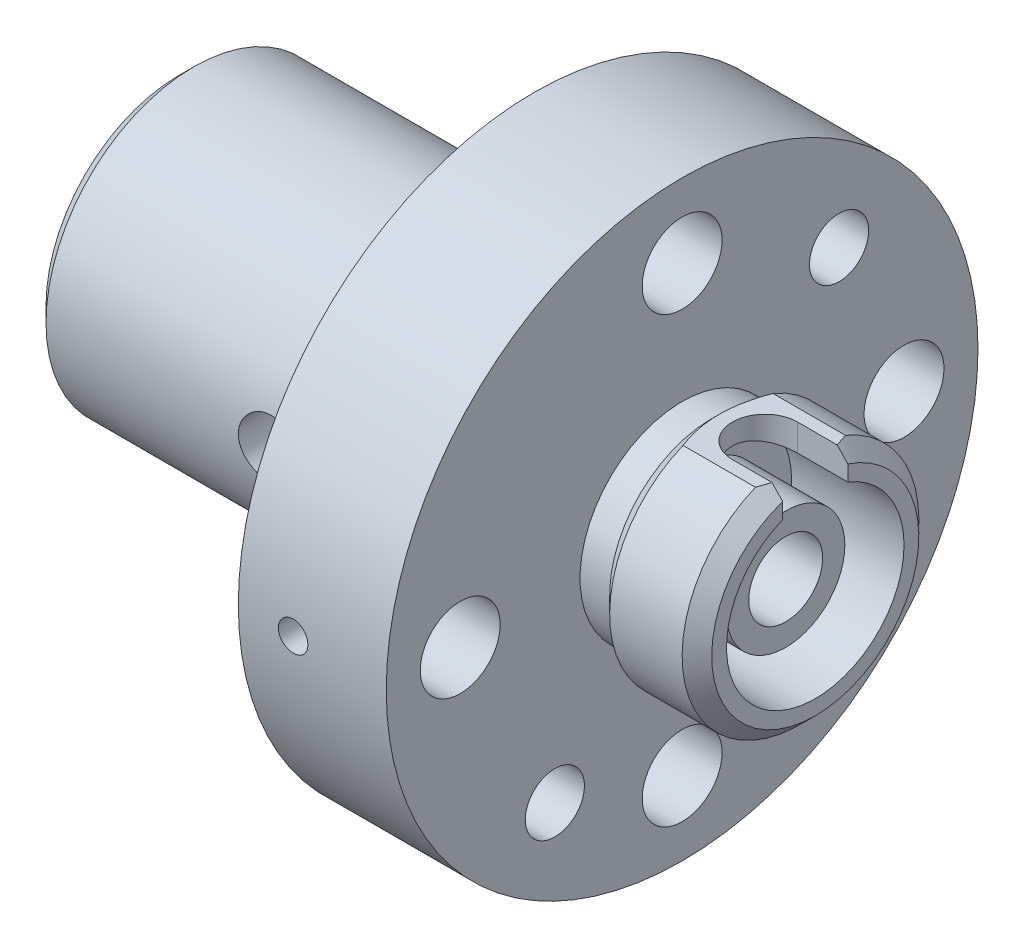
ISO-10303-21;
HEADER;
FILE_DESCRIPTION(('STEP AP214'),'2;1');
FILE_NAME('part.step','',(''),(''),'','','');
FILE_SCHEMA(('AUTOMOTIVE_DESIGN { 1 0 10303 214 1 1 1 1 }'));
ENDSEC;
DATA;
#1=APPLICATION_CONTEXT('core data for automotive mechanical design processes');
#2=APPLICATION_PROTOCOL_DEFINITION('international standard','automotive_design',2000,#1);
#3=PRODUCT_CONTEXT('',#1,'mechanical');
#4=PRODUCT('Part','Part','',(#3));
#5=PRODUCT_RELATED_PRODUCT_CATEGORY('part','',(#4));
#6=PRODUCT_DEFINITION_FORMATION('','',#4);
#7=PRODUCT_DEFINITION_CONTEXT('part definition',#1,'design');
#8=PRODUCT_DEFINITION('design','',#6,#7);
#9=PRODUCT_DEFINITION_SHAPE('','',#8);
#10=(LENGTH_UNIT() NAMED_UNIT(*) SI_UNIT(.MILLI.,.METRE.));
#11=(NAMED_UNIT(*) PLANE_ANGLE_UNIT() SI_UNIT($,.RADIAN.));
#12=(NAMED_UNIT(*) SI_UNIT($,.STERADIAN.) SOLID_ANGLE_UNIT());
#13=UNCERTAINTY_MEASURE_WITH_UNIT(LENGTH_MEASURE(1.E-05),#10,'distance_accuracy_value','');
#14=(GEOMETRIC_REPRESENTATION_CONTEXT(3) GLOBAL_UNCERTAINTY_ASSIGNED_CONTEXT((#13)) GLOBAL_UNIT_ASSIGNED_CONTEXT((#10,
#11,#12)) REPRESENTATION_CONTEXT('',''));
#15=CARTESIAN_POINT('',(0.,0.,0.));
#16=DIRECTION('',(0.,0.,1.));
#17=DIRECTION('',(1.,0.,0.));
#18=AXIS2_PLACEMENT_3D('',#15,#16,#17);
#19=CARTESIAN_POINT('',(-12.,4.99999999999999,0.));
#20=DIRECTION('',(-1.,0.,0.));
#21=DIRECTION('',(0.,0.,1.));
#22=AXIS2_PLACEMENT_3D('',#19,#20,#21);
#23=PLANE('',#22);
#24=CARTESIAN_POINT('',(-12.,0.,0.));
#25=DIRECTION('',(-1.,0.,0.));
#26=DIRECTION('',(0.,0.,1.));
#27=AXIS2_PLACEMENT_3D('',#24,#25,#26);
#28=CIRCLE('',#27,4.5);
#29=CARTESIAN_POINT('',(-12.,0.,4.50000000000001));
#30=VERTEX_POINT('',#29);
#31=EDGE_CURVE('E14',#30,#30,#28,.T.);
#32=ORIENTED_EDGE('',*,*,#31,.T.);
#33=EDGE_LOOP('',(#32));
#34=FACE_BOUND('',#33,.T.);
#35=CARTESIAN_POINT('',(-12.,0.,0.));
#36=DIRECTION('',(-1.,0.,0.));
#37=DIRECTION('',(0.,0.,1.));
#38=AXIS2_PLACEMENT_3D('',#35,#36,#37);
#39=CIRCLE('',#38,2.);
#40=CARTESIAN_POINT('',(-12.,0.,2.00000000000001));
#41=VERTEX_POINT('',#40);
#42=EDGE_CURVE('E344',#41,#41,#39,.T.);
#43=ORIENTED_EDGE('',*,*,#42,.F.);
#44=EDGE_LOOP('',(#43));
#45=FACE_BOUND('',#44,.T.);
#46=ADVANCED_FACE('F85',(#34,#45),#23,.T.);
#47=CARTESIAN_POINT('',(0.,0.,0.));
#48=DIRECTION('',(1.,0.,0.));
#49=DIRECTION('',(0.,0.,-1.));
#50=AXIS2_PLACEMENT_3D('',#47,#48,#49);
#51=CYLINDRICAL_SURFACE('',#50,1.25);
#52=CARTESIAN_POINT('',(1.35,0.,-1.25));
#53=CARTESIAN_POINT('',(1.35000246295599,-0.0268732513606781,-1.24999817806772));
#54=CARTESIAN_POINT('',(1.35217943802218,-0.0537931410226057,-1.24912323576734));
#55=CARTESIAN_POINT('',(1.36081192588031,-0.106874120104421,-1.2457086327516));
#56=CARTESIAN_POINT('',(1.36727906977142,-0.133032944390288,-1.24316444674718));
#57=CARTESIAN_POINT('',(1.38421901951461,-0.183738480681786,-1.2366855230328));
#58=CARTESIAN_POINT('',(1.39467871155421,-0.208290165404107,-1.2327553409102));
#59=CARTESIAN_POINT('',(1.41925479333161,-0.255267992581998,-1.22389152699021));
#60=CARTESIAN_POINT('',(1.43336991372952,-0.277694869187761,-1.21895824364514));
#61=CARTESIAN_POINT('',(1.46555887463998,-0.320875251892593,-1.20832721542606));
#62=CARTESIAN_POINT('',(1.48377666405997,-0.341515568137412,-1.20260574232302));
#63=CARTESIAN_POINT('',(1.52335000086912,-0.37954375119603,-1.19115144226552));
#64=CARTESIAN_POINT('',(1.54470707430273,-0.39693002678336,-1.18541861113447));
#65=CARTESIAN_POINT('',(1.59110701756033,-0.42871864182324,-1.17430697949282));
#66=CARTESIAN_POINT('',(1.61627162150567,-0.442953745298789,-1.16895528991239));
#67=CARTESIAN_POINT('',(1.66888409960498,-0.466938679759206,-1.15958411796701));
#68=CARTESIAN_POINT('',(1.69633088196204,-0.476690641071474,-1.15556400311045));
#69=CARTESIAN_POINT('',(1.75142808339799,-0.49097470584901,-1.14956589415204));
#70=CARTESIAN_POINT('',(1.77901280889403,-0.495723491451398,-1.14750355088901));
#71=CARTESIAN_POINT('',(1.83465874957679,-0.500543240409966,-1.14541001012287));
#72=CARTESIAN_POINT('',(1.86271972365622,-0.500616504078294,-1.14537781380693));
#73=CARTESIAN_POINT('',(1.91643916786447,-0.496247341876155,-1.14727625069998));
#74=CARTESIAN_POINT('',(1.94212892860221,-0.492118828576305,-1.14907043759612));
#75=CARTESIAN_POINT('',(1.99241488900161,-0.479986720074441,-1.15419046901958));
#76=CARTESIAN_POINT('',(2.01701089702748,-0.471982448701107,-1.15751658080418));
#77=CARTESIAN_POINT('',(2.06500445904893,-0.452173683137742,-1.16539871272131));
#78=CARTESIAN_POINT('',(2.08836730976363,-0.440294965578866,-1.16997844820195));
#79=CARTESIAN_POINT('',(2.13285395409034,-0.413126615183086,-1.17984529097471));
#80=CARTESIAN_POINT('',(2.15397690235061,-0.397835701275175,-1.18513266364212));
#81=CARTESIAN_POINT('',(2.19510243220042,-0.362887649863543,-1.19631684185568));
#82=CARTESIAN_POINT('',(2.21489218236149,-0.342984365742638,-1.20222916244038));
#83=CARTESIAN_POINT('',(2.25092111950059,-0.300078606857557,-1.2136495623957));
#84=CARTESIAN_POINT('',(2.26715959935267,-0.277075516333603,-1.2191575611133));
#85=CARTESIAN_POINT('',(2.29590436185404,-0.228019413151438,-1.22928670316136));
#86=CARTESIAN_POINT('',(2.30833057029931,-0.201915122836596,-1.23388817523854));
#87=CARTESIAN_POINT('',(2.32854196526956,-0.147755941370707,-1.2415370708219));
#88=CARTESIAN_POINT('',(2.33632950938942,-0.119702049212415,-1.24458528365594));
#89=CARTESIAN_POINT('',(2.34661207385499,-0.0642239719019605,-1.24864034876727));
#90=CARTESIAN_POINT('',(2.34939311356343,-0.0368608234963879,-1.2497573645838));
#91=CARTESIAN_POINT('',(2.35042827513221,0.0179613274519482,-1.25017119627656));
#92=CARTESIAN_POINT('',(2.34868357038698,0.0454203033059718,-1.24946848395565));
#93=CARTESIAN_POINT('',(2.34092706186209,0.0983581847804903,-1.24639391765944));
#94=CARTESIAN_POINT('',(2.33511050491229,0.123870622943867,-1.24409847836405));
#95=CARTESIAN_POINT('',(2.31964107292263,0.173533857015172,-1.23814860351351));
#96=CARTESIAN_POINT('',(2.30998770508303,0.19768447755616,-1.23449399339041));
#97=CARTESIAN_POINT('',(2.28680376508,0.244769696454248,-1.22604148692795));
#98=CARTESIAN_POINT('',(2.27316363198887,0.267644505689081,-1.22121203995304));
#99=CARTESIAN_POINT('',(2.24251491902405,0.310860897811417,-1.21093341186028));
#100=CARTESIAN_POINT('',(2.22550498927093,0.331201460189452,-1.20548398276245));
#101=CARTESIAN_POINT('',(2.18728249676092,0.370180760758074,-1.19411279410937));
#102=CARTESIAN_POINT('',(2.16586661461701,0.388618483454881,-1.18818360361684));
#103=CARTESIAN_POINT('',(2.12013997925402,0.421687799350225,-1.17685418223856));
#104=CARTESIAN_POINT('',(2.09582874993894,0.43631876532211,-1.17145403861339));
#105=CARTESIAN_POINT('',(2.04463457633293,0.461451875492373,-1.16178574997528));
#106=CARTESIAN_POINT('',(2.01772900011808,0.471912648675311,-1.15752907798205));
#107=CARTESIAN_POINT('',(1.96231658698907,0.488074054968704,-1.15080918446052));
#108=CARTESIAN_POINT('',(1.93381094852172,0.493778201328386,-1.14834463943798));
#109=CARTESIAN_POINT('',(1.87821802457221,0.499928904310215,-1.14567939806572));
#110=CARTESIAN_POINT('',(1.85117629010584,0.500724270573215,-1.14532855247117));
#111=CARTESIAN_POINT('',(1.79736378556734,0.497950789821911,-1.14653709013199));
#112=CARTESIAN_POINT('',(1.77059298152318,0.494382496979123,-1.14809623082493));
#113=CARTESIAN_POINT('',(1.71916695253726,0.48326784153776,-1.15281662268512));
#114=CARTESIAN_POINT('',(1.69446993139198,0.475884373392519,-1.15591207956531));
#115=CARTESIAN_POINT('',(1.6466553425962,0.457501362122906,-1.1633100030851));
#116=CARTESIAN_POINT('',(1.62353821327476,0.446500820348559,-1.16761280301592));
#117=CARTESIAN_POINT('',(1.57809759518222,0.420468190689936,-1.17724652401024));
#118=CARTESIAN_POINT('',(1.55589533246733,0.405241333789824,-1.18262220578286));
#119=CARTESIAN_POINT('',(1.51425167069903,0.371473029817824,-1.19365951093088));
#120=CARTESIAN_POINT('',(1.49481110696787,0.352930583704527,-1.19932122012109));
#121=CARTESIAN_POINT('',(1.45794928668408,0.311626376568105,-1.2107339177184));
#122=CARTESIAN_POINT('',(1.44074067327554,0.28866900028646,-1.21646689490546));
#123=CARTESIAN_POINT('',(1.41041573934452,0.239975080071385,-1.22700101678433));
#124=CARTESIAN_POINT('',(1.3973013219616,0.21423725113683,-1.23180172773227));
#125=CARTESIAN_POINT('',(1.3758444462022,0.161184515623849,-1.23984928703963));
#126=CARTESIAN_POINT('',(1.36741766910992,0.133907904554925,-1.24312340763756));
#127=CARTESIAN_POINT('',(1.35534021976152,0.0782191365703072,-1.24786076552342));
#128=CARTESIAN_POINT('',(1.35167439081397,0.0498108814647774,-1.24932974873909));
#129=CARTESIAN_POINT('',(1.35015115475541,0.0142280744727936,-1.24993974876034));
#130=CARTESIAN_POINT('',(1.34999934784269,0.0071156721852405,-1.25000048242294));
#131=CARTESIAN_POINT('',(1.35,0.,-1.25));
#132=B_SPLINE_CURVE_WITH_KNOTS('',3,(#52,#53,#54,#55,#56,#57,#58,#59,#60,#61,#62,#63,#64,#65,
#66,#67,#68,#69,#70,#71,#72,#73,#74,#75,#76,#77,#78,#79,#80,#81,#82,#83,#84,#85,#86,#87,#88,#89,
#90,#91,#92,#93,#94,#95,#96,#97,#98,#99,#100,#101,#102,#103,#104,#105,#106,#107,#108,#109,#110,
#111,#112,#113,#114,#115,#116,#117,#118,#119,#120,#121,#122,#123,#124,#125,#126,#127,#128,#129,
#130,#131),.UNSPECIFIED.,.T.,.F.,(4,2,2,2,2,2,2,2,2,2,2,2,2,2,2,2,2,2,2,2,2,2,2,2,2,2,2,2,2,2,2,
2,2,2,2,2,2,2,2,4),(0.,0.0806007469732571,0.161420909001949,0.241977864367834,0.32250688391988,
0.406493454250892,0.490520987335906,0.57828814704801,0.66601355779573,0.749760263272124,
0.833465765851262,0.91134582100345,0.989239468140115,1.06872281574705,1.14823605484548,
1.23389587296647,1.31957273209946,1.40694228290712,1.49426739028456,1.5764229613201,
1.65855723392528,1.73700113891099,1.81545512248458,1.89630878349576,1.97719489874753,
2.06342118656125,2.1496616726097,2.23673761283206,2.32374918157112,2.4044991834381,
2.48523893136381,2.5627857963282,2.64035408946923,2.72236367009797,2.80439800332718,
2.89175105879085,2.97914465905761,3.0649107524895,3.15040313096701,3.17174511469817),.UNSPECIFIED.);
#133=CARTESIAN_POINT('',(1.35,0.,-1.25));
#134=VERTEX_POINT('',#133);
#135=EDGE_CURVE('E206',#134,#134,#132,.T.);
#136=ORIENTED_EDGE('',*,*,#135,.F.);
#137=EDGE_LOOP('',(#136));
#138=FACE_BOUND('',#137,.T.);
#139=CARTESIAN_POINT('',(2.34999999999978,0.,1.25000000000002));
#140=CARTESIAN_POINT('',(2.34999753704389,-0.0268732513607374,1.24999817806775));
#141=CARTESIAN_POINT('',(2.34782056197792,-0.0537931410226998,1.24912323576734));
#142=CARTESIAN_POINT('',(2.33918807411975,-0.106874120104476,1.24570863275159));
#143=CARTESIAN_POINT('',(2.33272093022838,-0.133032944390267,1.24316444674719));
#144=CARTESIAN_POINT('',(2.31578098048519,-0.183738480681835,1.23668552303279));
#145=CARTESIAN_POINT('',(2.30532128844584,-0.208290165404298,1.23275534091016));
#146=CARTESIAN_POINT('',(2.28074520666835,-0.255267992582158,1.22389152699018));
#147=CARTESIAN_POINT('',(2.2666300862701,-0.277694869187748,1.21895824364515));
#148=CARTESIAN_POINT('',(2.23444112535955,-0.320875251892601,1.20832721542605));
#149=CARTESIAN_POINT('',(2.21622333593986,-0.341515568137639,1.20260574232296));
#150=CARTESIAN_POINT('',(2.17664999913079,-0.379543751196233,1.19115144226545));
#151=CARTESIAN_POINT('',(2.15529292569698,-0.396930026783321,1.18541861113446));
#152=CARTESIAN_POINT('',(2.10889298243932,-0.428718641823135,1.17430697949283));
#153=CARTESIAN_POINT('',(2.08372837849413,-0.44295374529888,1.16895528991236));
#154=CARTESIAN_POINT('',(2.03111590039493,-0.466938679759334,1.15958411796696));
#155=CARTESIAN_POINT('',(2.0036691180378,-0.476690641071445,1.15556400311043));
#156=CARTESIAN_POINT('',(1.94857191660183,-0.490974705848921,1.14956589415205));
#157=CARTESIAN_POINT('',(1.92098719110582,-0.495723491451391,1.14750355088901));
#158=CARTESIAN_POINT('',(1.86534125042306,-0.500543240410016,1.14541001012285));
#159=CARTESIAN_POINT('',(1.83728027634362,-0.500616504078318,1.14537781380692));
#160=CARTESIAN_POINT('',(1.7835608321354,-0.496247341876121,1.1472762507));
#161=CARTESIAN_POINT('',(1.75787107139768,-0.492118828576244,1.14907043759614));
#162=CARTESIAN_POINT('',(1.70758511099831,-0.479986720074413,1.1541904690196));
#163=CARTESIAN_POINT('',(1.68298910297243,-0.471982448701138,1.15751658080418));
#164=CARTESIAN_POINT('',(1.63499554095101,-0.45217368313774,1.16539871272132));
#165=CARTESIAN_POINT('',(1.61163269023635,-0.440294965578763,1.16997844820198));
#166=CARTESIAN_POINT('',(1.56714604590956,-0.413126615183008,1.17984529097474));
#167=CARTESIAN_POINT('',(1.54602309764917,-0.397835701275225,1.18513266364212));
#168=CARTESIAN_POINT('',(1.50489756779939,-0.362887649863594,1.19631684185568));
#169=CARTESIAN_POINT('',(1.48510781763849,-0.342984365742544,1.2022291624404));
#170=CARTESIAN_POINT('',(1.44907888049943,-0.300078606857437,1.21364956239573));
#171=CARTESIAN_POINT('',(1.4328404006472,-0.2770755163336,1.21915756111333));
#172=CARTESIAN_POINT('',(1.40409563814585,-0.228019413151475,1.22928670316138));
#173=CARTESIAN_POINT('',(1.39166942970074,-0.201915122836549,1.23388817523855));
#174=CARTESIAN_POINT('',(1.37145803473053,-0.147755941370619,1.2415370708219));
#175=CARTESIAN_POINT('',(1.36367049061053,-0.119702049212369,1.24458528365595));
#176=CARTESIAN_POINT('',(1.35338792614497,-0.0642239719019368,1.24864034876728));
#177=CARTESIAN_POINT('',(1.35060688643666,-0.036860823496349,1.2497573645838));
#178=CARTESIAN_POINT('',(1.34957172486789,0.0179613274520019,1.25017119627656));
#179=CARTESIAN_POINT('',(1.35131642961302,0.0454203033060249,1.24946848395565));
#180=CARTESIAN_POINT('',(1.3590729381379,0.0983581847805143,1.24639391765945));
#181=CARTESIAN_POINT('',(1.36488949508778,0.123870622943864,1.24409847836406));
#182=CARTESIAN_POINT('',(1.38035892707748,0.173533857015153,1.2381486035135));
#183=CARTESIAN_POINT('',(1.39001229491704,0.197684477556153,1.2344939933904));
#184=CARTESIAN_POINT('',(1.41319623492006,0.244769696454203,1.22604148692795));
#185=CARTESIAN_POINT('',(1.42683636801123,0.267644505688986,1.22121203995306));
#186=CARTESIAN_POINT('',(1.45748508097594,0.310860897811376,1.21093341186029));
#187=CARTESIAN_POINT('',(1.4744950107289,0.331201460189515,1.20548398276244));
#188=CARTESIAN_POINT('',(1.51271750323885,0.370180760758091,1.19411279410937));
#189=CARTESIAN_POINT('',(1.53413338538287,0.388618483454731,1.18818360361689));
#190=CARTESIAN_POINT('',(1.57986002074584,0.421687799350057,1.17685418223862));
#191=CARTESIAN_POINT('',(1.60417125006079,0.436318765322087,1.17145403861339));
#192=CARTESIAN_POINT('',(1.65536542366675,0.461451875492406,1.16178574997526));
#193=CARTESIAN_POINT('',(1.68227099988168,0.471912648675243,1.15752907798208));
#194=CARTESIAN_POINT('',(1.73768341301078,0.488074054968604,1.15080918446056));
#195=CARTESIAN_POINT('',(1.76618905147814,0.493778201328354,1.148344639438));
#196=CARTESIAN_POINT('',(1.82178197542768,0.499928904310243,1.14567939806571));
#197=CARTESIAN_POINT('',(1.84882370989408,0.500724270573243,1.14532855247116));
#198=CARTESIAN_POINT('',(1.9026362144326,0.4979507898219,1.146537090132));
#199=CARTESIAN_POINT('',(1.92940701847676,0.494382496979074,1.14809623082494));
#200=CARTESIAN_POINT('',(1.98083304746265,0.48326784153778,1.15281662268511));
#201=CARTESIAN_POINT('',(2.00553006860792,0.475884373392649,1.15591207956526));
#202=CARTESIAN_POINT('',(2.05334465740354,0.457501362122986,1.16331000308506));
#203=CARTESIAN_POINT('',(2.07646178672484,0.446500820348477,1.16761280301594));
#204=CARTESIAN_POINT('',(2.12190240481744,0.420468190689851,1.17724652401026));
#205=CARTESIAN_POINT('',(2.14410466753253,0.405241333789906,1.18262220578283));
#206=CARTESIAN_POINT('',(2.18574832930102,0.371473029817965,1.19365951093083));
#207=CARTESIAN_POINT('',(2.20518889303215,0.352930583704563,1.19932122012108));
#208=CARTESIAN_POINT('',(2.24205071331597,0.311626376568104,1.21073391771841));
#209=CARTESIAN_POINT('',(2.2592593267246,0.288669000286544,1.21646689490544));
#210=CARTESIAN_POINT('',(2.28958426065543,0.239975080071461,1.22700101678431));
#211=CARTESIAN_POINT('',(2.30269867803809,0.214237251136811,1.23180172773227));
#212=CARTESIAN_POINT('',(2.32415555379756,0.161184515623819,1.23984928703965));
#213=CARTESIAN_POINT('',(2.33258233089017,0.133907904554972,1.24312340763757));
#214=CARTESIAN_POINT('',(2.34465978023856,0.0782191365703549,1.2478607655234));
#215=CARTESIAN_POINT('',(2.34832560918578,0.04981088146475,1.24932974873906));
#216=CARTESIAN_POINT('',(2.34984884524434,0.0142280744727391,1.24993974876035));
#217=CARTESIAN_POINT('',(2.35000065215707,0.00711567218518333,1.25000048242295));
#218=CARTESIAN_POINT('',(2.34999999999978,0.,1.25000000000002));
#219=B_SPLINE_CURVE_WITH_KNOTS('',3,(#139,#140,#141,#142,#143,#144,#145,#146,#147,#148,#149,
#150,#151,#152,#153,#154,#155,#156,#157,#158,#159,#160,#161,#162,#163,#164,#165,#166,#167,#168,
#169,#170,#171,#172,#173,#174,#175,#176,#177,#178,#179,#180,#181,#182,#183,#184,#185,#186,#187,
#188,#189,#190,#191,#192,#193,#194,#195,#196,#197,#198,#199,#200,#201,#202,#203,#204,#205,#206,
#207,#208,#209,#210,#211,#212,#213,#214,#215,#216,#217,#218),.UNSPECIFIED.,.T.,.F.,(4,2,2,2,2,2,
2,2,2,2,2,2,2,2,2,2,2,2,2,2,2,2,2,2,2,2,2,2,2,2,2,2,2,2,2,2,2,2,2,4),(0.,0.0806007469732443,
0.161420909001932,0.241977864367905,0.322506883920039,0.406493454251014,0.490520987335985,
0.57828814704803,0.666013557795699,0.749760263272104,0.833465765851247,0.911345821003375,
0.98923946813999,1.06872281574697,1.14823605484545,1.2338958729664,1.31957273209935,
1.406942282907,1.49426739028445,1.57642296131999,1.65855723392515,1.73700113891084,
1.81545512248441,1.89630878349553,1.97719489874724,2.06342118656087,2.14966167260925,
2.23673761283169,2.32374918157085,2.40449918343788,2.48523893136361,2.56278579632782,
2.64035408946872,2.72236367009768,2.80439800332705,2.89175105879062,2.97914465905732,
3.06491075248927,3.15040313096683,3.171745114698),.UNSPECIFIED.);
#220=CARTESIAN_POINT('',(2.34999999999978,0.,1.25000000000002));
#221=VERTEX_POINT('',#220);
#222=EDGE_CURVE('E252',#221,#221,#219,.T.);
#223=ORIENTED_EDGE('',*,*,#222,.F.);
#224=EDGE_LOOP('',(#223));
#225=FACE_BOUND('',#224,.T.);
#226=CARTESIAN_POINT('',(-5.00000000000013,0.,-1.25000000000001));
#227=CARTESIAN_POINT('',(-4.99999625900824,-0.047998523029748,-1.24999636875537));
#228=CARTESIAN_POINT('',(-4.99651529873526,-0.0960666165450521,-1.24720685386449));
#229=CARTESIAN_POINT('',(-4.98282501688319,-0.190659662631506,-1.23629633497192));
#230=CARTESIAN_POINT('',(-4.97260081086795,-0.237180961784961,-1.22816353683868));
#231=CARTESIAN_POINT('',(-4.94616086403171,-0.327047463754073,-1.20733361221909));
#232=CARTESIAN_POINT('',(-4.92998332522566,-0.370410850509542,-1.19466560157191));
#233=CARTESIAN_POINT('',(-4.89244132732,-0.453463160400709,-1.16568005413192));
#234=CARTESIAN_POINT('',(-4.87107685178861,-0.493152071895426,-1.14936250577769));
#235=CARTESIAN_POINT('',(-4.81568581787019,-0.58159061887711,-1.10787832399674));
#236=CARTESIAN_POINT('',(-4.77984054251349,-0.628683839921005,-1.08160874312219));
#237=CARTESIAN_POINT('',(-4.70136096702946,-0.715206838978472,-1.02646096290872));
#238=CARTESIAN_POINT('',(-4.65870712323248,-0.754613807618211,-0.997575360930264));
#239=CARTESIAN_POINT('',(-4.56661300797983,-0.826079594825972,-0.939280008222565));
#240=CARTESIAN_POINT('',(-4.51707661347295,-0.85801319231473,-0.909869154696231));
#241=CARTESIAN_POINT('',(-4.4117306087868,-0.913234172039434,-0.854410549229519));
#242=CARTESIAN_POINT('',(-4.3559428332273,-0.936550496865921,-0.828351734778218));
#243=CARTESIAN_POINT('',(-4.26306052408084,-0.965430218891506,-0.794178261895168));
#244=CARTESIAN_POINT('',(-4.22809413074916,-0.974327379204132,-0.783143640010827));
#245=CARTESIAN_POINT('',(-4.15639365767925,-0.988366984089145,-0.765349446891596));
#246=CARTESIAN_POINT('',(-4.1196641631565,-0.993518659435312,-0.758579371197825));
#247=CARTESIAN_POINT('',(-4.04490374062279,-0.999699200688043,-0.750421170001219));
#248=CARTESIAN_POINT('',(-4.00686425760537,-1.00069172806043,-0.749080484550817));
#249=CARTESIAN_POINT('',(-3.93114755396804,-0.998347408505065,-0.7521998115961));
#250=CARTESIAN_POINT('',(-3.89347066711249,-0.995006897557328,-0.756664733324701));
#251=CARTESIAN_POINT('',(-3.813888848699,-0.983476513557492,-0.771603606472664));
#252=CARTESIAN_POINT('',(-3.77224599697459,-0.974609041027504,-0.782909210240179));
#253=CARTESIAN_POINT('',(-3.69173222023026,-0.952222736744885,-0.809987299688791));
#254=CARTESIAN_POINT('',(-3.65286992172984,-0.938690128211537,-0.825772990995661));
#255=CARTESIAN_POINT('',(-3.55966894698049,-0.899870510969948,-0.868280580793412));
#256=CARTESIAN_POINT('',(-3.50709865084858,-0.872074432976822,-0.896566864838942));
#257=CARTESIAN_POINT('',(-3.40814166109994,-0.808192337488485,-0.954568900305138));
#258=CARTESIAN_POINT('',(-3.36176413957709,-0.772094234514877,-0.984286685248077));
#259=CARTESIAN_POINT('',(-3.27436261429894,-0.690729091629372,-1.04306375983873));
#260=CARTESIAN_POINT('',(-3.23351403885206,-0.645243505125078,-1.07208444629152));
#261=CARTESIAN_POINT('',(-3.15995025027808,-0.545992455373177,-1.12585935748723));
#262=CARTESIAN_POINT('',(-3.12721324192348,-0.492249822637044,-1.15062495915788));
#263=CARTESIAN_POINT('',(-3.07971857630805,-0.393888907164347,-1.18712292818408));
#264=CARTESIAN_POINT('',(-3.06249774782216,-0.351088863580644,-1.20055535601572));
#265=CARTESIAN_POINT('',(-3.03393677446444,-0.262456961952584,-1.2229878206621));
#266=CARTESIAN_POINT('',(-3.02259219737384,-0.21662741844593,-1.23199119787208));
#267=CARTESIAN_POINT('',(-3.00643072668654,-0.12285661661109,-1.24485167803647));
#268=CARTESIAN_POINT('',(-3.00164793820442,-0.0749056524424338,-1.24868189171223));
#269=CARTESIAN_POINT('',(-2.9990704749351,0.0213040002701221,-1.25074341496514));
#270=CARTESIAN_POINT('',(-3.00127449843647,0.0695626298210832,-1.24897576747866));
#271=CARTESIAN_POINT('',(-3.01204141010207,0.160873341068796,-1.24038428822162));
#272=CARTESIAN_POINT('',(-3.02007459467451,0.204030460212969,-1.23398174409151));
#273=CARTESIAN_POINT('',(-3.04143608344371,0.288167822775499,-1.21708758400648));
#274=CARTESIAN_POINT('',(-3.05476595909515,0.329147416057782,-1.20659475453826));
#275=CARTESIAN_POINT('',(-3.08707521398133,0.410617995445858,-1.18144917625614));
#276=CARTESIAN_POINT('',(-3.10635300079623,0.450922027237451,-1.16657929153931));
#277=CARTESIAN_POINT('',(-3.14943096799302,0.527704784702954,-1.13391838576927));
#278=CARTESIAN_POINT('',(-3.17323137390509,0.564183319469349,-1.11612721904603));
#279=CARTESIAN_POINT('',(-3.229612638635,0.639627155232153,-1.07496722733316));
#280=CARTESIAN_POINT('',(-3.26300279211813,0.677757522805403,-1.05117993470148));
#281=CARTESIAN_POINT('',(-3.33469152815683,0.74826449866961,-1.0022224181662));
#282=CARTESIAN_POINT('',(-3.37300407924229,0.780624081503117,-0.977048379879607));
#283=CARTESIAN_POINT('',(-3.4628258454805,0.845668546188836,-0.921697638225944));
#284=CARTESIAN_POINT('',(-3.51540661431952,0.876949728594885,-0.891599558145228));
#285=CARTESIAN_POINT('',(-3.62736877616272,0.930027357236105,-0.836067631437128));
#286=CARTESIAN_POINT('',(-3.68671910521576,0.951865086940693,-0.810613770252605));
#287=CARTESIAN_POINT('',(-3.78305343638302,0.976802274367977,-0.7800995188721));
#288=CARTESIAN_POINT('',(-3.8177140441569,0.983898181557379,-0.771049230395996));
#289=CARTESIAN_POINT('',(-3.88841610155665,0.994394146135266,-0.757466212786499));
#290=CARTESIAN_POINT('',(-3.92445382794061,0.997803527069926,-0.752922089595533));
#291=CARTESIAN_POINT('',(-3.9971751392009,1.00066038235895,-0.749123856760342));
#292=CARTESIAN_POINT('',(-4.03386114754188,1.000086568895,-0.749898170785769));
#293=CARTESIAN_POINT('',(-4.10649167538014,0.994982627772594,-0.756653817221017));
#294=CARTESIAN_POINT('',(-4.14243492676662,0.990446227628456,-0.762643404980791));
#295=CARTESIAN_POINT('',(-4.222304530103,0.976038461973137,-0.781035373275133));
#296=CARTESIAN_POINT('',(-4.26571605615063,0.965044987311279,-0.794746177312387));
#297=CARTESIAN_POINT('',(-4.3493122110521,0.93804205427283,-0.826444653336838));
#298=CARTESIAN_POINT('',(-4.38948688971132,0.922017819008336,-0.844444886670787));
#299=CARTESIAN_POINT('',(-4.48411204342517,0.877205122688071,-0.891336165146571));
#300=CARTESIAN_POINT('',(-4.53676742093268,0.845924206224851,-0.921462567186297));
#301=CARTESIAN_POINT('',(-4.63542343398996,0.774559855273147,-0.982226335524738));
#302=CARTESIAN_POINT('',(-4.68141642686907,0.734466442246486,-1.01286424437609));
#303=CARTESIAN_POINT('',(-4.76667742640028,0.645035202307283,-1.07207599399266));
#304=CARTESIAN_POINT('',(-4.80585005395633,0.595583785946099,-1.10061775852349));
#305=CARTESIAN_POINT('',(-4.87505060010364,0.488193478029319,-1.15225307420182));
#306=CARTESIAN_POINT('',(-4.90510548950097,0.430280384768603,-1.17536264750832));
#307=CARTESIAN_POINT('',(-4.94590127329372,0.327501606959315,-1.20711468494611));
#308=CARTESIAN_POINT('',(-4.95974425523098,0.284550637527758,-1.21801710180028));
#309=CARTESIAN_POINT('',(-4.98157592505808,0.196361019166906,-1.23529169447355));
#310=CARTESIAN_POINT('',(-4.98957994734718,0.151128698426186,-1.24167573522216));
#311=CARTESIAN_POINT('',(-4.99628168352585,0.0879402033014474,-1.24702704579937));
#312=CARTESIAN_POINT('',(-4.99767373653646,0.0704042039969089,-1.24813963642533));
#313=CARTESIAN_POINT('',(-4.99953368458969,0.0352486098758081,-1.24962686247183));
#314=CARTESIAN_POINT('',(-5.00000137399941,0.017628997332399,-1.25000133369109));
#315=CARTESIAN_POINT('',(-5.00000000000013,0.,-1.25000000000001));
#316=B_SPLINE_CURVE_WITH_KNOTS('',3,(#226,#227,#228,#229,#230,#231,#232,#233,#234,#235,#236,
#237,#238,#239,#240,#241,#242,#243,#244,#245,#246,#247,#248,#249,#250,#251,#252,#253,#254,#255,
#256,#257,#258,#259,#260,#261,#262,#263,#264,#265,#266,#267,#268,#269,#270,#271,#272,#273,#274,
#275,#276,#277,#278,#279,#280,#281,#282,#283,#284,#285,#286,#287,#288,#289,#290,#291,#292,#293,
#294,#295,#296,#297,#298,#299,#300,#301,#302,#303,#304,#305,#306,#307,#308,#309,#310,#311,#312,
#313,#314,#315),.UNSPECIFIED.,.T.,.F.,(4,2,2,2,2,2,2,2,2,2,2,2,2,2,2,2,2,2,2,2,2,2,2,2,2,2,2,2,
2,2,2,2,2,2,2,2,2,2,2,2,2,2,2,2,4),(0.,0.143918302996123,0.288155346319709,0.431482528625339,
0.574810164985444,0.768039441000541,0.961833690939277,1.15867370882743,1.35484646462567,
1.46767243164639,1.58021938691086,1.69374764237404,1.8073719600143,1.93879315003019,
2.07060581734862,2.26712874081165,2.46393957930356,2.66599086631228,2.86749322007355,
3.01106989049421,3.15453810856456,3.29874921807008,3.44293346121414,3.57543502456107,
3.70797592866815,3.8487137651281,3.989458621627,4.1568276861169,4.32468264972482,
4.52835135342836,4.73112045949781,4.84028105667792,4.94916492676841,5.05863116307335,
5.16827099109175,5.30798691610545,5.44811713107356,5.6518390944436,5.85579293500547,
6.06240284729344,6.26839549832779,6.40712300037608,6.54548484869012,6.59833170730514,
6.65119032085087),.UNSPECIFIED.);
#317=CARTESIAN_POINT('',(-5.00000000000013,0.,-1.25000000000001));
#318=VERTEX_POINT('',#317);
#319=EDGE_CURVE('E235',#318,#318,#316,.T.);
#320=ORIENTED_EDGE('',*,*,#319,.F.);
#321=EDGE_LOOP('',(#320));
#322=FACE_BOUND('',#321,.T.);
#323=CARTESIAN_POINT('',(-3.00000000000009,0.,1.25000000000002));
#324=CARTESIAN_POINT('',(-3.00000374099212,-0.0479985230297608,1.24999636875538));
#325=CARTESIAN_POINT('',(-3.00348470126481,-0.0960666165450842,1.24720685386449));
#326=CARTESIAN_POINT('',(-3.01717498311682,-0.190659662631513,1.23629633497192));
#327=CARTESIAN_POINT('',(-3.0273991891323,-0.237180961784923,1.22816353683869));
#328=CARTESIAN_POINT('',(-3.05383913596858,-0.327047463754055,1.2073336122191));
#329=CARTESIAN_POINT('',(-3.07001667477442,-0.370410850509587,1.1946656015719));
#330=CARTESIAN_POINT('',(-3.10755867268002,-0.453463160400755,1.1656800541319));
#331=CARTESIAN_POINT('',(-3.12892314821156,-0.493152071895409,1.14936250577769));
#332=CARTESIAN_POINT('',(-3.18431418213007,-0.581590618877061,1.10787832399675));
#333=CARTESIAN_POINT('',(-3.22015945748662,-0.62868383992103,1.08160874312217));
#334=CARTESIAN_POINT('',(-3.29863903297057,-0.71520683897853,1.02646096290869));
#335=CARTESIAN_POINT('',(-3.3412928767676,-0.75461380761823,0.997575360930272));
#336=CARTESIAN_POINT('',(-3.43338699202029,-0.826079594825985,0.939280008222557));
#337=CARTESIAN_POINT('',(-3.48292338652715,-0.858013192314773,0.909869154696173));
#338=CARTESIAN_POINT('',(-3.58826939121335,-0.913234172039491,0.854410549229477));
#339=CARTESIAN_POINT('',(-3.64405716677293,-0.93655049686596,0.828351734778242));
#340=CARTESIAN_POINT('',(-3.73693947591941,-0.965430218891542,0.794178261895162));
#341=CARTESIAN_POINT('',(-3.77190586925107,-0.974327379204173,0.783143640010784));
#342=CARTESIAN_POINT('',(-3.84360634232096,-0.988366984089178,0.765349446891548));
#343=CARTESIAN_POINT('',(-3.88033583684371,-0.993518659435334,0.75857937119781));
#344=CARTESIAN_POINT('',(-3.95509625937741,-0.999699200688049,0.750421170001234));
#345=CARTESIAN_POINT('',(-3.99313574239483,-1.00069172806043,0.749080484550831));
#346=CARTESIAN_POINT('',(-4.06885244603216,-0.998347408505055,0.752199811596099));
#347=CARTESIAN_POINT('',(-4.10652933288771,-0.995006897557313,0.756664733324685));
#348=CARTESIAN_POINT('',(-4.18611115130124,-0.983476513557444,0.771603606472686));
#349=CARTESIAN_POINT('',(-4.22775400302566,-0.974609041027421,0.782909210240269));
#350=CARTESIAN_POINT('',(-4.30826777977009,-0.95222273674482,0.80998729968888));
#351=CARTESIAN_POINT('',(-4.34713007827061,-0.938690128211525,0.82577299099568));
#352=CARTESIAN_POINT('',(-4.44033105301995,-0.899870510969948,0.868280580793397));
#353=CARTESIAN_POINT('',(-4.4929013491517,-0.872074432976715,0.896566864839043));
#354=CARTESIAN_POINT('',(-4.59185833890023,-0.808192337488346,0.954568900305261));
#355=CARTESIAN_POINT('',(-4.63823586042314,-0.772094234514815,0.984286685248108));
#356=CARTESIAN_POINT('',(-4.72563738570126,-0.690729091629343,1.04306375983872));
#357=CARTESIAN_POINT('',(-4.76648596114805,-0.645243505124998,1.07208444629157));
#358=CARTESIAN_POINT('',(-4.84004974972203,-0.545992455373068,1.12585935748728));
#359=CARTESIAN_POINT('',(-4.87278675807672,-0.492249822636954,1.15062495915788));
#360=CARTESIAN_POINT('',(-4.92028142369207,-0.393888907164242,1.18712292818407));
#361=CARTESIAN_POINT('',(-4.93750225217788,-0.351088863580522,1.20055535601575));
#362=CARTESIAN_POINT('',(-4.96606322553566,-0.262456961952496,1.22298782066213));
#363=CARTESIAN_POINT('',(-4.97740780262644,-0.216627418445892,1.23199119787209));
#364=CARTESIAN_POINT('',(-4.99356927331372,-0.1228566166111,1.24485167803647));
#365=CARTESIAN_POINT('',(-4.99835206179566,-0.0749056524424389,1.24868189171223));
#366=CARTESIAN_POINT('',(-5.00092952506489,0.0213040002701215,1.25074341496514));
#367=CARTESIAN_POINT('',(-4.99872550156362,0.0695626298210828,1.24897576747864));
#368=CARTESIAN_POINT('',(-4.98795858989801,0.160873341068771,1.24038428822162));
#369=CARTESIAN_POINT('',(-4.97992540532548,0.204030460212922,1.23398174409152));
#370=CARTESIAN_POINT('',(-4.95856391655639,0.28816782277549,1.21708758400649));
#371=CARTESIAN_POINT('',(-4.94523404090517,0.329147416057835,1.20659475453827));
#372=CARTESIAN_POINT('',(-4.912924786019,0.410617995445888,1.18144917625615));
#373=CARTESIAN_POINT('',(-4.89364699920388,0.450922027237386,1.16657929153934));
#374=CARTESIAN_POINT('',(-4.85056903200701,0.527704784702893,1.13391838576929));
#375=CARTESIAN_POINT('',(-4.8267686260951,0.564183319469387,1.11612721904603));
#376=CARTESIAN_POINT('',(-4.77038736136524,0.639627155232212,1.07496722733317));
#377=CARTESIAN_POINT('',(-4.73699720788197,0.677757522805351,1.05117993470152));
#378=CARTESIAN_POINT('',(-4.66530847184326,0.748264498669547,1.00222241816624));
#379=CARTESIAN_POINT('',(-4.62699592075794,0.780624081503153,0.977048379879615));
#380=CARTESIAN_POINT('',(-4.53717415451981,0.845668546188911,0.921697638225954));
#381=CARTESIAN_POINT('',(-4.48459338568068,0.876949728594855,0.891599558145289));
#382=CARTESIAN_POINT('',(-4.37263122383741,0.930027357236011,0.836067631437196));
#383=CARTESIAN_POINT('',(-4.3132808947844,0.951865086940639,0.810613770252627));
#384=CARTESIAN_POINT('',(-4.21694656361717,0.976802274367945,0.780099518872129));
#385=CARTESIAN_POINT('',(-4.18228595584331,0.983898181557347,0.771049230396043));
#386=CARTESIAN_POINT('',(-4.11158389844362,0.994394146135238,0.75746621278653));
#387=CARTESIAN_POINT('',(-4.07554617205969,0.997803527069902,0.75292208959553));
#388=CARTESIAN_POINT('',(-4.00282486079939,1.00066038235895,0.749123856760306));
#389=CARTESIAN_POINT('',(-3.96613885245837,1.00008656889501,0.749898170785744));
#390=CARTESIAN_POINT('',(-3.89350832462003,0.99498262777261,0.75665381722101));
#391=CARTESIAN_POINT('',(-3.85756507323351,0.990446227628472,0.762643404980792));
#392=CARTESIAN_POINT('',(-3.77769546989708,0.976038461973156,0.781035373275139));
#393=CARTESIAN_POINT('',(-3.73428394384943,0.965044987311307,0.794746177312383));
#394=CARTESIAN_POINT('',(-3.65068778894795,0.938042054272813,0.826444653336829));
#395=CARTESIAN_POINT('',(-3.61051311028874,0.922017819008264,0.844444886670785));
#396=CARTESIAN_POINT('',(-3.51588795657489,0.877205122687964,0.891336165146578));
#397=CARTESIAN_POINT('',(-3.46323257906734,0.845924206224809,0.921462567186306));
#398=CARTESIAN_POINT('',(-3.36457656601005,0.774559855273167,0.982226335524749));
#399=CARTESIAN_POINT('',(-3.31858357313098,0.734466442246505,1.0128642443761));
#400=CARTESIAN_POINT('',(-3.23332257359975,0.645035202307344,1.07207599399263));
#401=CARTESIAN_POINT('',(-3.19414994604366,0.595583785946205,1.10061775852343));
#402=CARTESIAN_POINT('',(-3.12494939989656,0.488193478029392,1.15225307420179));
#403=CARTESIAN_POINT('',(-3.09489451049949,0.430280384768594,1.17536264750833));
#404=CARTESIAN_POINT('',(-3.05409872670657,0.327501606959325,1.20711468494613));
#405=CARTESIAN_POINT('',(-3.04025574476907,0.284550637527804,1.21801710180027));
#406=CARTESIAN_POINT('',(-3.01842407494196,0.196361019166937,1.23529169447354));
#407=CARTESIAN_POINT('',(-3.01042005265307,0.151128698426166,1.24167573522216));
#408=CARTESIAN_POINT('',(-3.00371831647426,0.0879402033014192,1.24702704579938));
#409=CARTESIAN_POINT('',(-3.00232626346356,0.0704042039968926,1.24813963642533));
#410=CARTESIAN_POINT('',(-3.00046631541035,0.0352486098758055,1.24962686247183));
#411=CARTESIAN_POINT('',(-2.99999862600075,0.0176289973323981,1.25000133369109));
#412=CARTESIAN_POINT('',(-3.00000000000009,0.,1.25000000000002));
#413=B_SPLINE_CURVE_WITH_KNOTS('',3,(#323,#324,#325,#326,#327,#328,#329,#330,#331,#332,#333,
#334,#335,#336,#337,#338,#339,#340,#341,#342,#343,#344,#345,#346,#347,#348,#349,#350,#351,#352,
#353,#354,#355,#356,#357,#358,#359,#360,#361,#362,#363,#364,#365,#366,#367,#368,#369,#370,#371,
#372,#373,#374,#375,#376,#377,#378,#379,#380,#381,#382,#383,#384,#385,#386,#387,#388,#389,#390,
#391,#392,#393,#394,#395,#396,#397,#398,#399,#400,#401,#402,#403,#404,#405,#406,#407,#408,#409,
#410,#411,#412),.UNSPECIFIED.,.T.,.F.,(4,2,2,2,2,2,2,2,2,2,2,2,2,2,2,2,2,2,2,2,2,2,2,2,2,2,2,2,
2,2,2,2,2,2,2,2,2,2,2,2,2,2,2,2,4),(0.,0.143918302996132,0.288155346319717,0.431482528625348,
0.574810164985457,0.768039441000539,0.96183369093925,1.15867370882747,1.3548464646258,
1.46767243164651,1.58021938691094,1.69374764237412,1.80737196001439,1.93879315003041,
2.07060581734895,2.26712874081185,2.46393957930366,2.66599086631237,2.86749322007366,
3.0110698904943,3.15453810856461,3.29874921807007,3.44293346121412,3.57543502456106,
3.7079759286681,3.84871376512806,3.989458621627,4.15682768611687,4.32468264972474,
4.52835135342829,4.73112045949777,4.84028105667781,4.94916492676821,5.05863116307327,
5.16827099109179,5.30798691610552,5.44811713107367,5.65183909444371,5.85579293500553,
6.0624028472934,6.26839549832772,6.40712300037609,6.54548484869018,6.59833170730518,
6.6511903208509),.UNSPECIFIED.);
#414=CARTESIAN_POINT('',(-3.00000000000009,0.,1.25000000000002));
#415=VERTEX_POINT('',#414);
#416=EDGE_CURVE('E229',#415,#415,#413,.T.);
#417=ORIENTED_EDGE('',*,*,#416,.F.);
#418=EDGE_LOOP('',(#417));
#419=FACE_BOUND('',#418,.T.);
#420=CARTESIAN_POINT('',(8.49999999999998,0.,0.));
#421=DIRECTION('',(1.,0.,0.));
#422=DIRECTION('',(0.,0.,-1.));
#423=AXIS2_PLACEMENT_3D('',#420,#421,#422);
#424=CIRCLE('',#423,1.25);
#425=CARTESIAN_POINT('',(8.49999999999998,0.,-1.24999999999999));
#426=VERTEX_POINT('',#425);
#427=EDGE_CURVE('E190',#426,#426,#424,.T.);
#428=ORIENTED_EDGE('',*,*,#427,.T.);
#429=EDGE_LOOP('',(#428));
#430=FACE_BOUND('',#429,.T.);
#431=CARTESIAN_POINT('',(-8.00000000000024,0.,0.));
#432=DIRECTION('',(-1.,0.,0.));
#433=DIRECTION('',(0.,0.,1.));
#434=AXIS2_PLACEMENT_3D('',#431,#432,#433);
#435=CIRCLE('',#434,1.25);
#436=CARTESIAN_POINT('',(-8.00000000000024,0.,1.25));
#437=VERTEX_POINT('',#436);
#438=EDGE_CURVE('E193',#437,#437,#435,.T.);
#439=ORIENTED_EDGE('',*,*,#438,.T.);
#440=EDGE_LOOP('',(#439));
#441=FACE_BOUND('',#440,.T.);
#442=ADVANCED_FACE('F242',(#138,#225,#322,#419,#430,#441),#51,.F.);
#443=CARTESIAN_POINT('',(8.49999999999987,1.25000000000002,0.));
#444=DIRECTION('',(1.,0.,0.));
#445=DIRECTION('',(0.,0.,-1.));
#446=AXIS2_PLACEMENT_3D('',#443,#444,#445);
#447=PLANE('',#446);
#448=CARTESIAN_POINT('',(8.49999999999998,0.,0.));
#449=DIRECTION('',(1.,0.,0.));
#450=DIRECTION('',(0.,0.,-1.));
#451=AXIS2_PLACEMENT_3D('',#448,#449,#450);
#452=CIRCLE('',#451,2.);
#453=CARTESIAN_POINT('',(8.49999999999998,0.,-2.));
#454=VERTEX_POINT('',#453);
#455=EDGE_CURVE('E187',#454,#454,#452,.T.);
#456=ORIENTED_EDGE('',*,*,#455,.T.);
#457=EDGE_LOOP('',(#456));
#458=FACE_BOUND('',#457,.T.);
#459=ORIENTED_EDGE('',*,*,#427,.F.);
#460=EDGE_LOOP('',(#459));
#461=FACE_BOUND('',#460,.T.);
#462=ADVANCED_FACE('F246',(#458,#461),#447,.T.);
#463=CARTESIAN_POINT('',(0.,0.,0.));
#464=DIRECTION('',(1.,0.,0.));
#465=DIRECTION('',(0.,0.,-1.));
#466=AXIS2_PLACEMENT_3D('',#463,#464,#465);
#467=CYLINDRICAL_SURFACE('',#466,2.);
#468=CARTESIAN_POINT('',(5.69999999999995,0.,0.));
#469=DIRECTION('',(1.,0.,0.));
#470=DIRECTION('',(0.,0.,-1.));
#471=AXIS2_PLACEMENT_3D('',#468,#469,#470);
#472=CIRCLE('',#471,2.);
#473=CARTESIAN_POINT('',(5.69999999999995,0.,-1.99999999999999));
#474=VERTEX_POINT('',#473);
#475=EDGE_CURVE('E179',#474,#474,#472,.T.);
#476=ORIENTED_EDGE('',*,*,#475,.T.);
#477=EDGE_LOOP('',(#476));
#478=FACE_BOUND('',#477,.T.);
#479=ORIENTED_EDGE('',*,*,#455,.F.);
#480=EDGE_LOOP('',(#479));
#481=FACE_BOUND('',#480,.T.);
#482=ADVANCED_FACE('F327',(#478,#481),#467,.T.);
#483=CARTESIAN_POINT('',(5.69999999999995,2.00000000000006,0.));
#484=DIRECTION('',(1.,0.,0.));
#485=DIRECTION('',(0.,0.,-1.));
#486=AXIS2_PLACEMENT_3D('',#483,#484,#485);
#487=PLANE('',#486);
#488=CARTESIAN_POINT('',(5.69999999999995,0.,0.));
#489=DIRECTION('',(1.,0.,0.));
#490=DIRECTION('',(0.,0.,-1.));
#491=AXIS2_PLACEMENT_3D('',#488,#489,#490);
#492=CIRCLE('',#491,3.);
#493=CARTESIAN_POINT('',(5.69999999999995,0.,-2.99999999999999));
#494=VERTEX_POINT('',#493);
#495=EDGE_CURVE('E175',#494,#494,#492,.T.);
#496=ORIENTED_EDGE('',*,*,#495,.T.);
#497=EDGE_LOOP('',(#496));
#498=FACE_BOUND('',#497,.T.);
#499=ORIENTED_EDGE('',*,*,#475,.F.);
#500=EDGE_LOOP('',(#499));
#501=FACE_BOUND('',#500,.T.);
#502=ADVANCED_FACE('F325',(#498,#501),#487,.T.);
#503=CARTESIAN_POINT('',(0.,0.,0.));
#504=DIRECTION('',(1.,0.,0.));
#505=DIRECTION('',(0.,0.,-1.));
#506=AXIS2_PLACEMENT_3D('',#503,#504,#505);
#507=CYLINDRICAL_SURFACE('',#506,3.);
#508=DIRECTION('',(1.,0.,0.));
#509=VECTOR('',#508,1.);
#510=CARTESIAN_POINT('',(0.,2.7910571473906,1.1));
#511=LINE('',#510,#509);
#512=CARTESIAN_POINT('',(7.8,2.79105714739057,1.10000000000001));
#513=VERTEX_POINT('',#512);
#514=CARTESIAN_POINT('',(9.49999999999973,2.79105714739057,1.10000000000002));
#515=VERTEX_POINT('',#514);
#516=EDGE_CURVE('E153',#513,#515,#511,.T.);
#517=ORIENTED_EDGE('',*,*,#516,.T.);
#518=CARTESIAN_POINT('',(9.50000000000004,0.,0.));
#519=DIRECTION('',(1.,0.,0.));
#520=DIRECTION('',(0.,0.,-1.));
#521=AXIS2_PLACEMENT_3D('',#518,#519,#520);
#522=CIRCLE('',#521,3.);
#523=CARTESIAN_POINT('',(9.49999999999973,2.79105714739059,-1.1));
#524=VERTEX_POINT('',#523);
#525=EDGE_CURVE('E168',#515,#524,#522,.T.);
#526=ORIENTED_EDGE('',*,*,#525,.T.);
#527=DIRECTION('',(1.,0.,0.));
#528=VECTOR('',#527,1.);
#529=CARTESIAN_POINT('',(0.,2.7910571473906,-1.09999999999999));
#530=LINE('',#529,#528);
#531=CARTESIAN_POINT('',(7.79999999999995,2.79105714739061,-1.09999999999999));
#532=VERTEX_POINT('',#531);
#533=EDGE_CURVE('E390',#524,#532,#530,.F.);
#534=ORIENTED_EDGE('',*,*,#533,.T.);
#535=CARTESIAN_POINT('',(7.79999999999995,2.79105714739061,-1.09999999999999));
#536=CARTESIAN_POINT('',(7.77017925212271,2.79105373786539,-1.10000104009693));
#537=CARTESIAN_POINT('',(7.74037396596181,2.79153567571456,-1.09878656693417));
#538=CARTESIAN_POINT('',(7.68099890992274,2.79343591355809,-1.09394970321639));
#539=CARTESIAN_POINT('',(7.65142906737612,2.79485391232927,-1.0903280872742));
#540=CARTESIAN_POINT('',(7.56360260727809,2.80044496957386,-1.07592731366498));
#541=CARTESIAN_POINT('',(7.50596979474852,2.80595567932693,-1.06161176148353));
#542=CARTESIAN_POINT('',(7.39414893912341,2.81986282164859,-1.02409344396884));
#543=CARTESIAN_POINT('',(7.33995824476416,2.82825700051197,-1.00089761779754));
#544=CARTESIAN_POINT('',(7.2361820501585,2.84697768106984,-0.946334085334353));
#545=CARTESIAN_POINT('',(7.18660016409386,2.85730568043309,-0.914960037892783));
#546=CARTESIAN_POINT('',(7.09114792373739,2.87927396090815,-0.843350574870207));
#547=CARTESIAN_POINT('',(7.04552811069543,2.89095153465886,-0.802792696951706));
#548=CARTESIAN_POINT('',(6.96156117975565,2.91399157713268,-0.714651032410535));
#549=CARTESIAN_POINT('',(6.92321544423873,2.92535398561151,-0.667065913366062));
#550=CARTESIAN_POINT('',(6.8536865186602,2.94692710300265,-0.564322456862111));
#551=CARTESIAN_POINT('',(6.82277516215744,2.95708866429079,-0.508968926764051));
#552=CARTESIAN_POINT('',(6.77080748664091,2.97466576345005,-0.393410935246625));
#553=CARTESIAN_POINT('',(6.74974763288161,2.98208228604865,-0.333208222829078));
#554=CARTESIAN_POINT('',(6.71895643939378,2.99306808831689,-0.212304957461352));
#555=CARTESIAN_POINT('',(6.70879209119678,2.99678396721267,-0.151728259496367));
#556=CARTESIAN_POINT('',(6.69869513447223,3.00047476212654,-0.0296215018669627));
#557=CARTESIAN_POINT('',(6.69875952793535,3.00045077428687,0.0319082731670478));
#558=CARTESIAN_POINT('',(6.70886176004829,2.99675892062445,0.151077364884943));
#559=CARTESIAN_POINT('',(6.71842737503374,2.99326358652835,0.208762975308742));
#560=CARTESIAN_POINT('',(6.74646879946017,2.98324612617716,0.321644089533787));
#561=CARTESIAN_POINT('',(6.76494511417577,2.97672382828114,0.376839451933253));
#562=CARTESIAN_POINT('',(6.81051419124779,2.96118531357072,0.484111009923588));
#563=CARTESIAN_POINT('',(6.83772660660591,2.95213470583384,0.536131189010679));
#564=CARTESIAN_POINT('',(6.89989145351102,2.93246098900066,0.634993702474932));
#565=CARTESIAN_POINT('',(6.93484632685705,2.92183738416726,0.681834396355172));
#566=CARTESIAN_POINT('',(7.0137974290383,2.89941448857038,0.771793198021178));
#567=CARTESIAN_POINT('',(7.05819082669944,2.88758267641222,0.814555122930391));
#568=CARTESIAN_POINT('',(7.15360561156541,2.86455685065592,0.89216420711));
#569=CARTESIAN_POINT('',(7.20462947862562,2.85336307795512,0.927008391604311));
#570=CARTESIAN_POINT('',(7.31321553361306,2.83267757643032,0.988439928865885));
#571=CARTESIAN_POINT('',(7.37089211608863,2.82322632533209,1.01483942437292));
#572=CARTESIAN_POINT('',(7.49028020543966,2.80756991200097,1.05738973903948));
#573=CARTESIAN_POINT('',(7.55198484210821,2.80135937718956,1.07355753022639));
#574=CARTESIAN_POINT('',(7.64526031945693,2.79517537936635,1.08950547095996));
#575=CARTESIAN_POINT('',(7.67607034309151,2.79363664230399,1.0934377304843));
#576=CARTESIAN_POINT('',(7.73791434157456,2.79157612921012,1.0986841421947));
#577=CARTESIAN_POINT('',(7.76894805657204,2.79105331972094,1.10000095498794));
#578=CARTESIAN_POINT('',(7.8,2.79105714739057,1.10000000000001));
#579=B_SPLINE_CURVE_WITH_KNOTS('',3,(#535,#536,#537,#538,#539,#540,#541,#542,#543,#544,#545,
#546,#547,#548,#549,#550,#551,#552,#553,#554,#555,#556,#557,#558,#559,#560,#561,#562,#563,#564,
#565,#566,#567,#568,#569,#570,#571,#572,#573,#574,#575,#576,#577,#578),.UNSPECIFIED.,.F.,.F.,(4,
2,2,2,2,2,2,2,2,2,2,2,2,2,2,2,2,2,2,2,2,4),(0.,0.0894035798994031,0.178778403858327,
0.356760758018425,0.53460431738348,0.712586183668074,0.898204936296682,1.08385892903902,
1.2755187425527,1.46710973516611,1.65076678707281,1.83437000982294,2.00928262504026,
2.18420515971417,2.3616337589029,2.53911839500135,2.72655850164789,2.91406891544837,
3.10549963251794,3.29661197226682,3.38979494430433,3.48288307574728),.UNSPECIFIED.);
#580=EDGE_CURVE('E169',#532,#513,#579,.T.);
#581=ORIENTED_EDGE('',*,*,#580,.T.);
#582=EDGE_LOOP('',(#517,#526,#534,#581));
#583=FACE_BOUND('',#582,.T.);
#584=ORIENTED_EDGE('',*,*,#495,.F.);
#585=EDGE_LOOP('',(#584));
#586=FACE_BOUND('',#585,.T.);
#587=ADVANCED_FACE('F165',(#583,#586),#507,.F.);
#588=CARTESIAN_POINT('',(9.50000000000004,3.,0.));
#589=DIRECTION('',(1.,0.,0.));
#590=DIRECTION('',(0.,0.,-1.));
#591=AXIS2_PLACEMENT_3D('',#588,#589,#590);
#592=PLANE('',#591);
#593=DIRECTION('',(0.,1.,0.));
#594=VECTOR('',#593,1.);
#595=CARTESIAN_POINT('',(9.50000000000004,-10.001,1.10000000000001));
#596=LINE('',#595,#594);
#597=CARTESIAN_POINT('',(9.49999999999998,3.32264954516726,1.09999999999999));
#598=VERTEX_POINT('',#597);
#599=EDGE_CURVE('E150',#515,#598,#596,.T.);
#600=ORIENTED_EDGE('',*,*,#599,.T.);
#601=CARTESIAN_POINT('',(9.50000000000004,0.,0.));
#602=DIRECTION('',(1.,0.,0.));
#603=DIRECTION('',(0.,0.,-1.));
#604=AXIS2_PLACEMENT_3D('',#601,#602,#603);
#605=CIRCLE('',#604,3.5);
#606=CARTESIAN_POINT('',(9.49999999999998,3.32264954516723,-1.1));
#607=VERTEX_POINT('',#606);
#608=EDGE_CURVE('E176',#598,#607,#605,.T.);
#609=ORIENTED_EDGE('',*,*,#608,.T.);
#610=DIRECTION('',(0.,1.,0.));
#611=VECTOR('',#610,1.);
#612=CARTESIAN_POINT('',(9.49999999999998,-10.001,-1.10000000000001));
#613=LINE('',#612,#611);
#614=EDGE_CURVE('E174',#524,#607,#613,.T.);
#615=ORIENTED_EDGE('',*,*,#614,.F.);
#616=ORIENTED_EDGE('',*,*,#525,.F.);
#617=EDGE_LOOP('',(#600,#609,#615,#616));
#618=FACE_BOUND('',#617,.T.);
#619=ADVANCED_FACE('F173',(#618),#592,.T.);
#620=CARTESIAN_POINT('',(9.50000000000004,0.,0.));
#621=DIRECTION('',(-1.,0.,0.));
#622=DIRECTION('',(0.,0.,1.));
#623=AXIS2_PLACEMENT_3D('',#620,#621,#622);
#624=CONICAL_SURFACE('',#623,3.5,0.78539816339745);
#625=CARTESIAN_POINT('',(4.37006998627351,-8.55953807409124,1.10000000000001));
#626=CARTESIAN_POINT('',(4.62585546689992,-8.30163933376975,1.10000000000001));
#627=CARTESIAN_POINT('',(4.8815556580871,-8.04365589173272,1.1));
#628=CARTESIAN_POINT('',(5.39277892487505,-7.52736054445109,1.1));
#629=CARTESIAN_POINT('',(5.64830192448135,-7.26904856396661,1.1));
#630=CARTESIAN_POINT('',(6.16051565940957,-6.75056835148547,1.1));
#631=CARTESIAN_POINT('',(6.41720440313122,-6.49039815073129,1.1));
#632=CARTESIAN_POINT('',(6.93001550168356,-5.96965177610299,1.1));
#633=CARTESIAN_POINT('',(7.18613800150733,-5.70907574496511,1.1));
#634=CARTESIAN_POINT('',(7.77767508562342,-5.10562484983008,1.1));
#635=CARTESIAN_POINT('',(8.11283511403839,-4.76249978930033,1.1));
#636=CARTESIAN_POINT('',(8.61403862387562,-4.24597944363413,1.1));
#637=CARTESIAN_POINT('',(8.78093498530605,-4.07341217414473,1.1));
#638=CARTESIAN_POINT('',(9.11387485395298,-3.72749210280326,1.1));
#639=CARTESIAN_POINT('',(9.27991845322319,-3.55413938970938,1.1));
#640=CARTESIAN_POINT('',(9.60999653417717,-3.20702241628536,1.1));
#641=CARTESIAN_POINT('',(9.77403670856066,-3.03326357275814,1.1));
#642=CARTESIAN_POINT('',(10.1002035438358,-2.68381020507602,1.1));
#643=CARTESIAN_POINT('',(10.2623293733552,-2.50811489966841,1.1));
#644=CARTESIAN_POINT('',(10.5026908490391,-2.24230825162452,1.1));
#645=CARTESIAN_POINT('',(10.5822679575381,-2.15341187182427,1.1));
#646=CARTESIAN_POINT('',(10.7401578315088,-1.97450533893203,1.1));
#647=CARTESIAN_POINT('',(10.8184706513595,-1.88449523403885,1.1));
#648=CARTESIAN_POINT('',(10.9732134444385,-1.70297222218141,1.1));
#649=CARTESIAN_POINT('',(11.0496446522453,-1.61146037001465,1.1));
#650=CARTESIAN_POINT('',(11.1997173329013,-1.42618436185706,1.1));
#651=CARTESIAN_POINT('',(11.2733595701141,-1.3324208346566,1.1));
#652=CARTESIAN_POINT('',(11.3666127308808,-1.2076110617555,1.1));
#653=CARTESIAN_POINT('',(11.3883075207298,-1.17812209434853,1.1));
#654=CARTESIAN_POINT('',(11.4311759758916,-1.11876389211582,1.1));
#655=CARTESIAN_POINT('',(11.4523496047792,-1.08889463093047,1.1));
#656=CARTESIAN_POINT('',(11.4940883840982,-1.02870801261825,1.1));
#657=CARTESIAN_POINT('',(11.5146531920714,-0.99839041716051,1.1));
#658=CARTESIAN_POINT('',(11.5550322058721,-0.93726029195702,1.1));
#659=CARTESIAN_POINT('',(11.5748464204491,-0.906447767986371,1.1));
#660=CARTESIAN_POINT('',(11.6325660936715,-0.813763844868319,1.1));
#661=CARTESIAN_POINT('',(11.6691602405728,-0.751062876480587,1.1));
#662=CARTESIAN_POINT('',(11.7370668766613,-0.622857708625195,1.10000000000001));
#663=CARTESIAN_POINT('',(11.7683853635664,-0.557356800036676,1.10000000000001));
#664=CARTESIAN_POINT('',(11.8093097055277,-0.456803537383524,1.10000000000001));
#665=CARTESIAN_POINT('',(11.8219213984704,-0.422978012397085,1.1));
#666=CARTESIAN_POINT('',(11.8447338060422,-0.354516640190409,1.1));
#667=CARTESIAN_POINT('',(11.8549348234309,-0.319880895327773,1.1));
#668=CARTESIAN_POINT('',(11.8724435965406,-0.250039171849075,1.1));
#669=CARTESIAN_POINT('',(11.8797640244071,-0.214836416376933,1.1));
#670=CARTESIAN_POINT('',(11.8911775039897,-0.14391373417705,1.1));
#671=CARTESIAN_POINT('',(11.8952715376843,-0.108193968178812,1.1));
#672=CARTESIAN_POINT('',(11.8999967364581,-0.0361738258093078,1.1));
#673=CARTESIAN_POINT('',(11.900594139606,0.000128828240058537,1.1));
#674=CARTESIAN_POINT('',(11.8982038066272,0.0726068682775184,1.1));
#675=CARTESIAN_POINT('',(11.8952160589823,0.108782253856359,1.1));
#676=CARTESIAN_POINT('',(11.8810987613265,0.216839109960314,1.1));
#677=CARTESIAN_POINT('',(11.8648048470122,0.288074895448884,1.1));
#678=CARTESIAN_POINT('',(11.827086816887,0.410206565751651,1.1));
#679=CARTESIAN_POINT('',(11.8078684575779,0.461841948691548,1.1));
#680=CARTESIAN_POINT('',(11.7650190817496,0.563279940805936,1.1));
#681=CARTESIAN_POINT('',(11.7413846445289,0.613081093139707,1.1));
#682=CARTESIAN_POINT('',(11.6907785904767,0.711224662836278,1.1));
#683=CARTESIAN_POINT('',(11.6637916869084,0.759559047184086,1.10000000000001));
#684=CARTESIAN_POINT('',(11.6074513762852,0.854787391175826,1.1));
#685=CARTESIAN_POINT('',(11.5780989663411,0.901681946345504,1.1));
#686=CARTESIAN_POINT('',(11.5119162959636,1.00306379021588,1.1));
#687=CARTESIAN_POINT('',(11.4747211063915,1.05731130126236,1.1));
#688=CARTESIAN_POINT('',(11.398527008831,1.1645296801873,1.10000000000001));
#689=CARTESIAN_POINT('',(11.3595277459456,1.21750029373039,1.1));
#690=CARTESIAN_POINT('',(11.2405044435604,1.37499103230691,1.1));
#691=CARTESIAN_POINT('',(11.1585064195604,1.47801425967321,1.1));
#692=CARTESIAN_POINT('',(10.9912623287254,1.68177694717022,1.1));
#693=CARTESIAN_POINT('',(10.9060087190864,1.78251011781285,1.1));
#694=CARTESIAN_POINT('',(10.7335691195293,1.98223176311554,1.1));
#695=CARTESIAN_POINT('',(10.6463839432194,2.08122094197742,1.1));
#696=CARTESIAN_POINT('',(10.4703943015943,2.27834952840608,1.1));
#697=CARTESIAN_POINT('',(10.3815853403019,2.3764849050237,1.1));
#698=CARTESIAN_POINT('',(10.2030159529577,2.57190302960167,1.1));
#699=CARTESIAN_POINT('',(10.1132554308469,2.66918568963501,1.1));
#700=CARTESIAN_POINT('',(9.84323326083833,2.95978924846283,1.1));
#701=CARTESIAN_POINT('',(9.66195840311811,3.15216746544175,1.1));
#702=CARTESIAN_POINT('',(9.27795605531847,3.55639711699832,1.1));
#703=CARTESIAN_POINT('',(9.0750498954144,3.76807810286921,1.1));
#704=CARTESIAN_POINT('',(8.66806846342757,4.19031962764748,1.1));
#705=CARTESIAN_POINT('',(8.46399316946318,4.40088014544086,1.1));
#706=CARTESIAN_POINT('',(8.05495288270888,4.82139636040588,1.1));
#707=CARTESIAN_POINT('',(7.84998740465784,5.03135158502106,1.1));
#708=CARTESIAN_POINT('',(7.4395311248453,5.45074807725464,1.1));
#709=CARTESIAN_POINT('',(7.23404032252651,5.66018934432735,1.1));
#710=CARTESIAN_POINT('',(6.62416011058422,6.28069625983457,1.1));
#711=CARTESIAN_POINT('',(6.21924142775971,6.69124155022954,1.1));
#712=CARTESIAN_POINT('',(5.61140205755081,7.30632036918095,1.1));
#713=CARTESIAN_POINT('',(5.40878275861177,7.51115217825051,1.1));
#714=CARTESIAN_POINT('',(5.00338140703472,7.92065348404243,1.1));
#715=CARTESIAN_POINT('',(4.8005993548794,8.1253229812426,1.1));
#716=CARTESIAN_POINT('',(4.59775422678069,8.32993001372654,1.09999999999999));
#717=B_SPLINE_CURVE_WITH_KNOTS('',3,(#625,#626,#627,#628,#629,#630,#631,#632,#633,#634,#635,
#636,#637,#638,#639,#640,#641,#642,#643,#644,#645,#646,#647,#648,#649,#650,#651,#652,#653,#654,
#655,#656,#657,#658,#659,#660,#661,#662,#663,#664,#665,#666,#667,#668,#669,#670,#671,#672,#673,
#674,#675,#676,#677,#678,#679,#680,#681,#682,#683,#684,#685,#686,#687,#688,#689,#690,#691,#692,
#693,#694,#695,#696,#697,#698,#699,#700,#701,#702,#703,#704,#705,#706,#707,#708,#709,#710,#711,
#712,#713,#714,#715,#716),.UNSPECIFIED.,.F.,.F.,(4,2,2,2,2,2,2,2,2,2,2,2,2,2,2,2,2,2,2,2,2,2,2,
2,2,2,2,2,2,2,2,2,2,2,2,2,2,2,2,2,2,2,2,2,2,4),(0.,1.0896980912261,2.17972258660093,
3.27617024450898,4.37229379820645,5.81124567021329,6.53145563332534,7.25158614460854,
7.96845623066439,8.6856269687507,9.04355201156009,9.40146161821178,9.75912976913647,
10.1166991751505,10.2265234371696,10.3363553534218,10.4462479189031,10.5561392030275,
10.7737830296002,10.9911777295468,11.0994063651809,11.2076214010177,11.3153549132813,
11.4230556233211,11.5317945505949,11.6405338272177,11.8585333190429,12.02360943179,
12.1888139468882,12.354801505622,12.5207194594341,12.7179907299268,12.9153009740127,
13.3101960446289,13.7060693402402,14.1017789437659,14.4988332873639,14.8959281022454,
15.688897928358,16.5685613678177,17.448241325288,18.3284834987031,19.2087266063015,
20.9386255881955,21.8029726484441,22.6673171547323),.UNSPECIFIED.);
#718=CARTESIAN_POINT('',(9.13994818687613,3.69999999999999,1.1));
#719=VERTEX_POINT('',#718);
#720=EDGE_CURVE('E156',#598,#719,#717,.T.);
#721=ORIENTED_EDGE('',*,*,#720,.T.);
#722=CARTESIAN_POINT('',(8.40490561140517,3.70000000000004,-2.72486558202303));
#723=CARTESIAN_POINT('',(8.44508328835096,3.70000000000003,-2.65710429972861));
#724=CARTESIAN_POINT('',(8.48454845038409,3.70000000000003,-2.58892132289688));
#725=CARTESIAN_POINT('',(8.56184824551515,3.70000000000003,-2.45161556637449));
#726=CARTESIAN_POINT('',(8.59968246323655,3.70000000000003,-2.38249255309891));
#727=CARTESIAN_POINT('',(8.71069252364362,3.70000000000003,-2.17306911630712));
#728=CARTESIAN_POINT('',(8.78105401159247,3.70000000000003,-2.03124981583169));
#729=CARTESIAN_POINT('',(8.91312373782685,3.70000000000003,-1.74057843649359));
#730=CARTESIAN_POINT('',(8.97465836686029,3.70000000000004,-1.59164659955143));
#731=CARTESIAN_POINT('',(9.08438949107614,3.70000000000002,-1.28910350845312));
#732=CARTESIAN_POINT('',(9.13260883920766,3.7,-1.13550078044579));
#733=CARTESIAN_POINT('',(9.1960573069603,3.70000000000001,-0.887648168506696));
#734=CARTESIAN_POINT('',(9.21671692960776,3.70000000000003,-0.794779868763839));
#735=CARTESIAN_POINT('',(9.25153324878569,3.70000000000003,-0.607808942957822));
#736=CARTESIAN_POINT('',(9.2656896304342,3.70000000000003,-0.513706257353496));
#737=CARTESIAN_POINT('',(9.28687426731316,3.70000000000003,-0.325522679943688));
#738=CARTESIAN_POINT('',(9.29396341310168,3.70000000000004,-0.231448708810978));
#739=CARTESIAN_POINT('',(9.30094784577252,3.70000000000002,-0.0430312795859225));
#740=CARTESIAN_POINT('',(9.30084297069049,3.69999999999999,0.0513121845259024));
#741=CARTESIAN_POINT('',(9.29284243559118,3.69999999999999,0.254826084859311));
#742=CARTESIAN_POINT('',(9.28370056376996,3.70000000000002,0.363948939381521));
#743=CARTESIAN_POINT('',(9.25620683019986,3.70000000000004,0.581028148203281));
#744=CARTESIAN_POINT('',(9.23785309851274,3.70000000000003,0.688984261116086));
#745=CARTESIAN_POINT('',(9.19252894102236,3.70000000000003,0.904476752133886));
#746=CARTESIAN_POINT('',(9.16545251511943,3.70000000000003,1.0119905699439));
#747=CARTESIAN_POINT('',(9.10387368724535,3.70000000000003,1.2248190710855));
#748=CARTESIAN_POINT('',(9.06937272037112,3.70000000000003,1.33013417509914));
#749=CARTESIAN_POINT('',(8.984900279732,3.70000000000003,1.56384942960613));
#750=CARTESIAN_POINT('',(8.93320749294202,3.70000000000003,1.69162397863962));
#751=CARTESIAN_POINT('',(8.82203213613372,3.70000000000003,1.94376782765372));
#752=CARTESIAN_POINT('',(8.76254557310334,3.70000000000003,2.06813534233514));
#753=CARTESIAN_POINT('',(8.63720509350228,3.70000000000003,2.31413447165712));
#754=CARTESIAN_POINT('',(8.57132994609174,3.70000000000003,2.43575518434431));
#755=CARTESIAN_POINT('',(8.43468530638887,3.70000000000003,2.67616829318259));
#756=CARTESIAN_POINT('',(8.36391666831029,3.70000000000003,2.79496117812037));
#757=CARTESIAN_POINT('',(8.22176951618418,3.70000000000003,3.02477443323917));
#758=CARTESIAN_POINT('',(8.15056466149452,3.70000000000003,3.13590277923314));
#759=CARTESIAN_POINT('',(8.00524761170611,3.70000000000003,3.35624879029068));
#760=CARTESIAN_POINT('',(7.93113518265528,3.70000000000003,3.46546630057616));
#761=CARTESIAN_POINT('',(7.7811687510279,3.70000000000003,3.68132952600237));
#762=CARTESIAN_POINT('',(7.70533471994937,3.70000000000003,3.78798916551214));
#763=CARTESIAN_POINT('',(7.55173141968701,3.70000000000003,3.99986214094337));
#764=CARTESIAN_POINT('',(7.47396269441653,3.70000000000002,4.1050758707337));
#765=CARTESIAN_POINT('',(7.39540626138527,3.70000000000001,4.20968775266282));
#766=B_SPLINE_CURVE_WITH_KNOTS('',3,(#722,#723,#724,#725,#726,#727,#728,#729,#730,#731,#732,
#733,#734,#735,#736,#737,#738,#739,#740,#741,#742,#743,#744,#745,#746,#747,#748,#749,#750,#751,
#752,#753,#754,#755,#756,#757,#758,#759,#760,#761,#762,#763,#764,#765),.UNSPECIFIED.,.F.,.F.,(4,
2,2,2,2,2,2,2,2,2,2,2,2,2,2,2,2,2,2,2,2,4),(0.,0.236322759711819,0.472705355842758,
0.947342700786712,1.43031305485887,1.91244926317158,2.19766791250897,2.48290037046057,
2.76565348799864,3.04841297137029,3.37650039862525,3.70465445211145,4.03695707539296,
4.36919552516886,4.78236278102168,5.19574255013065,5.61054650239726,6.02527822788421,
6.42117491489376,6.81710352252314,7.20969137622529,7.60217007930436),.UNSPECIFIED.);
#767=CARTESIAN_POINT('',(9.00000000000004,3.69999999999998,1.51986841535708));
#768=VERTEX_POINT('',#767);
#769=EDGE_CURVE('E307',#768,#719,#766,.F.);
#770=ORIENTED_EDGE('',*,*,#769,.F.);
#771=CARTESIAN_POINT('',(9.00000000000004,0.,0.));
#772=DIRECTION('',(1.,0.,0.));
#773=DIRECTION('',(0.,0.,-1.));
#774=AXIS2_PLACEMENT_3D('',#771,#772,#773);
#775=CIRCLE('',#774,4.);
#776=CARTESIAN_POINT('',(8.99999999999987,3.70000000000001,-1.51986841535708));
#777=VERTEX_POINT('',#776);
#778=EDGE_CURVE('E181',#768,#777,#775,.T.);
#779=ORIENTED_EDGE('',*,*,#778,.T.);
#780=CARTESIAN_POINT('',(9.13994818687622,3.70000000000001,-1.1));
#781=VERTEX_POINT('',#780);
#782=EDGE_CURVE('E314',#781,#777,#766,.F.);
#783=ORIENTED_EDGE('',*,*,#782,.F.);
#784=CARTESIAN_POINT('',(4.59775422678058,8.32993001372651,-1.1));
#785=CARTESIAN_POINT('',(4.84632344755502,8.0791929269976,-1.1));
#786=CARTESIAN_POINT('',(5.09480524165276,7.82836905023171,-1.1));
#787=CARTESIAN_POINT('',(5.5915917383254,7.32638061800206,-1.1));
#788=CARTESIAN_POINT('',(5.83989635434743,7.07521597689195,-1.1));
#789=CARTESIAN_POINT('',(6.33777330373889,6.57091227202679,-1.1));
#790=CARTESIAN_POINT('',(6.58734338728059,6.31777098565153,-1.1));
#791=CARTESIAN_POINT('',(7.08589878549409,5.81107721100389,-1.1));
#792=CARTESIAN_POINT('',(7.33488426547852,5.55752488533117,-1.1));
#793=CARTESIAN_POINT('',(7.91067199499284,4.96950664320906,-1.1));
#794=CARTESIAN_POINT('',(8.23721059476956,4.63478183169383,-1.1));
#795=CARTESIAN_POINT('',(8.72544533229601,4.1307996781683,-1.1));
#796=CARTESIAN_POINT('',(8.88801983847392,3.96239372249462,-1.1));
#797=CARTESIAN_POINT('',(9.21228866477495,3.62477477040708,-1.1));
#798=CARTESIAN_POINT('',(9.37398309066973,3.4555618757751,-1.1));
#799=CARTESIAN_POINT('',(9.69527008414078,3.116747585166,-1.1));
#800=CARTESIAN_POINT('',(9.85486910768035,2.94715231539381,-1.1));
#801=CARTESIAN_POINT('',(10.1720967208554,2.60596728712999,-1.1));
#802=CARTESIAN_POINT('',(10.3297243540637,2.43437663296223,-1.1));
#803=CARTESIAN_POINT('',(10.5632374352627,2.17467439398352,-1.1));
#804=CARTESIAN_POINT('',(10.6405091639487,2.08781138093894,-1.1));
#805=CARTESIAN_POINT('',(10.7937455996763,1.91294224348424,-1.1));
#806=CARTESIAN_POINT('',(10.8697103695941,1.82493617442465,-1.1));
#807=CARTESIAN_POINT('',(11.0196898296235,1.64738735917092,-1.1));
#808=CARTESIAN_POINT('',(11.0937059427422,1.55784581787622,-1.1));
#809=CARTESIAN_POINT('',(11.2388498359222,1.37645940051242,-1.1));
#810=CARTESIAN_POINT('',(11.3099784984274,1.28461524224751,-1.10000000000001));
#811=CARTESIAN_POINT('',(11.399105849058,1.1632745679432,-1.1));
#812=CARTESIAN_POINT('',(11.419277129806,1.1353739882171,-1.1));
#813=CARTESIAN_POINT('',(11.4591201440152,1.07921481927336,-1.1));
#814=CARTESIAN_POINT('',(11.4787918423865,1.05095620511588,-1.1));
#815=CARTESIAN_POINT('',(11.517553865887,0.994022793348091,-1.1));
#816=CARTESIAN_POINT('',(11.5366439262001,0.965347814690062,-1.1));
#817=CARTESIAN_POINT('',(11.5741158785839,0.907540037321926,-1.1));
#818=CARTESIAN_POINT('',(11.5924977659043,0.878407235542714,-1.1));
#819=CARTESIAN_POINT('',(11.6460575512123,0.790756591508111,-1.1));
#820=CARTESIAN_POINT('',(11.6800070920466,0.731470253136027,-1.1));
#821=CARTESIAN_POINT('',(11.7430505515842,0.610406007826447,-1.1));
#822=CARTESIAN_POINT('',(11.7721490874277,0.54863054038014,-1.1));
#823=CARTESIAN_POINT('',(11.8243377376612,0.419294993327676,-1.1));
#824=CARTESIAN_POINT('',(11.8471122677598,0.351600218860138,-1.1));
#825=CARTESIAN_POINT('',(11.872861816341,0.24810059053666,-1.1));
#826=CARTESIAN_POINT('',(11.8800378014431,0.213335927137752,-1.10000000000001));
#827=CARTESIAN_POINT('',(11.8912413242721,0.143310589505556,-1.1));
#828=CARTESIAN_POINT('',(11.8952705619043,0.108050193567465,-1.09999999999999));
#829=CARTESIAN_POINT('',(11.8999551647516,0.0369659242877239,-1.09999999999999));
#830=CARTESIAN_POINT('',(11.9005782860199,0.00113987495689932,-1.1));
#831=CARTESIAN_POINT('',(11.8983319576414,-0.0703938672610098,-1.10000000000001));
#832=CARTESIAN_POINT('',(11.8954625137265,-0.106101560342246,-1.10000000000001));
#833=CARTESIAN_POINT('',(11.8818247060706,-0.212760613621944,-1.1));
#834=CARTESIAN_POINT('',(11.8660179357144,-0.283096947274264,-1.09999999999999));
#835=CARTESIAN_POINT('',(11.8292597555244,-0.403902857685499,-1.09999999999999));
#836=CARTESIAN_POINT('',(11.810459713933,-0.45508232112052,-1.1));
#837=CARTESIAN_POINT('',(11.7684741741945,-0.555640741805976,-1.10000000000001));
#838=CARTESIAN_POINT('',(11.7452852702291,-0.605018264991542,-1.1));
#839=CARTESIAN_POINT('',(11.6955765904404,-0.702340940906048,-1.1));
#840=CARTESIAN_POINT('',(11.6690410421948,-0.750277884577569,-1.1));
#841=CARTESIAN_POINT('',(11.6136026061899,-0.844722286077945,-1.1));
#842=CARTESIAN_POINT('',(11.5847007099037,-0.891230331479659,-1.1));
#843=CARTESIAN_POINT('',(11.5196437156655,-0.991550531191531,-1.1));
#844=CARTESIAN_POINT('',(11.4831330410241,-1.04513058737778,-1.1));
#845=CARTESIAN_POINT('',(11.4083139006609,-1.15102562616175,-1.1));
#846=CARTESIAN_POINT('',(11.3700050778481,-1.20334035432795,-1.1));
#847=CARTESIAN_POINT('',(11.2530554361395,-1.35887267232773,-1.1));
#848=CARTESIAN_POINT('',(11.1724427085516,-1.46060249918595,-1.1));
#849=CARTESIAN_POINT('',(11.0079632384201,-1.66178417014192,-1.1));
#850=CARTESIAN_POINT('',(10.9240888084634,-1.76122962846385,-1.1));
#851=CARTESIAN_POINT('',(10.7544002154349,-1.95837480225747,-1.1));
#852=CARTESIAN_POINT('',(10.6685868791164,-2.0560752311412,-1.1));
#853=CARTESIAN_POINT('',(10.4953174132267,-2.25064297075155,-1.1));
#854=CARTESIAN_POINT('',(10.4078564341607,-2.34750594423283,-1.1));
#855=CARTESIAN_POINT('',(10.2319770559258,-2.54037549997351,-1.1));
#856=CARTESIAN_POINT('',(10.1435585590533,-2.63638199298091,-1.1));
#857=CARTESIAN_POINT('',(9.87755719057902,-2.92314840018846,-1.1));
#858=CARTESIAN_POINT('',(9.69895356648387,-3.11296019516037,-1.10000000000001));
#859=CARTESIAN_POINT('',(9.30653254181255,-3.52656789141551,-1.10000000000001));
#860=CARTESIAN_POINT('',(9.09239499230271,-3.75005875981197,-1.1));
#861=CARTESIAN_POINT('',(8.66281653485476,-4.19579153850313,-1.1));
#862=CARTESIAN_POINT('',(8.44737559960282,-4.41803342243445,-1.1));
#863=CARTESIAN_POINT('',(8.01551984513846,-4.86185684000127,-1.1));
#864=CARTESIAN_POINT('',(7.7991044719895,-5.08343783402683,-1.1));
#865=CARTESIAN_POINT('',(7.36571134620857,-5.52604925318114,-1.1));
#866=CARTESIAN_POINT('',(7.14873359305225,-5.74707967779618,-1.1));
#867=CARTESIAN_POINT('',(6.71856301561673,-6.18449575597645,-1.1));
#868=CARTESIAN_POINT('',(6.50537778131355,-6.40088887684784,-1.1));
#869=CARTESIAN_POINT('',(6.07872420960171,-6.83339687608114,-1.1));
#870=CARTESIAN_POINT('',(5.86525587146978,-7.04951175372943,-1.1));
#871=CARTESIAN_POINT('',(5.43826186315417,-7.48137228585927,-1.1));
#872=CARTESIAN_POINT('',(5.22473634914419,-7.69711809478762,-1.1));
#873=CARTESIAN_POINT('',(4.79751776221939,-8.12844235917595,-1.1));
#874=CARTESIAN_POINT('',(4.58382468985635,-8.34402081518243,-1.1));
#875=CARTESIAN_POINT('',(4.37006998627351,-8.55953807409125,-1.10000000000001));
#876=B_SPLINE_CURVE_WITH_KNOTS('',3,(#784,#785,#786,#787,#788,#789,#790,#791,#792,#793,#794,
#795,#796,#797,#798,#799,#800,#801,#802,#803,#804,#805,#806,#807,#808,#809,#810,#811,#812,#813,
#814,#815,#816,#817,#818,#819,#820,#821,#822,#823,#824,#825,#826,#827,#828,#829,#830,#831,#832,
#833,#834,#835,#836,#837,#838,#839,#840,#841,#842,#843,#844,#845,#846,#847,#848,#849,#850,#851,
#852,#853,#854,#855,#856,#857,#858,#859,#860,#861,#862,#863,#864,#865,#866,#867,#868,#869,#870,
#871,#872,#873,#874,#875),.UNSPECIFIED.,.F.,.F.,(4,2,2,2,2,2,2,2,2,2,2,2,2,2,2,2,2,2,2,2,2,2,2,
2,2,2,2,2,2,2,2,2,2,2,2,2,2,2,2,2,2,2,2,2,2,4),(0.,1.0591986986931,2.11875019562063,
3.18518830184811,4.25127570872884,5.6541268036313,6.35634959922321,7.05848604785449,
7.75712757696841,8.45609584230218,8.80486394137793,9.15361521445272,9.50210432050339,
9.85048610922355,9.95376722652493,10.0570555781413,10.1603902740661,10.2637256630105,
10.4685146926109,10.6731076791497,10.8865802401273,10.9929512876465,11.099264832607,
11.2065830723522,11.3139011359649,11.5289834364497,11.6923415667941,11.8558269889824,
12.0201139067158,12.1843323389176,12.3787916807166,12.5732898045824,12.9625604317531,
13.3528119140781,13.7429000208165,14.1344106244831,14.5259615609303,15.3078319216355,
16.2363866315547,17.1649608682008,18.0941547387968,19.0233494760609,19.9346478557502,
20.8459485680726,21.7565826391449,22.6672137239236),.UNSPECIFIED.);
#877=EDGE_CURVE('E398',#781,#607,#876,.T.);
#878=ORIENTED_EDGE('',*,*,#877,.T.);
#879=ORIENTED_EDGE('',*,*,#608,.F.);
#880=EDGE_LOOP('',(#721,#770,#779,#783,#878,#879));
#881=FACE_BOUND('',#880,.T.);
#882=ADVANCED_FACE('F316',(#881),#624,.T.);
#883=CARTESIAN_POINT('',(0.,0.,0.));
#884=DIRECTION('',(1.,0.,0.));
#885=DIRECTION('',(0.,0.,-1.));
#886=AXIS2_PLACEMENT_3D('',#883,#884,#885);
#887=CYLINDRICAL_SURFACE('',#886,4.);
#888=DIRECTION('',(1.,0.,0.));
#889=VECTOR('',#888,1.);
#890=CARTESIAN_POINT('',(0.,3.70000000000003,-1.51986841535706));
#891=LINE('',#890,#889);
#892=CARTESIAN_POINT('',(6.54999999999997,3.70000000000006,-1.51986841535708));
#893=VERTEX_POINT('',#892);
#894=EDGE_CURVE('E114',#777,#893,#891,.F.);
#895=ORIENTED_EDGE('',*,*,#894,.F.);
#896=ORIENTED_EDGE('',*,*,#778,.F.);
#897=DIRECTION('',(1.,0.,0.));
#898=VECTOR('',#897,1.);
#899=CARTESIAN_POINT('',(-2.35922392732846E-13,3.69999999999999,1.51986841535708));
#900=LINE('',#899,#898);
#901=CARTESIAN_POINT('',(6.55000000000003,3.70000000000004,1.51986841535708));
#902=VERTEX_POINT('',#901);
#903=EDGE_CURVE('E295',#902,#768,#900,.T.);
#904=ORIENTED_EDGE('',*,*,#903,.F.);
#905=CARTESIAN_POINT('',(6.55000000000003,0.,0.));
#906=DIRECTION('',(1.,0.,0.));
#907=DIRECTION('',(0.,0.,-1.));
#908=AXIS2_PLACEMENT_3D('',#905,#906,#907);
#909=CIRCLE('',#908,4.);
#910=EDGE_CURVE('E430',#902,#893,#909,.T.);
#911=ORIENTED_EDGE('',*,*,#910,.T.);
#912=EDGE_LOOP('',(#895,#896,#904,#911));
#913=FACE_BOUND('',#912,.T.);
#914=ADVANCED_FACE('F286',(#913),#887,.T.);
#915=CARTESIAN_POINT('',(6.55000000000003,0.,0.));
#916=DIRECTION('',(1.,0.,0.));
#917=DIRECTION('',(0.,0.,-1.));
#918=AXIS2_PLACEMENT_3D('',#915,#916,#917);
#919=CONICAL_SURFACE('',#918,4.,0.785398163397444);
#920=CARTESIAN_POINT('',(7.1390590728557,3.70000000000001,-2.71467551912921));
#921=CARTESIAN_POINT('',(7.09906542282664,3.70000000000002,-2.64706035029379));
#922=CARTESIAN_POINT('',(7.05978496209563,3.70000000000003,-2.57902411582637));
#923=CARTESIAN_POINT('',(6.98285563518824,3.70000000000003,-2.44201371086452));
#924=CARTESIAN_POINT('',(6.94520718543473,3.70000000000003,-2.37303930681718));
#925=CARTESIAN_POINT('',(6.83475784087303,3.70000000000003,-2.16406818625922));
#926=CARTESIAN_POINT('',(6.76477231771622,3.70000000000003,-2.02255637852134));
#927=CARTESIAN_POINT('',(6.63347040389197,3.70000000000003,-1.73255177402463));
#928=CARTESIAN_POINT('',(6.57232556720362,3.70000000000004,-1.58398044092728));
#929=CARTESIAN_POINT('',(6.46334843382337,3.70000000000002,-1.28218810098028));
#930=CARTESIAN_POINT('',(6.41549339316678,3.7,-1.12897554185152));
#931=CARTESIAN_POINT('',(6.35252042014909,3.70000000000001,-0.881536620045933));
#932=CARTESIAN_POINT('',(6.3320049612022,3.70000000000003,-0.788675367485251));
#933=CARTESIAN_POINT('',(6.29748502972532,3.70000000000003,-0.601727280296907));
#934=CARTESIAN_POINT('',(6.28348087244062,3.70000000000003,-0.50764038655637));
#935=CARTESIAN_POINT('',(6.26260218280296,3.70000000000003,-0.319495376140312));
#936=CARTESIAN_POINT('',(6.25566701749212,3.70000000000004,-0.225444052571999));
#937=CARTESIAN_POINT('',(6.24898833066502,3.70000000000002,-0.0370837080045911));
#938=CARTESIAN_POINT('',(6.24924497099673,3.7,0.0572253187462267));
#939=CARTESIAN_POINT('',(6.25756100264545,3.7,0.260574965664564));
#940=CARTESIAN_POINT('',(6.26685825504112,3.70000000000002,0.36956632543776));
#941=CARTESIAN_POINT('',(6.29463090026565,3.70000000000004,0.58637322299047));
#942=CARTESIAN_POINT('',(6.31310815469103,3.70000000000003,0.694188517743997));
#943=CARTESIAN_POINT('',(6.35864636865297,3.70000000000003,0.909391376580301));
#944=CARTESIAN_POINT('',(6.38581268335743,3.70000000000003,1.01675638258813));
#945=CARTESIAN_POINT('',(6.44753835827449,3.70000000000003,1.22928866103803));
#946=CARTESIAN_POINT('',(6.48209627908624,3.70000000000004,1.33445635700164));
#947=CARTESIAN_POINT('',(6.56688102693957,3.70000000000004,1.56844366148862));
#948=CARTESIAN_POINT('',(6.61886627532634,3.70000000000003,1.69662263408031));
#949=CARTESIAN_POINT('',(6.73065540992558,3.70000000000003,1.94955454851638));
#950=CARTESIAN_POINT('',(6.79046332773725,3.70000000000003,2.07430568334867));
#951=CARTESIAN_POINT('',(6.91646574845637,3.70000000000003,2.32105872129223));
#952=CARTESIAN_POINT('',(6.98268160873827,3.70000000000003,2.4430496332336));
#953=CARTESIAN_POINT('',(7.12001793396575,3.70000000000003,2.68419124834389));
#954=CARTESIAN_POINT('',(7.19113753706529,3.70000000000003,2.80334244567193));
#955=CARTESIAN_POINT('',(7.3339636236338,3.70000000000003,3.03382725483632));
#956=CARTESIAN_POINT('',(7.40549552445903,3.70000000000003,3.14526961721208));
#957=CARTESIAN_POINT('',(7.55146879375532,3.70000000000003,3.36623908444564));
#958=CARTESIAN_POINT('',(7.62591039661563,3.70000000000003,3.47576603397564));
#959=CARTESIAN_POINT('',(7.77653173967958,3.70000000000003,3.69224025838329));
#960=CARTESIAN_POINT('',(7.85269145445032,3.70000000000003,3.7992015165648));
#961=CARTESIAN_POINT('',(8.00694616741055,3.70000000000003,4.01167562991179));
#962=CARTESIAN_POINT('',(8.08504062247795,3.70000000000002,4.11718887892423));
#963=CARTESIAN_POINT('',(8.16392252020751,3.70000000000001,4.22209972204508));
#964=B_SPLINE_CURVE_WITH_KNOTS('',3,(#920,#921,#922,#923,#924,#925,#926,#927,#928,#929,#930,
#931,#932,#933,#934,#935,#936,#937,#938,#939,#940,#941,#942,#943,#944,#945,#946,#947,#948,#949,
#950,#951,#952,#953,#954,#955,#956,#957,#958,#959,#960,#961,#962,#963),.UNSPECIFIED.,.F.,.F.,(4,
2,2,2,2,2,2,2,2,2,2,2,2,2,2,2,2,2,2,2,2,4),(0.,0.235664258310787,0.471388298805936,
0.944697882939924,1.42622268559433,1.90691826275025,2.19202205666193,2.47713965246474,
2.75979058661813,3.0424478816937,3.37018357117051,3.69798574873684,4.02992364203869,
4.36179695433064,4.77641589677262,5.19124937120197,5.60751648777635,6.02371062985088,
6.42092998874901,6.81818141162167,7.21207303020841,7.60585530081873),.UNSPECIFIED.);
#965=EDGE_CURVE('E290',#893,#902,#964,.T.);
#966=ORIENTED_EDGE('',*,*,#965,.F.);
#967=ORIENTED_EDGE('',*,*,#910,.F.);
#968=EDGE_LOOP('',(#966,#967));
#969=FACE_BOUND('',#968,.T.);
#970=CARTESIAN_POINT('',(5.99999999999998,0.,0.));
#971=DIRECTION('',(1.,0.,0.));
#972=DIRECTION('',(0.,0.,-1.));
#973=AXIS2_PLACEMENT_3D('',#970,#971,#972);
#974=CIRCLE('',#973,3.45);
#975=CARTESIAN_POINT('',(5.99999999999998,0.,-3.45));
#976=VERTEX_POINT('',#975);
#977=EDGE_CURVE('E431',#976,#976,#974,.T.);
#978=ORIENTED_EDGE('',*,*,#977,.T.);
#979=EDGE_LOOP('',(#978));
#980=FACE_BOUND('',#979,.T.);
#981=ADVANCED_FACE('F281',(#969,#980),#919,.T.);
#982=CARTESIAN_POINT('',(0.,0.,0.));
#983=DIRECTION('',(1.,0.,0.));
#984=DIRECTION('',(0.,0.,-1.));
#985=AXIS2_PLACEMENT_3D('',#982,#983,#984);
#986=CYLINDRICAL_SURFACE('',#985,3.45);
#987=CARTESIAN_POINT('',(4.99999999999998,0.,0.));
#988=DIRECTION('',(1.,0.,0.));
#989=DIRECTION('',(0.,0.,-1.));
#990=AXIS2_PLACEMENT_3D('',#987,#988,#989);
#991=CIRCLE('',#990,3.45);
#992=CARTESIAN_POINT('',(4.99999999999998,0.,-3.44999999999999));
#993=VERTEX_POINT('',#992);
#994=EDGE_CURVE('E436',#993,#993,#991,.T.);
#995=ORIENTED_EDGE('',*,*,#994,.T.);
#996=EDGE_LOOP('',(#995));
#997=FACE_BOUND('',#996,.T.);
#998=ORIENTED_EDGE('',*,*,#977,.F.);
#999=EDGE_LOOP('',(#998));
#1000=FACE_BOUND('',#999,.T.);
#1001=ADVANCED_FACE('F277',(#997,#1000),#986,.T.);
#1002=CARTESIAN_POINT('',(5.00000000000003,3.45000000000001,0.));
#1003=DIRECTION('',(1.,0.,0.));
#1004=DIRECTION('',(0.,0.,-1.));
#1005=AXIS2_PLACEMENT_3D('',#1002,#1003,#1004);
#1006=PLANE('',#1005);
#1007=CARTESIAN_POINT('',(4.99999999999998,-6.14364033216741,4.30182327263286));
#1008=DIRECTION('',(1.,0.,0.));
#1009=DIRECTION('',(0.,0.,-1.));
#1010=AXIS2_PLACEMENT_3D('',#1007,#1008,#1009);
#1011=CIRCLE('',#1010,1.);
#1012=CARTESIAN_POINT('',(4.99999999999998,-6.14364033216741,3.30182327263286));
#1013=VERTEX_POINT('',#1012);
#1014=EDGE_CURVE('E350',#1013,#1013,#1011,.T.);
#1015=ORIENTED_EDGE('',*,*,#1014,.F.);
#1016=EDGE_LOOP('',(#1015));
#1017=FACE_BOUND('',#1016,.T.);
#1018=CARTESIAN_POINT('',(4.99999999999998,5.30330085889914,-5.30330085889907));
#1019=DIRECTION('',(1.,0.,0.));
#1020=DIRECTION('',(0.,0.,-1.));
#1021=AXIS2_PLACEMENT_3D('',#1018,#1019,#1020);
#1022=CIRCLE('',#1021,1.);
#1023=CARTESIAN_POINT('',(4.99999999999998,5.30330085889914,-6.30330085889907));
#1024=VERTEX_POINT('',#1023);
#1025=EDGE_CURVE('E356',#1024,#1024,#1022,.T.);
#1026=ORIENTED_EDGE('',*,*,#1025,.F.);
#1027=EDGE_LOOP('',(#1026));
#1028=FACE_BOUND('',#1027,.T.);
#1029=CARTESIAN_POINT('',(4.99999999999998,0.,-7.49999999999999));
#1030=DIRECTION('',(1.,0.,0.));
#1031=DIRECTION('',(0.,0.,-1.));
#1032=AXIS2_PLACEMENT_3D('',#1029,#1030,#1031);
#1033=CIRCLE('',#1032,1.34999999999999);
#1034=CARTESIAN_POINT('',(4.99999999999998,0.,-8.84999999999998));
#1035=VERTEX_POINT('',#1034);
#1036=EDGE_CURVE('E359',#1035,#1035,#1033,.T.);
#1037=ORIENTED_EDGE('',*,*,#1036,.F.);
#1038=EDGE_LOOP('',(#1037));
#1039=FACE_BOUND('',#1038,.T.);
#1040=CARTESIAN_POINT('',(4.99999999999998,-7.49999999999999,0.));
#1041=DIRECTION('',(1.,0.,0.));
#1042=DIRECTION('',(0.,0.,-1.));
#1043=AXIS2_PLACEMENT_3D('',#1040,#1041,#1042);
#1044=CIRCLE('',#1043,1.34999999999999);
#1045=CARTESIAN_POINT('',(4.99999999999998,-7.49999999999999,-1.35000000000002));
#1046=VERTEX_POINT('',#1045);
#1047=EDGE_CURVE('E367',#1046,#1046,#1044,.T.);
#1048=ORIENTED_EDGE('',*,*,#1047,.F.);
#1049=EDGE_LOOP('',(#1048));
#1050=FACE_BOUND('',#1049,.T.);
#1051=CARTESIAN_POINT('',(4.99999999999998,0.,7.49999999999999));
#1052=DIRECTION('',(1.,0.,0.));
#1053=DIRECTION('',(0.,0.,-1.));
#1054=AXIS2_PLACEMENT_3D('',#1051,#1052,#1053);
#1055=CIRCLE('',#1054,1.34999999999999);
#1056=CARTESIAN_POINT('',(4.99999999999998,0.,6.15));
#1057=VERTEX_POINT('',#1056);
#1058=EDGE_CURVE('E373',#1057,#1057,#1055,.T.);
#1059=ORIENTED_EDGE('',*,*,#1058,.F.);
#1060=EDGE_LOOP('',(#1059));
#1061=FACE_BOUND('',#1060,.T.);
#1062=CARTESIAN_POINT('',(5.00000000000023,7.5,0.));
#1063=DIRECTION('',(1.,0.,0.));
#1064=DIRECTION('',(0.,0.,-1.));
#1065=AXIS2_PLACEMENT_3D('',#1062,#1063,#1064);
#1066=CIRCLE('',#1065,1.34999999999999);
#1067=CARTESIAN_POINT('',(5.00000000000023,7.5,-1.34999999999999));
#1068=VERTEX_POINT('',#1067);
#1069=EDGE_CURVE('E379',#1068,#1068,#1066,.T.);
#1070=ORIENTED_EDGE('',*,*,#1069,.F.);
#1071=EDGE_LOOP('',(#1070));
#1072=FACE_BOUND('',#1071,.T.);
#1073=CARTESIAN_POINT('',(4.99999999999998,0.,0.));
#1074=DIRECTION('',(1.,0.,0.));
#1075=DIRECTION('',(0.,0.,-1.));
#1076=AXIS2_PLACEMENT_3D('',#1073,#1074,#1075);
#1077=CIRCLE('',#1076,10.);
#1078=CARTESIAN_POINT('',(4.99999999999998,0.,-9.99999999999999));
#1079=VERTEX_POINT('',#1078);
#1080=EDGE_CURVE('E439',#1079,#1079,#1077,.T.);
#1081=ORIENTED_EDGE('',*,*,#1080,.T.);
#1082=EDGE_LOOP('',(#1081));
#1083=FACE_BOUND('',#1082,.T.);
#1084=ORIENTED_EDGE('',*,*,#994,.F.);
#1085=EDGE_LOOP('',(#1084));
#1086=FACE_BOUND('',#1085,.T.);
#1087=ADVANCED_FACE('F272',(#1017,#1028,#1039,#1050,#1061,#1072,#1083,#1086),#1006,.T.);
#1088=CARTESIAN_POINT('',(0.,0.,0.));
#1089=DIRECTION('',(1.,0.,0.));
#1090=DIRECTION('',(0.,0.,-1.));
#1091=AXIS2_PLACEMENT_3D('',#1088,#1089,#1090);
#1092=CYLINDRICAL_SURFACE('',#1091,10.);
#1093=CARTESIAN_POINT('',(1.34999999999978,0.,-9.99999999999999));
#1094=CARTESIAN_POINT('',(1.35000123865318,0.0280664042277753,-9.99999983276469));
#1095=CARTESIAN_POINT('',(1.35237110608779,0.0561527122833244,-9.99988057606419));
#1096=CARTESIAN_POINT('',(1.36179136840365,0.111550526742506,-9.99941630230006));
#1097=CARTESIAN_POINT('',(1.36884727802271,0.138861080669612,-9.99907101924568));
#1098=CARTESIAN_POINT('',(1.3874371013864,0.191896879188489,-9.99819377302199));
#1099=CARTESIAN_POINT('',(1.39896873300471,0.217622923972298,-9.99766190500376));
#1100=CARTESIAN_POINT('',(1.42617915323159,0.266767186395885,-9.9964713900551));
#1101=CARTESIAN_POINT('',(1.44185696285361,0.290185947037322,-9.99581277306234));
#1102=CARTESIAN_POINT('',(1.47693233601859,0.334081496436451,-9.99444210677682));
#1103=CARTESIAN_POINT('',(1.49633317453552,0.354555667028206,-9.99373001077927));
#1104=CARTESIAN_POINT('',(1.53829734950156,0.3919585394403,-9.99233304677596));
#1105=CARTESIAN_POINT('',(1.56086081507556,0.408887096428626,-9.99164817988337));
#1106=CARTESIAN_POINT('',(1.60852348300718,0.438725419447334,-9.99038257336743));
#1107=CARTESIAN_POINT('',(1.63362396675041,0.451633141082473,-9.98980188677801));
#1108=CARTESIAN_POINT('',(1.6856391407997,0.473050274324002,-9.98881069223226));
#1109=CARTESIAN_POINT('',(1.71255381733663,0.481559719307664,-9.9884001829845));
#1110=CARTESIAN_POINT('',(1.76740928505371,0.493931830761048,-9.98779605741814));
#1111=CARTESIAN_POINT('',(1.79534919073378,0.497798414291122,-9.98760225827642));
#1112=CARTESIAN_POINT('',(1.85148211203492,0.500787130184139,-9.98745285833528));
#1113=CARTESIAN_POINT('',(1.87967512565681,0.499909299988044,-9.98749725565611));
#1114=CARTESIAN_POINT('',(1.9354873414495,0.493437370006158,-9.98781907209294));
#1115=CARTESIAN_POINT('',(1.96310703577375,0.487847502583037,-9.98809628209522));
#1116=CARTESIAN_POINT('',(2.01701555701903,0.472116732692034,-9.98885215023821));
#1117=CARTESIAN_POINT('',(2.0433043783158,0.461975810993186,-9.98933080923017));
#1118=CARTESIAN_POINT('',(2.09381854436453,0.437425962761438,-9.99043586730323));
#1119=CARTESIAN_POINT('',(2.11804294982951,0.423015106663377,-9.9910623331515));
#1120=CARTESIAN_POINT('',(2.16373036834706,0.390335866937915,-9.99239232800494));
#1121=CARTESIAN_POINT('',(2.18519336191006,0.372067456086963,-9.99309585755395));
#1122=CARTESIAN_POINT('',(2.22477333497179,0.332167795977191,-9.99450161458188));
#1123=CARTESIAN_POINT('',(2.24288662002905,0.310532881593,-9.99520383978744));
#1124=CARTESIAN_POINT('',(2.27522453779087,0.264527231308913,-9.99652709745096));
#1125=CARTESIAN_POINT('',(2.28944916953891,0.240156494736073,-9.99714812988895));
#1126=CARTESIAN_POINT('',(2.31360564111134,0.189368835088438,-9.9982390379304));
#1127=CARTESIAN_POINT('',(2.32353735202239,0.162951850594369,-9.99870890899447));
#1128=CARTESIAN_POINT('',(2.33882364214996,0.108822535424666,-9.99944447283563));
#1129=CARTESIAN_POINT('',(2.34417825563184,0.0811102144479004,-9.99971016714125));
#1130=CARTESIAN_POINT('',(2.35015379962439,0.0252089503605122,-10.0000072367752));
#1131=CARTESIAN_POINT('',(2.35077984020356,-0.00297944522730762,-10.0000388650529));
#1132=CARTESIAN_POINT('',(2.34729380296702,-0.0590608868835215,-9.9998649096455));
#1133=CARTESIAN_POINT('',(2.3431817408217,-0.0869539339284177,-9.99965932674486));
#1134=CARTESIAN_POINT('',(2.33034045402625,-0.141638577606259,-9.99903426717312));
#1135=CARTESIAN_POINT('',(2.3216135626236,-0.168430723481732,-9.99861489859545));
#1136=CARTESIAN_POINT('',(2.29979270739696,-0.220169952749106,-9.99760948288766));
#1137=CARTESIAN_POINT('',(2.28669871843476,-0.245117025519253,-9.9970234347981));
#1138=CARTESIAN_POINT('',(2.2565022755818,-0.292481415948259,-9.99574995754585));
#1139=CARTESIAN_POINT('',(2.23939639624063,-0.314896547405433,-9.99506244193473));
#1140=CARTESIAN_POINT('',(2.20166675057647,-0.356538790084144,-9.99366374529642));
#1141=CARTESIAN_POINT('',(2.18104296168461,-0.375765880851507,-9.99295256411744));
#1142=CARTESIAN_POINT('',(2.13684094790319,-0.410503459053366,-9.99158597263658));
#1143=CARTESIAN_POINT('',(2.11326012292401,-0.426010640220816,-9.99093061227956));
#1144=CARTESIAN_POINT('',(2.0638265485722,-0.452845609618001,-9.98975034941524));
#1145=CARTESIAN_POINT('',(2.03797380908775,-0.464173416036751,-9.98922544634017));
#1146=CARTESIAN_POINT('',(1.98474251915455,-0.482322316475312,-9.9883656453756));
#1147=CARTESIAN_POINT('',(1.9573646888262,-0.48914551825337,-9.98803065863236));
#1148=CARTESIAN_POINT('',(1.901850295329,-0.498098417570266,-9.98758821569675));
#1149=CARTESIAN_POINT('',(1.87371373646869,-0.500228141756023,-9.9874807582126));
#1150=CARTESIAN_POINT('',(1.8175134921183,-0.499733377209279,-9.98750552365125));
#1151=CARTESIAN_POINT('',(1.78944976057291,-0.497114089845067,-9.98763748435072));
#1152=CARTESIAN_POINT('',(1.73416100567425,-0.487206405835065,-9.98812565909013));
#1153=CARTESIAN_POINT('',(1.70693598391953,-0.479918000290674,-9.98848187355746));
#1154=CARTESIAN_POINT('',(1.65409637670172,-0.460880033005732,-9.98937834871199));
#1155=CARTESIAN_POINT('',(1.62848180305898,-0.449130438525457,-9.98991861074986));
#1156=CARTESIAN_POINT('',(1.57958855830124,-0.421504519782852,-9.9911222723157));
#1157=CARTESIAN_POINT('',(1.55630981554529,-0.405628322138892,-9.99178566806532));
#1158=CARTESIAN_POINT('',(1.51272305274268,-0.370181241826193,-9.99316165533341));
#1159=CARTESIAN_POINT('',(1.49241798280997,-0.350606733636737,-9.99387429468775));
#1160=CARTESIAN_POINT('',(1.455375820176,-0.308321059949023,-9.99526811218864));
#1161=CARTESIAN_POINT('',(1.43863960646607,-0.285609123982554,-9.99594928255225));
#1162=CARTESIAN_POINT('',(1.40920240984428,-0.23767547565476,-9.99720387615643));
#1163=CARTESIAN_POINT('',(1.3965053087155,-0.21245137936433,-9.99777719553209));
#1164=CARTESIAN_POINT('',(1.37554152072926,-0.160245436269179,-9.99874993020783));
#1165=CARTESIAN_POINT('',(1.36726960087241,-0.133265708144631,-9.99914955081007));
#1166=CARTESIAN_POINT('',(1.35756072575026,-0.0884319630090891,-9.99962416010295));
#1167=CARTESIAN_POINT('',(1.35472907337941,-0.0708683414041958,-9.99976448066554));
#1168=CARTESIAN_POINT('',(1.35094831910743,-0.0355391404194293,-9.99995245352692));
#1169=CARTESIAN_POINT('',(1.34999921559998,-0.017773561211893,-10.0000001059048));
#1170=CARTESIAN_POINT('',(1.34999999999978,0.,-9.99999999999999));
#1171=B_SPLINE_CURVE_WITH_KNOTS('',3,(#1093,#1094,#1095,#1096,#1097,#1098,#1099,#1100,#1101,
#1102,#1103,#1104,#1105,#1106,#1107,#1108,#1109,#1110,#1111,#1112,#1113,#1114,#1115,#1116,#1117,
#1118,#1119,#1120,#1121,#1122,#1123,#1124,#1125,#1126,#1127,#1128,#1129,#1130,#1131,#1132,#1133,
#1134,#1135,#1136,#1137,#1138,#1139,#1140,#1141,#1142,#1143,#1144,#1145,#1146,#1147,#1148,#1149,
#1150,#1151,#1152,#1153,#1154,#1155,#1156,#1157,#1158,#1159,#1160,#1161,#1162,#1163,#1164,#1165,
#1166,#1167,#1168,#1169,#1170),.UNSPECIFIED.,.T.,.F.,(4,2,2,2,2,2,2,2,2,2,2,2,2,2,2,2,2,2,2,2,2,
2,2,2,2,2,2,2,2,2,2,2,2,2,2,2,2,2,4),(0.,0.0841343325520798,0.168367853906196,0.252558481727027,
0.336729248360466,0.420974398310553,0.505222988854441,0.589514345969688,0.673805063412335,
0.758024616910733,0.842243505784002,0.926386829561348,1.01053050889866,1.0947122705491,
1.17889462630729,1.26316928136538,1.34744395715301,1.43172116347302,1.51599773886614,
1.60018322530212,1.68436843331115,1.76851111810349,1.85265428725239,1.93686956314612,
2.02108537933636,2.10537577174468,2.1896657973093,2.2739163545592,2.35816643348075,
2.44232429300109,2.52648231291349,2.61064095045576,2.69479700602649,2.77903599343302,
2.8632957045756,2.94763615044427,3.03187663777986,3.08515628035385,3.13843587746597),.UNSPECIFIED.);
#1172=CARTESIAN_POINT('',(1.34999999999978,0.,-9.99999999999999));
#1173=VERTEX_POINT('',#1172);
#1174=EDGE_CURVE('E257',#1173,#1173,#1171,.T.);
#1175=ORIENTED_EDGE('',*,*,#1174,.F.);
#1176=EDGE_LOOP('',(#1175));
#1177=FACE_BOUND('',#1176,.T.);
#1178=CARTESIAN_POINT('',(2.35000000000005,0.,9.99999999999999));
#1179=CARTESIAN_POINT('',(2.34999876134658,0.0280664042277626,9.99999983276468));
#1180=CARTESIAN_POINT('',(2.34762889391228,0.056152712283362,9.99988057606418));
#1181=CARTESIAN_POINT('',(2.33820863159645,0.111550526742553,9.99941630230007));
#1182=CARTESIAN_POINT('',(2.33115272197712,0.138861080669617,9.9990710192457));
#1183=CARTESIAN_POINT('',(2.31256289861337,0.191896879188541,9.998193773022));
#1184=CARTESIAN_POINT('',(2.30103126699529,0.217622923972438,9.99766190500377));
#1185=CARTESIAN_POINT('',(2.27382084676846,0.266767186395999,9.9964713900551));
#1186=CARTESIAN_POINT('',(2.25814303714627,0.290185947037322,9.99581277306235));
#1187=CARTESIAN_POINT('',(2.22306766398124,0.334081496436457,9.99444210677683));
#1188=CARTESIAN_POINT('',(2.20366682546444,0.354555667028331,9.99373001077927));
#1189=CARTESIAN_POINT('',(2.16170265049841,0.39195853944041,9.99233304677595));
#1190=CARTESIAN_POINT('',(2.1391391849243,0.408887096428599,9.99164817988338));
#1191=CARTESIAN_POINT('',(2.09147651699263,0.438725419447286,9.99038257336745));
#1192=CARTESIAN_POINT('',(2.06637603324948,0.451633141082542,9.98980188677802));
#1193=CARTESIAN_POINT('',(2.01436085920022,0.47305027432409,9.98881069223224));
#1194=CARTESIAN_POINT('',(1.98744618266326,0.481559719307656,9.98840018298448));
#1195=CARTESIAN_POINT('',(1.93259071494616,0.49393183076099,9.98779605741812));
#1196=CARTESIAN_POINT('',(1.90465080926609,0.497798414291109,9.98760225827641));
#1197=CARTESIAN_POINT('',(1.84851788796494,0.500787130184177,9.98745285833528));
#1198=CARTESIAN_POINT('',(1.82032487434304,0.499909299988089,9.98749725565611));
#1199=CARTESIAN_POINT('',(1.76451265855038,0.493437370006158,9.98781907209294));
#1200=CARTESIAN_POINT('',(1.73689296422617,0.487847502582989,9.98809628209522));
#1201=CARTESIAN_POINT('',(1.68298444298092,0.472116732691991,9.98885215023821));
#1202=CARTESIAN_POINT('',(1.65669562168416,0.461975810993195,9.98933080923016));
#1203=CARTESIAN_POINT('',(1.60618145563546,0.437425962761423,9.99043586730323));
#1204=CARTESIAN_POINT('',(1.58195705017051,0.423015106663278,9.99106233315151));
#1205=CARTESIAN_POINT('',(1.53626963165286,0.390335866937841,9.99239232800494));
#1206=CARTESIAN_POINT('',(1.51480663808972,0.372067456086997,9.99309585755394));
#1207=CARTESIAN_POINT('',(1.47522666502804,0.332167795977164,9.99450161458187));
#1208=CARTESIAN_POINT('',(1.45711337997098,0.310532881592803,9.99520383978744));
#1209=CARTESIAN_POINT('',(1.42477546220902,0.264527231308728,9.99652709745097));
#1210=CARTESIAN_POINT('',(1.41055083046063,0.240156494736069,9.99714812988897));
#1211=CARTESIAN_POINT('',(1.38639435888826,0.189368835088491,9.9982390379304));
#1212=CARTESIAN_POINT('',(1.3764626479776,0.1629518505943,9.99870890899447));
#1213=CARTESIAN_POINT('',(1.36117635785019,0.108822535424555,9.99944447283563));
#1214=CARTESIAN_POINT('',(1.35582174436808,0.0811102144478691,9.99971016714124));
#1215=CARTESIAN_POINT('',(1.34984620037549,0.025208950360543,10.0000072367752));
#1216=CARTESIAN_POINT('',(1.34922015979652,-0.0029794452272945,10.0000388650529));
#1217=CARTESIAN_POINT('',(1.35270619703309,-0.0590608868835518,9.9998649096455));
#1218=CARTESIAN_POINT('',(1.35681825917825,-0.0869539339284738,9.99965932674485));
#1219=CARTESIAN_POINT('',(1.3696595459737,-0.141638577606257,9.99903426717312));
#1220=CARTESIAN_POINT('',(1.3783864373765,-0.168430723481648,9.99861489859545));
#1221=CARTESIAN_POINT('',(1.40020729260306,-0.220169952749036,9.99760948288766));
#1222=CARTESIAN_POINT('',(1.41330128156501,-0.24511702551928,9.99702343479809));
#1223=CARTESIAN_POINT('',(1.44349772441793,-0.292481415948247,9.99574995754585));
#1224=CARTESIAN_POINT('',(1.4606036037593,-0.314896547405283,9.99506244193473));
#1225=CARTESIAN_POINT('',(1.49833324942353,-0.356538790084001,9.99366374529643));
#1226=CARTESIAN_POINT('',(1.51895703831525,-0.37576588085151,9.99295256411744));
#1227=CARTESIAN_POINT('',(1.56315905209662,-0.41050345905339,9.99158597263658));
#1228=CARTESIAN_POINT('',(1.58673987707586,-0.42601064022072,9.99093061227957));
#1229=CARTESIAN_POINT('',(1.63617345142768,-0.452845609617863,9.98975034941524));
#1230=CARTESIAN_POINT('',(1.66202619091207,-0.464173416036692,9.98922544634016));
#1231=CARTESIAN_POINT('',(1.71525748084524,-0.482322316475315,9.98836564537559));
#1232=CARTESIAN_POINT('',(1.74263531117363,-0.489145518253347,9.98803065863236));
#1233=CARTESIAN_POINT('',(1.79814970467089,-0.498098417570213,9.98758821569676));
#1234=CARTESIAN_POINT('',(1.82628626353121,-0.500228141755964,9.98748075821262));
#1235=CARTESIAN_POINT('',(1.88248650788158,-0.499733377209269,9.98750552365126));
#1236=CARTESIAN_POINT('',(1.91055023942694,-0.497114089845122,9.98763748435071));
#1237=CARTESIAN_POINT('',(1.9658389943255,-0.487206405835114,9.98812565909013));
#1238=CARTESIAN_POINT('',(1.99306401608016,-0.47991800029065,9.98848187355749));
#1239=CARTESIAN_POINT('',(2.04590362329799,-0.460880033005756,9.98937834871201));
#1240=CARTESIAN_POINT('',(2.07151819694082,-0.449130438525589,9.98991861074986));
#1241=CARTESIAN_POINT('',(2.12041144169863,-0.421504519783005,9.99112227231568));
#1242=CARTESIAN_POINT('',(2.14369018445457,-0.40562832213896,9.99178566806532));
#1243=CARTESIAN_POINT('',(2.18727694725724,-0.370181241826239,9.99316165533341));
#1244=CARTESIAN_POINT('',(2.20758201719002,-0.350606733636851,9.99387429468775));
#1245=CARTESIAN_POINT('',(2.24462417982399,-0.308321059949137,9.99526811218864));
#1246=CARTESIAN_POINT('',(2.26136039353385,-0.2856091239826,9.99594928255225));
#1247=CARTESIAN_POINT('',(2.29079759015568,-0.237675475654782,9.99720387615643));
#1248=CARTESIAN_POINT('',(2.30349469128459,-0.212451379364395,9.99777719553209));
#1249=CARTESIAN_POINT('',(2.32445847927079,-0.160245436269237,9.99874993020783));
#1250=CARTESIAN_POINT('',(2.33273039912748,-0.133265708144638,9.99914955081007));
#1251=CARTESIAN_POINT('',(2.34243927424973,-0.0884319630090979,9.99962416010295));
#1252=CARTESIAN_POINT('',(2.34527092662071,-0.0708683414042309,9.99976448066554));
#1253=CARTESIAN_POINT('',(2.34905168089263,-0.0355391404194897,9.99995245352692));
#1254=CARTESIAN_POINT('',(2.35000078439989,-0.0177735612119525,10.0000001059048));
#1255=CARTESIAN_POINT('',(2.35000000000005,0.,9.99999999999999));
#1256=B_SPLINE_CURVE_WITH_KNOTS('',3,(#1178,#1179,#1180,#1181,#1182,#1183,#1184,#1185,#1186,
#1187,#1188,#1189,#1190,#1191,#1192,#1193,#1194,#1195,#1196,#1197,#1198,#1199,#1200,#1201,#1202,
#1203,#1204,#1205,#1206,#1207,#1208,#1209,#1210,#1211,#1212,#1213,#1214,#1215,#1216,#1217,#1218,
#1219,#1220,#1221,#1222,#1223,#1224,#1225,#1226,#1227,#1228,#1229,#1230,#1231,#1232,#1233,#1234,
#1235,#1236,#1237,#1238,#1239,#1240,#1241,#1242,#1243,#1244,#1245,#1246,#1247,#1248,#1249,#1250,
#1251,#1252,#1253,#1254,#1255),.UNSPECIFIED.,.T.,.F.,(4,2,2,2,2,2,2,2,2,2,2,2,2,2,2,2,2,2,2,2,2,
2,2,2,2,2,2,2,2,2,2,2,2,2,2,2,2,2,4),(0.,0.0841343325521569,0.168367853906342,0.25255848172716,
0.336729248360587,0.420974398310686,0.50522298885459,0.589514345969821,0.673805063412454,
0.758024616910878,0.842243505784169,0.926386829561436,1.01053050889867,1.09471227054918,
1.17889462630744,1.26316928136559,1.34744395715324,1.43172116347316,1.51599773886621,
1.60018322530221,1.68436843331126,1.76851111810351,1.85265428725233,1.93686956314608,
2.02108537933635,2.10537577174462,2.18966579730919,2.27391635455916,2.35816643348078,
2.44232429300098,2.52648231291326,2.61064095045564,2.69479700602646,2.77903599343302,
2.86329570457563,2.94763615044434,3.03187663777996,3.08515628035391,3.13843587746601),.UNSPECIFIED.);
#1257=CARTESIAN_POINT('',(2.35000000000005,0.,9.99999999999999));
#1258=VERTEX_POINT('',#1257);
#1259=EDGE_CURVE('E263',#1258,#1258,#1256,.T.);
#1260=ORIENTED_EDGE('',*,*,#1259,.F.);
#1261=EDGE_LOOP('',(#1260));
#1262=FACE_BOUND('',#1261,.T.);
#1263=CARTESIAN_POINT('',(0.,0.,0.));
#1264=DIRECTION('',(1.,0.,0.));
#1265=DIRECTION('',(0.,0.,-1.));
#1266=AXIS2_PLACEMENT_3D('',#1263,#1264,#1265);
#1267=CIRCLE('',#1266,10.);
#1268=CARTESIAN_POINT('',(0.,0.,-10.));
#1269=VERTEX_POINT('',#1268);
#1270=EDGE_CURVE('E441',#1269,#1269,#1267,.T.);
#1271=ORIENTED_EDGE('',*,*,#1270,.T.);
#1272=EDGE_LOOP('',(#1271));
#1273=FACE_BOUND('',#1272,.T.);
#1274=ORIENTED_EDGE('',*,*,#1080,.F.);
#1275=EDGE_LOOP('',(#1274));
#1276=FACE_BOUND('',#1275,.T.);
#1277=ADVANCED_FACE('F267',(#1177,#1262,#1273,#1276),#1092,.T.);
#1278=CARTESIAN_POINT('',(-1.2490009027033E-13,10.,0.));
#1279=DIRECTION('',(-1.,0.,0.));
#1280=DIRECTION('',(0.,0.,1.));
#1281=AXIS2_PLACEMENT_3D('',#1278,#1279,#1280);
#1282=PLANE('',#1281);
#1283=CARTESIAN_POINT('',(-2.35922392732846E-13,-6.14364033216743,4.30182327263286));
#1284=DIRECTION('',(-1.,0.,0.));
#1285=DIRECTION('',(0.,0.,1.));
#1286=AXIS2_PLACEMENT_3D('',#1283,#1284,#1285);
#1287=CIRCLE('',#1286,1.);
#1288=CARTESIAN_POINT('',(-2.3590331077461E-13,-6.14364033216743,5.30182327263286));
#1289=VERTEX_POINT('',#1288);
#1290=EDGE_CURVE('E196',#1289,#1289,#1287,.F.);
#1291=ORIENTED_EDGE('',*,*,#1290,.T.);
#1292=EDGE_LOOP('',(#1291));
#1293=FACE_BOUND('',#1292,.T.);
#1294=CARTESIAN_POINT('',(-2.35922392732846E-13,5.30330085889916,-5.30330085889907));
#1295=DIRECTION('',(-1.,0.,0.));
#1296=DIRECTION('',(0.,0.,1.));
#1297=AXIS2_PLACEMENT_3D('',#1294,#1295,#1296);
#1298=CIRCLE('',#1297,1.);
#1299=CARTESIAN_POINT('',(-2.3590331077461E-13,5.30330085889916,-4.30330085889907));
#1300=VERTEX_POINT('',#1299);
#1301=EDGE_CURVE('E353',#1300,#1300,#1298,.F.);
#1302=ORIENTED_EDGE('',*,*,#1301,.T.);
#1303=EDGE_LOOP('',(#1302));
#1304=FACE_BOUND('',#1303,.T.);
#1305=CARTESIAN_POINT('',(0.,1.11022302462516E-13,-7.49999999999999));
#1306=DIRECTION('',(-1.,0.,0.));
#1307=DIRECTION('',(0.,0.,1.));
#1308=AXIS2_PLACEMENT_3D('',#1305,#1306,#1307);
#1309=CIRCLE('',#1308,1.34999999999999);
#1310=CARTESIAN_POINT('',(0.,1.1102896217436E-13,-6.15));
#1311=VERTEX_POINT('',#1310);
#1312=EDGE_CURVE('E364',#1311,#1311,#1309,.T.);
#1313=ORIENTED_EDGE('',*,*,#1312,.F.);
#1314=EDGE_LOOP('',(#1313));
#1315=FACE_BOUND('',#1314,.T.);
#1316=CARTESIAN_POINT('',(0.,-7.4999999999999,0.));
#1317=DIRECTION('',(-1.,0.,0.));
#1318=DIRECTION('',(0.,0.,1.));
#1319=AXIS2_PLACEMENT_3D('',#1316,#1317,#1318);
#1320=CIRCLE('',#1319,1.34999999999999);
#1321=CARTESIAN_POINT('',(0.,-7.4999999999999,1.34999999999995));
#1322=VERTEX_POINT('',#1321);
#1323=EDGE_CURVE('E370',#1322,#1322,#1320,.T.);
#1324=ORIENTED_EDGE('',*,*,#1323,.F.);
#1325=EDGE_LOOP('',(#1324));
#1326=FACE_BOUND('',#1325,.T.);
#1327=CARTESIAN_POINT('',(0.,0.,7.5));
#1328=DIRECTION('',(-1.,0.,0.));
#1329=DIRECTION('',(0.,0.,1.));
#1330=AXIS2_PLACEMENT_3D('',#1327,#1328,#1329);
#1331=CIRCLE('',#1330,1.34999999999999);
#1332=CARTESIAN_POINT('',(0.,0.,8.84999999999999));
#1333=VERTEX_POINT('',#1332);
#1334=EDGE_CURVE('E376',#1333,#1333,#1331,.T.);
#1335=ORIENTED_EDGE('',*,*,#1334,.F.);
#1336=EDGE_LOOP('',(#1335));
#1337=FACE_BOUND('',#1336,.T.);
#1338=CARTESIAN_POINT('',(0.,7.50000000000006,0.));
#1339=DIRECTION('',(-1.,0.,0.));
#1340=DIRECTION('',(0.,0.,1.));
#1341=AXIS2_PLACEMENT_3D('',#1338,#1339,#1340);
#1342=CIRCLE('',#1341,1.34999999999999);
#1343=CARTESIAN_POINT('',(0.,7.50000000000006,1.34999999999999));
#1344=VERTEX_POINT('',#1343);
#1345=EDGE_CURVE('E382',#1344,#1344,#1342,.T.);
#1346=ORIENTED_EDGE('',*,*,#1345,.F.);
#1347=EDGE_LOOP('',(#1346));
#1348=FACE_BOUND('',#1347,.T.);
#1349=CARTESIAN_POINT('',(0.,0.,0.));
#1350=DIRECTION('',(1.,0.,0.));
#1351=DIRECTION('',(0.,0.,-1.));
#1352=AXIS2_PLACEMENT_3D('',#1349,#1350,#1351);
#1353=CIRCLE('',#1352,5.);
#1354=CARTESIAN_POINT('',(0.,0.,-5.));
#1355=VERTEX_POINT('',#1354);
#1356=EDGE_CURVE('E313',#1355,#1355,#1353,.T.);
#1357=ORIENTED_EDGE('',*,*,#1356,.T.);
#1358=EDGE_LOOP('',(#1357));
#1359=FACE_BOUND('',#1358,.T.);
#1360=ORIENTED_EDGE('',*,*,#1270,.F.);
#1361=EDGE_LOOP('',(#1360));
#1362=FACE_BOUND('',#1361,.T.);
#1363=ADVANCED_FACE('F271',(#1293,#1304,#1315,#1326,#1337,#1348,#1359,#1362),#1282,.T.);
#1364=CARTESIAN_POINT('',(0.,0.,0.));
#1365=DIRECTION('',(1.,0.,0.));
#1366=DIRECTION('',(0.,0.,-1.));
#1367=AXIS2_PLACEMENT_3D('',#1364,#1365,#1366);
#1368=CYLINDRICAL_SURFACE('',#1367,5.);
#1369=CARTESIAN_POINT('',(-11.5,0.,0.));
#1370=DIRECTION('',(-1.,0.,0.));
#1371=DIRECTION('',(0.,0.,1.));
#1372=AXIS2_PLACEMENT_3D('',#1369,#1370,#1371);
#1373=CIRCLE('',#1372,5.);
#1374=CARTESIAN_POINT('',(-11.5,0.,5.00000000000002));
#1375=VERTEX_POINT('',#1374);
#1376=EDGE_CURVE('E98',#1375,#1375,#1373,.F.);
#1377=ORIENTED_EDGE('',*,*,#1376,.T.);
#1378=EDGE_LOOP('',(#1377));
#1379=FACE_BOUND('',#1378,.T.);
#1380=CARTESIAN_POINT('',(-5.00000000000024,0.,-4.99999999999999));
#1381=CARTESIAN_POINT('',(-4.99999795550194,0.055576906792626,-4.9999989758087));
#1382=CARTESIAN_POINT('',(-4.99535115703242,0.11117966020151,-4.99906385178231));
#1383=CARTESIAN_POINT('',(-4.97690149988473,0.22081350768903,-4.99542365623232));
#1384=CARTESIAN_POINT('',(-4.96309136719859,0.274843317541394,-4.99271717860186));
#1385=CARTESIAN_POINT('',(-4.92675872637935,0.37973030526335,-4.98583649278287));
#1386=CARTESIAN_POINT('',(-4.90424456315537,0.430590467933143,-4.98166369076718));
#1387=CARTESIAN_POINT('',(-4.85116775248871,0.527807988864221,-4.97230398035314));
#1388=CARTESIAN_POINT('',(-4.82060558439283,0.574165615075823,-4.96711713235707));
#1389=CARTESIAN_POINT('',(-4.75186150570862,0.661693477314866,-4.9562216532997));
#1390=CARTESIAN_POINT('',(-4.71359164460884,0.702793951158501,-4.95050745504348));
#1391=CARTESIAN_POINT('',(-4.63070758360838,0.778036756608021,-4.93924180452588));
#1392=CARTESIAN_POINT('',(-4.58609288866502,0.812178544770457,-4.93369036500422));
#1393=CARTESIAN_POINT('',(-4.49128380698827,0.87283175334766,-4.92332441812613));
#1394=CARTESIAN_POINT('',(-4.44104235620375,0.899270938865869,-4.91851707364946));
#1395=CARTESIAN_POINT('',(-4.33671818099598,0.943305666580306,-4.91026268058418));
#1396=CARTESIAN_POINT('',(-4.28263583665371,0.960902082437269,-4.90681549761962));
#1397=CARTESIAN_POINT('',(-4.17291563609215,0.986525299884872,-4.90172805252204));
#1398=CARTESIAN_POINT('',(-4.11730745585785,0.994674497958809,-4.90006470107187));
#1399=CARTESIAN_POINT('',(-4.00549017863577,1.00155212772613,-4.89866375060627));
#1400=CARTESIAN_POINT('',(-3.94928114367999,1.00028152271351,-4.89892595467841));
#1401=CARTESIAN_POINT('',(-3.83875321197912,0.98845457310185,-4.90132551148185));
#1402=CARTESIAN_POINT('',(-3.78441859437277,0.978038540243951,-4.90343452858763));
#1403=CARTESIAN_POINT('',(-3.67828392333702,0.948437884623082,-4.90924546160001));
#1404=CARTESIAN_POINT('',(-3.62648399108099,0.929252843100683,-4.91294745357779));
#1405=CARTESIAN_POINT('',(-3.52648473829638,0.882524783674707,-4.92155618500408));
#1406=CARTESIAN_POINT('',(-3.4783121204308,0.854926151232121,-4.92647089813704));
#1407=CARTESIAN_POINT('',(-3.38722915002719,0.792193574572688,-4.93694618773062));
#1408=CARTESIAN_POINT('',(-3.34431940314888,0.757058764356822,-4.94250683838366));
#1409=CARTESIAN_POINT('',(-3.2641705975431,0.67949993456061,-4.95377021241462));
#1410=CARTESIAN_POINT('',(-3.22704743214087,0.63695616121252,-4.95947369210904));
#1411=CARTESIAN_POINT('',(-3.16044615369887,0.546185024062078,-4.97028848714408));
#1412=CARTESIAN_POINT('',(-3.13096813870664,0.497957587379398,-4.97539979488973));
#1413=CARTESIAN_POINT('',(-3.08047249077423,0.39705938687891,-4.98446690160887));
#1414=CARTESIAN_POINT('',(-3.05946810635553,0.344381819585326,-4.98842088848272));
#1415=CARTESIAN_POINT('',(-3.0266395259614,0.236148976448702,-4.99471408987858));
#1416=CARTESIAN_POINT('',(-3.01481421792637,0.180594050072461,-4.99705350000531));
#1417=CARTESIAN_POINT('',(-3.00084354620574,0.0691794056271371,-4.99982671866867));
#1418=CARTESIAN_POINT('',(-2.99853958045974,0.0133403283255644,-5.0002917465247));
#1419=CARTESIAN_POINT('',(-3.00324985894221,-0.097924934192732,-4.99935051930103));
#1420=CARTESIAN_POINT('',(-3.01026357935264,-0.153351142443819,-4.99794436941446));
#1421=CARTESIAN_POINT('',(-3.03327837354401,-0.261705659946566,-4.99343832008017));
#1422=CARTESIAN_POINT('',(-3.04919806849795,-0.314651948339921,-4.99035376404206));
#1423=CARTESIAN_POINT('',(-3.08948398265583,-0.417123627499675,-4.98283552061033));
#1424=CARTESIAN_POINT('',(-3.11385083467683,-0.466648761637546,-4.97840173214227));
#1425=CARTESIAN_POINT('',(-3.17068249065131,-0.561541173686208,-4.96859911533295));
#1426=CARTESIAN_POINT('',(-3.20324278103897,-0.606850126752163,-4.96321950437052));
#1427=CARTESIAN_POINT('',(-3.2754091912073,-0.691418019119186,-4.95214734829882));
#1428=CARTESIAN_POINT('',(-3.31501606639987,-0.730676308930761,-4.94645476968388));
#1429=CARTESIAN_POINT('',(-3.40087335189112,-0.802640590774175,-4.93529303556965));
#1430=CARTESIAN_POINT('',(-3.44721574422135,-0.835237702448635,-4.92982860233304));
#1431=CARTESIAN_POINT('',(-3.5448113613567,-0.892185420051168,-4.91984191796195));
#1432=CARTESIAN_POINT('',(-3.59606438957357,-0.916536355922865,-4.91531962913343));
#1433=CARTESIAN_POINT('',(-3.70176824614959,-0.956151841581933,-4.90776740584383));
#1434=CARTESIAN_POINT('',(-3.75620084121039,-0.971463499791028,-4.90472974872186));
#1435=CARTESIAN_POINT('',(-3.86693345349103,-0.992708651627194,-4.90047436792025));
#1436=CARTESIAN_POINT('',(-3.9232332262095,-0.998643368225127,-4.89925640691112));
#1437=CARTESIAN_POINT('',(-4.03500886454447,-1.00092091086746,-4.8987914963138));
#1438=CARTESIAN_POINT('',(-4.09048114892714,-0.997435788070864,-4.89950919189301));
#1439=CARTESIAN_POINT('',(-4.20003164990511,-0.981352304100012,-4.90275573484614));
#1440=CARTESIAN_POINT('',(-4.25410987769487,-0.968754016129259,-4.9052845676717));
#1441=CARTESIAN_POINT('',(-4.35922771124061,-0.934878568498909,-4.91185264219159));
#1442=CARTESIAN_POINT('',(-4.41027436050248,-0.913622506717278,-4.91588821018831));
#1443=CARTESIAN_POINT('',(-4.50810372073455,-0.863054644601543,-4.92501714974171));
#1444=CARTESIAN_POINT('',(-4.55488607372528,-0.833742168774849,-4.93011060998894));
#1445=CARTESIAN_POINT('',(-4.64371557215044,-0.767305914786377,-4.94088960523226));
#1446=CARTESIAN_POINT('',(-4.68566876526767,-0.730057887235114,-4.946583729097));
#1447=CARTESIAN_POINT('',(-4.76278620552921,-0.64906436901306,-4.95786081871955));
#1448=CARTESIAN_POINT('',(-4.79794889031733,-0.605317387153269,-4.96344375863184));
#1449=CARTESIAN_POINT('',(-4.86083464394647,-0.512017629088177,-4.97393832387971));
#1450=CARTESIAN_POINT('',(-4.88847600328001,-0.462408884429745,-4.97884231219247));
#1451=CARTESIAN_POINT('',(-4.93498612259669,-0.359166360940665,-4.98735125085));
#1452=CARTESIAN_POINT('',(-4.95386278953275,-0.305536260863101,-4.99095737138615));
#1453=CARTESIAN_POINT('',(-4.97865194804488,-0.209821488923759,-4.9957637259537));
#1454=CARTESIAN_POINT('',(-4.98664319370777,-0.168281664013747,-4.99734303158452));
#1455=CARTESIAN_POINT('',(-4.99731791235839,-0.0844995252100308,-4.99946154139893));
#1456=CARTESIAN_POINT('',(-5.00000155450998,-0.0422572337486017,-5.00000077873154));
#1457=CARTESIAN_POINT('',(-5.00000000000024,0.,-4.99999999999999));
#1458=B_SPLINE_CURVE_WITH_KNOTS('',3,(#1380,#1381,#1382,#1383,#1384,#1385,#1386,#1387,#1388,
#1389,#1390,#1391,#1392,#1393,#1394,#1395,#1396,#1397,#1398,#1399,#1400,#1401,#1402,#1403,#1404,
#1405,#1406,#1407,#1408,#1409,#1410,#1411,#1412,#1413,#1414,#1415,#1416,#1417,#1418,#1419,#1420,
#1421,#1422,#1423,#1424,#1425,#1426,#1427,#1428,#1429,#1430,#1431,#1432,#1433,#1434,#1435,#1436,
#1437,#1438,#1439,#1440,#1441,#1442,#1443,#1444,#1445,#1446,#1447,#1448,#1449,#1450,#1451,#1452,
#1453,#1454,#1455,#1456,#1457),.UNSPECIFIED.,.T.,.F.,(4,2,2,2,2,2,2,2,2,2,2,2,2,2,2,2,2,2,2,2,2,
2,2,2,2,2,2,2,2,2,2,2,2,2,2,2,2,2,4),(0.,0.166576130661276,0.333284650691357,0.499833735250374,
0.666372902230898,0.834932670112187,1.00350559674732,1.17361195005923,1.34370149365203,
1.51156185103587,1.67940504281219,1.84471727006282,2.01003739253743,2.17647490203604,
2.34293154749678,2.51238252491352,2.68183567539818,2.85155274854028,3.02124925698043,
3.18810735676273,3.35495607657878,3.52030453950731,3.68566539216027,3.85305066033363,
4.02045388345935,4.1904062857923,4.3603518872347,4.52940381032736,4.69843368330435,
4.86439722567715,5.03035943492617,5.19591961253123,5.36149367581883,5.52988076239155,
5.6983065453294,5.86849496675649,6.03852955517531,6.16518775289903,6.29184191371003),.UNSPECIFIED.);
#1459=CARTESIAN_POINT('',(-5.00000000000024,0.,-4.99999999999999));
#1460=VERTEX_POINT('',#1459);
#1461=EDGE_CURVE('E205',#1460,#1460,#1458,.T.);
#1462=ORIENTED_EDGE('',*,*,#1461,.F.);
#1463=EDGE_LOOP('',(#1462));
#1464=FACE_BOUND('',#1463,.T.);
#1465=CARTESIAN_POINT('',(-3.00000000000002,0.,5.));
#1466=CARTESIAN_POINT('',(-3.00000204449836,0.0555769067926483,4.9999989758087));
#1467=CARTESIAN_POINT('',(-3.00464884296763,0.11117966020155,4.99906385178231));
#1468=CARTESIAN_POINT('',(-3.0230985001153,0.220813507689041,4.99542365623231));
#1469=CARTESIAN_POINT('',(-3.03690863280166,0.274843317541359,4.99271717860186));
#1470=CARTESIAN_POINT('',(-3.07324127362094,0.37973030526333,4.98583649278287));
#1471=CARTESIAN_POINT('',(-3.09575543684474,0.430590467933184,4.98166369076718));
#1472=CARTESIAN_POINT('',(-3.14883224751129,0.527807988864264,4.97230398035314));
#1473=CARTESIAN_POINT('',(-3.17939441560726,0.574165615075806,4.96711713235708));
#1474=CARTESIAN_POINT('',(-3.2481384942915,0.661693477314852,4.9562216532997));
#1475=CARTESIAN_POINT('',(-3.28640835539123,0.702793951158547,4.95050745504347));
#1476=CARTESIAN_POINT('',(-3.36929241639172,0.778036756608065,4.93924180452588));
#1477=CARTESIAN_POINT('',(-3.41390711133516,0.81217854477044,4.93369036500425));
#1478=CARTESIAN_POINT('',(-3.50871619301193,0.872831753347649,4.92332441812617));
#1479=CARTESIAN_POINT('',(-3.55895764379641,0.899270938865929,4.91851707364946));
#1480=CARTESIAN_POINT('',(-3.66328181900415,0.943305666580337,4.91026268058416));
#1481=CARTESIAN_POINT('',(-3.71736416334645,0.960902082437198,4.90681549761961));
#1482=CARTESIAN_POINT('',(-3.82708436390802,0.986525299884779,4.90172805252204));
#1483=CARTESIAN_POINT('',(-3.88269254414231,0.994674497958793,4.90006470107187));
#1484=CARTESIAN_POINT('',(-3.99450982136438,1.00155212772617,4.89866375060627));
#1485=CARTESIAN_POINT('',(-4.05071885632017,1.00028152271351,4.89892595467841));
#1486=CARTESIAN_POINT('',(-4.16124678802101,0.988454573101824,4.90132551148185));
#1487=CARTESIAN_POINT('',(-4.21558140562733,0.978038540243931,4.90343452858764));
#1488=CARTESIAN_POINT('',(-4.32171607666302,0.948437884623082,4.9092454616));
#1489=CARTESIAN_POINT('',(-4.37351600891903,0.929252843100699,4.91294745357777));
#1490=CARTESIAN_POINT('',(-4.47351526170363,0.882524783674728,4.92155618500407));
#1491=CARTESIAN_POINT('',(-4.52168787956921,0.854926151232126,4.92647089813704));
#1492=CARTESIAN_POINT('',(-4.61277084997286,0.792193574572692,4.93694618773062));
#1493=CARTESIAN_POINT('',(-4.65568059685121,0.75705876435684,4.94250683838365));
#1494=CARTESIAN_POINT('',(-4.73582940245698,0.679499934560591,4.95377021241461));
#1495=CARTESIAN_POINT('',(-4.77295256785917,0.636956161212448,4.95947369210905));
#1496=CARTESIAN_POINT('',(-4.83955384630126,0.546185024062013,4.97028848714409));
#1497=CARTESIAN_POINT('',(-4.86903186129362,0.497957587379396,4.97539979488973));
#1498=CARTESIAN_POINT('',(-4.91952750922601,0.39705938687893,4.98446690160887));
#1499=CARTESIAN_POINT('',(-4.94053189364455,0.344381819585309,4.98842088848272));
#1500=CARTESIAN_POINT('',(-4.97336047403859,0.236148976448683,4.99471408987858));
#1501=CARTESIAN_POINT('',(-4.98518578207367,0.180594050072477,4.9970535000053));
#1502=CARTESIAN_POINT('',(-4.99915645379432,0.0691794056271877,4.99982671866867));
#1503=CARTESIAN_POINT('',(-5.00146041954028,0.0133403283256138,5.0002917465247));
#1504=CARTESIAN_POINT('',(-4.99675014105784,-0.0979249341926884,4.99935051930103));
#1505=CARTESIAN_POINT('',(-4.98973642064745,-0.15335114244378,4.99794436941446));
#1506=CARTESIAN_POINT('',(-4.96672162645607,-0.26170565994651,4.99343832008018));
#1507=CARTESIAN_POINT('',(-4.95080193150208,-0.314651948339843,4.99035376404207));
#1508=CARTESIAN_POINT('',(-4.91051601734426,-0.417123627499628,4.98283552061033));
#1509=CARTESIAN_POINT('',(-4.88614916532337,-0.466648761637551,4.97840173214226));
#1510=CARTESIAN_POINT('',(-4.82931750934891,-0.561541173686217,4.96859911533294));
#1511=CARTESIAN_POINT('',(-4.79675721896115,-0.60685012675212,4.96321950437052));
#1512=CARTESIAN_POINT('',(-4.72459080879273,-0.691418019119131,4.95214734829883));
#1513=CARTESIAN_POINT('',(-4.68498393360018,-0.730676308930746,4.94645476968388));
#1514=CARTESIAN_POINT('',(-4.59912664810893,-0.802640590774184,4.93529303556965));
#1515=CARTESIAN_POINT('',(-4.55278425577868,-0.83523770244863,4.92982860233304));
#1516=CARTESIAN_POINT('',(-4.45518863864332,-0.892185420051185,4.91984191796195));
#1517=CARTESIAN_POINT('',(-4.40393561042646,-0.91653635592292,4.91531962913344));
#1518=CARTESIAN_POINT('',(-4.29823175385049,-0.95615184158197,4.90776740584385));
#1519=CARTESIAN_POINT('',(-4.24379915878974,-0.971463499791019,4.90472974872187));
#1520=CARTESIAN_POINT('',(-4.13306654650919,-0.99270865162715,4.90047436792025));
#1521=CARTESIAN_POINT('',(-4.07676677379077,-0.998643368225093,4.89925640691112));
#1522=CARTESIAN_POINT('',(-3.96499113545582,-1.00092091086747,4.89879149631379));
#1523=CARTESIAN_POINT('',(-3.90951885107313,-0.99743578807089,4.89950919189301));
#1524=CARTESIAN_POINT('',(-3.79996835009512,-0.981352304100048,4.90275573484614));
#1525=CARTESIAN_POINT('',(-3.74589012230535,-0.968754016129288,4.90528456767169));
#1526=CARTESIAN_POINT('',(-3.6407722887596,-0.934878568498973,4.91185264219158));
#1527=CARTESIAN_POINT('',(-3.58972563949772,-0.91362250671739,4.91588821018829));
#1528=CARTESIAN_POINT('',(-3.49189627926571,-0.863054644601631,4.9250171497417));
#1529=CARTESIAN_POINT('',(-3.44511392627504,-0.833742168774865,4.93011060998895));
#1530=CARTESIAN_POINT('',(-3.35628442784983,-0.767305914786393,4.94088960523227));
#1531=CARTESIAN_POINT('',(-3.31433123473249,-0.730057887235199,4.94658372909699));
#1532=CARTESIAN_POINT('',(-3.23721379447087,-0.64906436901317,4.95786081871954));
#1533=CARTESIAN_POINT('',(-3.20205110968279,-0.605317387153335,4.96344375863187));
#1534=CARTESIAN_POINT('',(-3.1391653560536,-0.512017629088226,4.97393832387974));
#1535=CARTESIAN_POINT('',(-3.11152399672,-0.462408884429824,4.97884231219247));
#1536=CARTESIAN_POINT('',(-3.06501387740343,-0.35916636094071,4.98735125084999));
#1537=CARTESIAN_POINT('',(-3.04613721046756,-0.305536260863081,4.99095737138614));
#1538=CARTESIAN_POINT('',(-3.02134805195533,-0.209821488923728,4.9957637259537));
#1539=CARTESIAN_POINT('',(-3.01335680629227,-0.168281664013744,4.99734303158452));
#1540=CARTESIAN_POINT('',(-3.00268208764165,-0.0844995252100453,4.99946154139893));
#1541=CARTESIAN_POINT('',(-2.99999844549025,-0.0422572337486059,5.00000077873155));
#1542=CARTESIAN_POINT('',(-3.00000000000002,0.,5.));
#1543=B_SPLINE_CURVE_WITH_KNOTS('',3,(#1465,#1466,#1467,#1468,#1469,#1470,#1471,#1472,#1473,
#1474,#1475,#1476,#1477,#1478,#1479,#1480,#1481,#1482,#1483,#1484,#1485,#1486,#1487,#1488,#1489,
#1490,#1491,#1492,#1493,#1494,#1495,#1496,#1497,#1498,#1499,#1500,#1501,#1502,#1503,#1504,#1505,
#1506,#1507,#1508,#1509,#1510,#1511,#1512,#1513,#1514,#1515,#1516,#1517,#1518,#1519,#1520,#1521,
#1522,#1523,#1524,#1525,#1526,#1527,#1528,#1529,#1530,#1531,#1532,#1533,#1534,#1535,#1536,#1537,
#1538,#1539,#1540,#1541,#1542),.UNSPECIFIED.,.T.,.F.,(4,2,2,2,2,2,2,2,2,2,2,2,2,2,2,2,2,2,2,2,2,
2,2,2,2,2,2,2,2,2,2,2,2,2,2,2,2,2,4),(0.,0.166576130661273,0.33328465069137,0.499833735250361,
0.666372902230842,0.834932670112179,1.00350559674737,1.17361195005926,1.34370149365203,
1.51156185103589,1.67940504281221,1.84471727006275,2.01003739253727,2.17647490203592,
2.34293154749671,2.5123825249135,2.6818356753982,2.85155274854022,3.02124925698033,
3.18810735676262,3.35495607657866,3.52030453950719,3.68566539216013,3.85305066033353,
4.02045388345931,4.19040628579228,4.3603518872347,4.52940381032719,4.69843368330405,
4.86439722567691,5.03035943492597,5.19591961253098,5.36149367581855,5.52988076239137,
5.69830654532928,5.86849496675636,6.03852955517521,6.16518775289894,6.29184191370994),.UNSPECIFIED.);
#1544=CARTESIAN_POINT('',(-3.00000000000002,0.,5.));
#1545=VERTEX_POINT('',#1544);
#1546=EDGE_CURVE('E198',#1545,#1545,#1543,.T.);
#1547=ORIENTED_EDGE('',*,*,#1546,.F.);
#1548=EDGE_LOOP('',(#1547));
#1549=FACE_BOUND('',#1548,.T.);
#1550=ORIENTED_EDGE('',*,*,#1356,.F.);
#1551=EDGE_LOOP('',(#1550));
#1552=FACE_BOUND('',#1551,.T.);
#1553=ADVANCED_FACE('F210',(#1379,#1464,#1549,#1552),#1368,.T.);
#1554=CARTESIAN_POINT('',(4.99999999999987,3.70000000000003,-9.99999999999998));
#1555=DIRECTION('',(0.,-1.,0.));
#1556=DIRECTION('',(0.,0.,-1.));
#1557=AXIS2_PLACEMENT_3D('',#1554,#1555,#1556);
#1558=PLANE('',#1557);
#1559=ORIENTED_EDGE('',*,*,#769,.T.);
#1560=DIRECTION('',(1.,0.,0.));
#1561=VECTOR('',#1560,1.);
#1562=CARTESIAN_POINT('',(7.79999999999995,3.70000000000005,1.1));
#1563=LINE('',#1562,#1561);
#1564=CARTESIAN_POINT('',(7.79999999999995,3.70000000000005,1.1));
#1565=VERTEX_POINT('',#1564);
#1566=EDGE_CURVE('E384',#1565,#719,#1563,.T.);
#1567=ORIENTED_EDGE('',*,*,#1566,.F.);
#1568=CARTESIAN_POINT('',(7.79999999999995,3.69999999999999,0.));
#1569=DIRECTION('',(0.,1.,0.));
#1570=DIRECTION('',(0.,0.,1.));
#1571=AXIS2_PLACEMENT_3D('',#1568,#1569,#1570);
#1572=CIRCLE('',#1571,1.1);
#1573=CARTESIAN_POINT('',(7.8,3.69999999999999,-1.1));
#1574=VERTEX_POINT('',#1573);
#1575=EDGE_CURVE('E170',#1574,#1565,#1572,.T.);
#1576=ORIENTED_EDGE('',*,*,#1575,.F.);
#1577=DIRECTION('',(-1.,0.,0.));
#1578=VECTOR('',#1577,1.);
#1579=CARTESIAN_POINT('',(7.8,3.69999999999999,-1.1));
#1580=LINE('',#1579,#1578);
#1581=EDGE_CURVE('E106',#781,#1574,#1580,.T.);
#1582=ORIENTED_EDGE('',*,*,#1581,.F.);
#1583=ORIENTED_EDGE('',*,*,#782,.T.);
#1584=ORIENTED_EDGE('',*,*,#894,.T.);
#1585=ORIENTED_EDGE('',*,*,#965,.T.);
#1586=ORIENTED_EDGE('',*,*,#903,.T.);
#1587=EDGE_LOOP('',(#1559,#1567,#1576,#1582,#1583,#1584,#1585,#1586));
#1588=FACE_BOUND('',#1587,.T.);
#1589=ADVANCED_FACE('F299',(#1588),#1558,.F.);
#1590=CARTESIAN_POINT('',(7.79999999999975,-10.001,1.1));
#1591=DIRECTION('',(0.,0.,1.));
#1592=DIRECTION('',(1.,0.,0.));
#1593=AXIS2_PLACEMENT_3D('',#1590,#1591,#1592);
#1594=PLANE('',#1593);
#1595=DIRECTION('',(0.,1.,0.));
#1596=VECTOR('',#1595,1.);
#1597=CARTESIAN_POINT('',(7.79999999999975,-10.001,1.1));
#1598=LINE('',#1597,#1596);
#1599=EDGE_CURVE('E296',#513,#1565,#1598,.T.);
#1600=ORIENTED_EDGE('',*,*,#1599,.T.);
#1601=ORIENTED_EDGE('',*,*,#1566,.T.);
#1602=ORIENTED_EDGE('',*,*,#720,.F.);
#1603=ORIENTED_EDGE('',*,*,#599,.F.);
#1604=ORIENTED_EDGE('',*,*,#516,.F.);
#1605=EDGE_LOOP('',(#1600,#1601,#1602,#1603,#1604));
#1606=FACE_BOUND('',#1605,.T.);
#1607=ADVANCED_FACE('F152',(#1606),#1594,.F.);
#1608=CARTESIAN_POINT('',(7.79999999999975,-10.001,-1.1));
#1609=DIRECTION('',(0.,0.,-1.));
#1610=DIRECTION('',(-1.,0.,0.));
#1611=AXIS2_PLACEMENT_3D('',#1608,#1609,#1610);
#1612=PLANE('',#1611);
#1613=ORIENTED_EDGE('',*,*,#614,.T.);
#1614=ORIENTED_EDGE('',*,*,#877,.F.);
#1615=ORIENTED_EDGE('',*,*,#1581,.T.);
#1616=DIRECTION('',(0.,1.,0.));
#1617=VECTOR('',#1616,1.);
#1618=CARTESIAN_POINT('',(7.79999999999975,-10.001,-1.1));
#1619=LINE('',#1618,#1617);
#1620=EDGE_CURVE('E392',#532,#1574,#1619,.T.);
#1621=ORIENTED_EDGE('',*,*,#1620,.F.);
#1622=ORIENTED_EDGE('',*,*,#533,.F.);
#1623=EDGE_LOOP('',(#1613,#1614,#1615,#1621,#1622));
#1624=FACE_BOUND('',#1623,.T.);
#1625=ADVANCED_FACE('F405',(#1624),#1612,.F.);
#1626=CARTESIAN_POINT('',(7.79999999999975,-10.001,0.));
#1627=DIRECTION('',(0.,1.,0.));
#1628=DIRECTION('',(0.,0.,1.));
#1629=AXIS2_PLACEMENT_3D('',#1626,#1627,#1628);
#1630=CYLINDRICAL_SURFACE('',#1629,1.1);
#1631=ORIENTED_EDGE('',*,*,#1620,.T.);
#1632=ORIENTED_EDGE('',*,*,#1575,.T.);
#1633=ORIENTED_EDGE('',*,*,#1599,.F.);
#1634=ORIENTED_EDGE('',*,*,#580,.F.);
#1635=EDGE_LOOP('',(#1631,#1632,#1633,#1634));
#1636=FACE_BOUND('',#1635,.T.);
#1637=ADVANCED_FACE('F400',(#1636),#1630,.F.);
#1638=CARTESIAN_POINT('',(5.00000000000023,7.5,0.));
#1639=DIRECTION('',(1.,0.,0.));
#1640=DIRECTION('',(0.,0.,-1.));
#1641=AXIS2_PLACEMENT_3D('',#1638,#1639,#1640);
#1642=CYLINDRICAL_SURFACE('',#1641,1.34999999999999);
#1643=ORIENTED_EDGE('',*,*,#1069,.T.);
#1644=EDGE_LOOP('',(#1643));
#1645=FACE_BOUND('',#1644,.T.);
#1646=ORIENTED_EDGE('',*,*,#1345,.T.);
#1647=EDGE_LOOP('',(#1646));
#1648=FACE_BOUND('',#1647,.T.);
#1649=ADVANCED_FACE('F404',(#1645,#1648),#1642,.F.);
#1650=CARTESIAN_POINT('',(4.99999999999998,0.,7.49999999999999));
#1651=DIRECTION('',(1.,0.,0.));
#1652=DIRECTION('',(0.,0.,-1.));
#1653=AXIS2_PLACEMENT_3D('',#1650,#1651,#1652);
#1654=CYLINDRICAL_SURFACE('',#1653,1.34999999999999);
#1655=CARTESIAN_POINT('',(1.34999999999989,0.,6.15));
#1656=CARTESIAN_POINT('',(1.34999914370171,0.0271019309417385,6.14999936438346));
#1657=CARTESIAN_POINT('',(1.35221046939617,0.0541979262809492,6.15082328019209));
#1658=CARTESIAN_POINT('',(1.36096257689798,0.107581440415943,6.15402784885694));
#1659=CARTESIAN_POINT('',(1.36750285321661,0.133869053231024,6.15640831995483));
#1660=CARTESIAN_POINT('',(1.38465070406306,0.184858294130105,6.16247010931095));
#1661=CARTESIAN_POINT('',(1.39525055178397,0.209562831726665,6.16614895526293));
#1662=CARTESIAN_POINT('',(1.42017786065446,0.256841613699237,6.1744400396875));
#1663=CARTESIAN_POINT('',(1.43450629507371,0.279415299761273,6.17905252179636));
#1664=CARTESIAN_POINT('',(1.46710676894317,0.32273027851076,6.18894797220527));
#1665=CARTESIAN_POINT('',(1.48550650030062,0.343371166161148,6.19424959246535));
#1666=CARTESIAN_POINT('',(1.52545617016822,0.38135468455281,6.20483279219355));
#1667=CARTESIAN_POINT('',(1.54700703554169,0.398696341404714,6.21011436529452));
#1668=CARTESIAN_POINT('',(1.59361921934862,0.430219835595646,6.22027508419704));
#1669=CARTESIAN_POINT('',(1.61878085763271,0.444261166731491,6.22513213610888));
#1670=CARTESIAN_POINT('',(1.67131684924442,0.46786827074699,6.23360442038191));
#1671=CARTESIAN_POINT('',(1.69869033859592,0.477435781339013,6.23722013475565));
#1672=CARTESIAN_POINT('',(1.75371854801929,0.491429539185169,6.2426012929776));
#1673=CARTESIAN_POINT('',(1.78131770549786,0.496047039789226,6.24443528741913));
#1674=CARTESIAN_POINT('',(1.83695537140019,0.500607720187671,6.24624622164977));
#1675=CARTESIAN_POINT('',(1.86499369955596,0.500552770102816,6.24622390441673));
#1676=CARTESIAN_POINT('',(1.91897846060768,0.495916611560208,6.24438395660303));
#1677=CARTESIAN_POINT('',(1.94495172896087,0.491598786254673,6.24267079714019));
#1678=CARTESIAN_POINT('',(1.99577482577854,0.478994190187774,6.23781550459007));
#1679=CARTESIAN_POINT('',(2.0206244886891,0.470706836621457,6.23467316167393));
#1680=CARTESIAN_POINT('',(2.06903884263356,0.45025067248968,6.2272493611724));
#1681=CARTESIAN_POINT('',(2.09257098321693,0.438012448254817,6.22294777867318));
#1682=CARTESIAN_POINT('',(2.13732484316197,0.410050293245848,6.21369707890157));
#1683=CARTESIAN_POINT('',(2.15854577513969,0.394325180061,6.20874774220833));
#1684=CARTESIAN_POINT('',(2.19953543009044,0.358623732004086,6.19836405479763));
#1685=CARTESIAN_POINT('',(2.21911828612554,0.338436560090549,6.19291915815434));
#1686=CARTESIAN_POINT('',(2.25467516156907,0.29500144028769,6.18243680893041));
#1687=CARTESIAN_POINT('',(2.27064865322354,0.27175304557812,6.17739941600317));
#1688=CARTESIAN_POINT('',(2.29873165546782,0.222390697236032,6.16820384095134));
#1689=CARTESIAN_POINT('',(2.31078068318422,0.196239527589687,6.16405972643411));
#1690=CARTESIAN_POINT('',(2.33024708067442,0.142089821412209,6.15722168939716));
#1691=CARTESIAN_POINT('',(2.33766645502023,0.114092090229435,6.15452713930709));
#1692=CARTESIAN_POINT('',(2.347308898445,0.0586093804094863,6.15100141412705));
#1693=CARTESIAN_POINT('',(2.34978235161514,0.0311735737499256,6.15008054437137));
#1694=CARTESIAN_POINT('',(2.35018996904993,-0.0237332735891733,6.14992970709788));
#1695=CARTESIAN_POINT('',(2.34812511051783,-0.0512043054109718,6.15069937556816));
#1696=CARTESIAN_POINT('',(2.33970602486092,-0.104329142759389,6.15378392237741));
#1697=CARTESIAN_POINT('',(2.33351461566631,-0.130012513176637,6.15604011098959));
#1698=CARTESIAN_POINT('',(2.31723129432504,-0.179958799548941,6.16181190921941));
#1699=CARTESIAN_POINT('',(2.30713887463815,-0.204221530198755,6.16532768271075));
#1700=CARTESIAN_POINT('',(2.28302042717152,-0.251428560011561,6.17339753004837));
#1701=CARTESIAN_POINT('',(2.26888847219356,-0.274313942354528,6.17797884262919));
#1702=CARTESIAN_POINT('',(2.2372123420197,-0.317464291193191,6.18767142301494));
#1703=CARTESIAN_POINT('',(2.21966692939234,-0.337728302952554,6.19278288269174));
#1704=CARTESIAN_POINT('',(2.18049330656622,-0.376259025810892,6.2033309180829));
#1705=CARTESIAN_POINT('',(2.15869028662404,-0.394347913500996,6.20876952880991));
#1706=CARTESIAN_POINT('',(2.11224981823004,-0.426643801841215,6.21907717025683));
#1707=CARTESIAN_POINT('',(2.08761214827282,-0.440850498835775,6.22394615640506));
#1708=CARTESIAN_POINT('',(2.03602463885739,-0.464981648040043,6.23253892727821));
#1709=CARTESIAN_POINT('',(2.00906747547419,-0.474891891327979,6.23625890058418));
#1710=CARTESIAN_POINT('',(1.95369140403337,-0.489969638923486,6.24202695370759));
#1711=CARTESIAN_POINT('',(1.92527338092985,-0.495139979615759,6.24407603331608));
#1712=CARTESIAN_POINT('',(1.86970375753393,-0.500341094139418,6.24613961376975));
#1713=CARTESIAN_POINT('',(1.84258464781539,-0.500674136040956,6.24627376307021));
#1714=CARTESIAN_POINT('',(1.78869872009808,-0.496962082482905,6.24479778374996));
#1715=CARTESIAN_POINT('',(1.76193187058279,-0.49291738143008,6.24318781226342));
#1716=CARTESIAN_POINT('',(1.71029755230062,-0.480797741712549,6.23850343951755));
#1717=CARTESIAN_POINT('',(1.68539750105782,-0.472843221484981,6.23547291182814));
#1718=CARTESIAN_POINT('',(1.63727018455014,-0.453234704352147,6.22831343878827));
#1719=CARTESIAN_POINT('',(1.61404333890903,-0.441579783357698,6.22418421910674));
#1720=CARTESIAN_POINT('',(1.56862225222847,-0.414204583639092,6.21502809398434));
#1721=CARTESIAN_POINT('',(1.54654272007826,-0.398305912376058,6.20996591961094));
#1722=CARTESIAN_POINT('',(1.50526823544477,-0.363173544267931,6.1996385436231));
#1723=CARTESIAN_POINT('',(1.4860741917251,-0.34393880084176,6.19437327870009));
#1724=CARTESIAN_POINT('',(1.45009403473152,-0.301478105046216,6.1839024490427));
#1725=CARTESIAN_POINT('',(1.43348618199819,-0.27809610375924,6.1787143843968));
#1726=CARTESIAN_POINT('',(1.40444292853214,-0.228691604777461,6.16927388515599));
#1727=CARTESIAN_POINT('',(1.39200767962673,-0.202669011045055,6.16502148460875));
#1728=CARTESIAN_POINT('',(1.37141756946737,-0.147800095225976,6.15782104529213));
#1729=CARTESIAN_POINT('',(1.36341730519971,-0.118888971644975,6.15492061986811));
#1730=CARTESIAN_POINT('',(1.35271023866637,-0.0599824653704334,6.15101089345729));
#1731=CARTESIAN_POINT('',(1.35000094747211,-0.0299875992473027,6.15000070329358));
#1732=CARTESIAN_POINT('',(1.34999999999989,0.,6.15));
#1733=B_SPLINE_CURVE_WITH_KNOTS('',3,(#1655,#1656,#1657,#1658,#1659,#1660,#1661,#1662,#1663,
#1664,#1665,#1666,#1667,#1668,#1669,#1670,#1671,#1672,#1673,#1674,#1675,#1676,#1677,#1678,#1679,
#1680,#1681,#1682,#1683,#1684,#1685,#1686,#1687,#1688,#1689,#1690,#1691,#1692,#1693,#1694,#1695,
#1696,#1697,#1698,#1699,#1700,#1701,#1702,#1703,#1704,#1705,#1706,#1707,#1708,#1709,#1710,#1711,
#1712,#1713,#1714,#1715,#1716,#1717,#1718,#1719,#1720,#1721,#1722,#1723,#1724,#1725,#1726,#1727,
#1728,#1729,#1730,#1731,#1732),.UNSPECIFIED.,.T.,.F.,(4,2,2,2,2,2,2,2,2,2,2,2,2,2,2,2,2,2,2,2,2,
2,2,2,2,2,2,2,2,2,2,2,2,2,2,2,2,2,4),(0.,0.0811952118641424,0.162380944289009,0.243412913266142,
0.32446605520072,0.408557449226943,0.492673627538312,0.579899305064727,0.667091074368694,
0.750777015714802,0.834429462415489,0.913217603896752,0.992017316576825,1.07228459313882,
1.15257913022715,1.23812734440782,1.32368805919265,1.41051106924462,1.49729646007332,
1.57956433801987,1.66181450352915,1.74099763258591,1.8201910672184,1.90168916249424,
1.98321685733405,2.06935634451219,2.15550256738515,2.24193155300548,2.32830878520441,
2.40926356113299,2.49021104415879,2.56880839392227,2.64742538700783,2.73008946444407,
2.81277952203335,2.89979098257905,2.98680560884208,3.07668834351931,3.16652878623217),.UNSPECIFIED.);
#1734=CARTESIAN_POINT('',(1.34999999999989,0.,6.15));
#1735=VERTEX_POINT('',#1734);
#1736=EDGE_CURVE('E535',#1735,#1735,#1733,.T.);
#1737=ORIENTED_EDGE('',*,*,#1736,.T.);
#1738=EDGE_LOOP('',(#1737));
#1739=FACE_BOUND('',#1738,.T.);
#1740=CARTESIAN_POINT('',(2.34999999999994,0.,8.85000000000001));
#1741=CARTESIAN_POINT('',(2.35000085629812,0.0271019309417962,8.85000063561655));
#1742=CARTESIAN_POINT('',(2.34778953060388,0.0541979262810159,8.84917671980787));
#1743=CARTESIAN_POINT('',(2.33903742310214,0.107581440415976,8.84597215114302));
#1744=CARTESIAN_POINT('',(2.33249714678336,0.133869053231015,8.84359168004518));
#1745=CARTESIAN_POINT('',(2.31534929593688,0.184858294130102,8.83752989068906));
#1746=CARTESIAN_POINT('',(2.3047494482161,0.209562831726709,8.83385104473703));
#1747=CARTESIAN_POINT('',(2.27982213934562,0.256841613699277,8.82555996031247));
#1748=CARTESIAN_POINT('',(2.26549370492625,0.279415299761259,8.82094747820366));
#1749=CARTESIAN_POINT('',(2.23289323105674,0.322730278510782,8.81105202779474));
#1750=CARTESIAN_POINT('',(2.21449349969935,0.343371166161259,8.80575040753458));
#1751=CARTESIAN_POINT('',(2.17454382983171,0.381354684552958,8.79516720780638));
#1752=CARTESIAN_POINT('',(2.15299296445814,0.398696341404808,8.78988563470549));
#1753=CARTESIAN_POINT('',(2.10638078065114,0.430219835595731,8.77972491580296));
#1754=CARTESIAN_POINT('',(2.08121914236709,0.444261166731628,8.77486786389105));
#1755=CARTESIAN_POINT('',(2.02868315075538,0.467868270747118,8.76639557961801));
#1756=CARTESIAN_POINT('',(2.00130966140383,0.47743578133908,8.76277986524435));
#1757=CARTESIAN_POINT('',(1.94628145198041,0.491429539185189,8.75739870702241));
#1758=CARTESIAN_POINT('',(1.91868229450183,0.496047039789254,8.75556471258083));
#1759=CARTESIAN_POINT('',(1.86304462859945,0.500607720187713,8.75375377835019));
#1760=CARTESIAN_POINT('',(1.83500630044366,0.500552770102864,8.75377609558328));
#1761=CARTESIAN_POINT('',(1.78102153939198,0.495916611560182,8.755616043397));
#1762=CARTESIAN_POINT('',(1.75504827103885,0.491598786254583,8.75732920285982));
#1763=CARTESIAN_POINT('',(1.70422517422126,0.4789941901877,8.76218449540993));
#1764=CARTESIAN_POINT('',(1.67937551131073,0.470706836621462,8.76532683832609));
#1765=CARTESIAN_POINT('',(1.63096115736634,0.450250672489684,8.77275063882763));
#1766=CARTESIAN_POINT('',(1.60742901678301,0.438012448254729,8.77705222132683));
#1767=CARTESIAN_POINT('',(1.56267515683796,0.410050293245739,8.78630292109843));
#1768=CARTESIAN_POINT('',(1.54145422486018,0.394325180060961,8.79125225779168));
#1769=CARTESIAN_POINT('',(1.50046456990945,0.358623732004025,8.80163594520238));
#1770=CARTESIAN_POINT('',(1.48088171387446,0.338436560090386,8.80708084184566));
#1771=CARTESIAN_POINT('',(1.44532483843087,0.295001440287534,8.8175631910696));
#1772=CARTESIAN_POINT('',(1.42935134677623,0.271753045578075,8.82260058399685));
#1773=CARTESIAN_POINT('',(1.40126834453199,0.222390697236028,8.83179615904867));
#1774=CARTESIAN_POINT('',(1.38921931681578,0.196239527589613,8.83594027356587));
#1775=CARTESIAN_POINT('',(1.3697529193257,0.142089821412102,8.84277831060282));
#1776=CARTESIAN_POINT('',(1.36233354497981,0.114092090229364,8.84547286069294));
#1777=CARTESIAN_POINT('',(1.35269110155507,0.0586093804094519,8.84899858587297));
#1778=CARTESIAN_POINT('',(1.35021764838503,0.0311735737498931,8.84991945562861));
#1779=CARTESIAN_POINT('',(1.34981003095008,-0.0237332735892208,8.85007029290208));
#1780=CARTESIAN_POINT('',(1.35187488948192,-0.0512043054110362,8.84930062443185));
#1781=CARTESIAN_POINT('',(1.36029397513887,-0.104329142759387,8.8462160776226));
#1782=CARTESIAN_POINT('',(1.36648538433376,-0.130012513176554,8.84395988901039));
#1783=CARTESIAN_POINT('',(1.38276870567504,-0.17995879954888,8.83818809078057));
#1784=CARTESIAN_POINT('',(1.39286112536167,-0.204221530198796,8.83467231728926));
#1785=CARTESIAN_POINT('',(1.41697957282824,-0.251428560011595,8.82660246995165));
#1786=CARTESIAN_POINT('',(1.43111152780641,-0.274313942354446,8.82202115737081));
#1787=CARTESIAN_POINT('',(1.46278765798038,-0.317464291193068,8.81232857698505));
#1788=CARTESIAN_POINT('',(1.48033307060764,-0.337728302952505,8.80721711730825));
#1789=CARTESIAN_POINT('',(1.51950669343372,-0.376259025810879,8.79666908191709));
#1790=CARTESIAN_POINT('',(1.54130971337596,-0.394347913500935,8.79123047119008));
#1791=CARTESIAN_POINT('',(1.58775018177,-0.426643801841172,8.78092282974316));
#1792=CARTESIAN_POINT('',(1.61238785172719,-0.440850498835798,8.77605384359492));
#1793=CARTESIAN_POINT('',(1.66397536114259,-0.464981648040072,8.76746107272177));
#1794=CARTESIAN_POINT('',(1.69093252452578,-0.474891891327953,8.7637410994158));
#1795=CARTESIAN_POINT('',(1.74630859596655,-0.489969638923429,8.75797304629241));
#1796=CARTESIAN_POINT('',(1.77472661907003,-0.495139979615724,8.75592396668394));
#1797=CARTESIAN_POINT('',(1.83029624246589,-0.500341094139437,8.75386038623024));
#1798=CARTESIAN_POINT('',(1.8574153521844,-0.500674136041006,8.75372623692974));
#1799=CARTESIAN_POINT('',(1.91130127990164,-0.496962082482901,8.75520221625));
#1800=CARTESIAN_POINT('',(1.93806812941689,-0.492917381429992,8.7568121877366));
#1801=CARTESIAN_POINT('',(1.9897024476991,-0.480797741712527,8.76149656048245));
#1802=CARTESIAN_POINT('',(2.01460249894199,-0.472843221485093,8.76452708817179));
#1803=CARTESIAN_POINT('',(2.06272981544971,-0.453234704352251,8.77168656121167));
#1804=CARTESIAN_POINT('',(2.08595666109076,-0.441579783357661,8.77581578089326));
#1805=CARTESIAN_POINT('',(2.13137774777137,-0.414204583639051,8.78497190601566));
#1806=CARTESIAN_POINT('',(2.15345727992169,-0.398305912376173,8.790034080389));
#1807=CARTESIAN_POINT('',(2.19473176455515,-0.363173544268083,8.80036145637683));
#1808=CARTESIAN_POINT('',(2.21392580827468,-0.343938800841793,8.80562672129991));
#1809=CARTESIAN_POINT('',(2.24990596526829,-0.301478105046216,8.81609755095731));
#1810=CARTESIAN_POINT('',(2.26651381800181,-0.278096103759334,8.82128561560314));
#1811=CARTESIAN_POINT('',(2.29555707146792,-0.228691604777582,8.83072611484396));
#1812=CARTESIAN_POINT('',(2.30799232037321,-0.202669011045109,8.83497851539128));
#1813=CARTESIAN_POINT('',(2.3285824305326,-0.147800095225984,8.84217895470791));
#1814=CARTESIAN_POINT('',(2.33658269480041,-0.118888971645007,8.84507938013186));
#1815=CARTESIAN_POINT('',(2.34728976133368,-0.0599824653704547,8.84898910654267));
#1816=CARTESIAN_POINT('',(2.34999905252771,-0.0299875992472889,8.84999929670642));
#1817=CARTESIAN_POINT('',(2.34999999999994,0.,8.85000000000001));
#1818=B_SPLINE_CURVE_WITH_KNOTS('',3,(#1740,#1741,#1742,#1743,#1744,#1745,#1746,#1747,#1748,
#1749,#1750,#1751,#1752,#1753,#1754,#1755,#1756,#1757,#1758,#1759,#1760,#1761,#1762,#1763,#1764,
#1765,#1766,#1767,#1768,#1769,#1770,#1771,#1772,#1773,#1774,#1775,#1776,#1777,#1778,#1779,#1780,
#1781,#1782,#1783,#1784,#1785,#1786,#1787,#1788,#1789,#1790,#1791,#1792,#1793,#1794,#1795,#1796,
#1797,#1798,#1799,#1800,#1801,#1802,#1803,#1804,#1805,#1806,#1807,#1808,#1809,#1810,#1811,#1812,
#1813,#1814,#1815,#1816,#1817),.UNSPECIFIED.,.T.,.F.,(4,2,2,2,2,2,2,2,2,2,2,2,2,2,2,2,2,2,2,2,2,
2,2,2,2,2,2,2,2,2,2,2,2,2,2,2,2,2,4),(0.,0.0811952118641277,0.162380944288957,0.243412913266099,
0.3244660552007,0.408557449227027,0.492673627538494,0.579899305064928,0.667091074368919,
0.750777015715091,0.834429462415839,0.913217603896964,0.992017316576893,1.07228459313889,
1.15257913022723,1.23812734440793,1.32368805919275,1.41051106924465,1.49729646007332,
1.57956433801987,1.6618145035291,1.74099763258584,1.82019106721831,1.90168916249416,
1.98321685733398,2.06935634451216,2.15550256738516,2.2419315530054,2.32830878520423,
2.40926356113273,2.49021104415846,2.56880839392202,2.64742538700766,2.73008946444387,
2.81277952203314,2.89979098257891,2.98680560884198,3.07668834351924,3.16652878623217),.UNSPECIFIED.);
#1819=CARTESIAN_POINT('',(2.34999999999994,0.,8.85000000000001));
#1820=VERTEX_POINT('',#1819);
#1821=EDGE_CURVE('E537',#1820,#1820,#1818,.T.);
#1822=ORIENTED_EDGE('',*,*,#1821,.T.);
#1823=EDGE_LOOP('',(#1822));
#1824=FACE_BOUND('',#1823,.T.);
#1825=ORIENTED_EDGE('',*,*,#1058,.T.);
#1826=EDGE_LOOP('',(#1825));
#1827=FACE_BOUND('',#1826,.T.);
#1828=ORIENTED_EDGE('',*,*,#1334,.T.);
#1829=EDGE_LOOP('',(#1828));
#1830=FACE_BOUND('',#1829,.T.);
#1831=ADVANCED_FACE('F546',(#1739,#1824,#1827,#1830),#1654,.F.);
#1832=CARTESIAN_POINT('',(4.99999999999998,-7.49999999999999,0.));
#1833=DIRECTION('',(1.,0.,0.));
#1834=DIRECTION('',(0.,0.,-1.));
#1835=AXIS2_PLACEMENT_3D('',#1832,#1833,#1834);
#1836=CYLINDRICAL_SURFACE('',#1835,1.34999999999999);
#1837=ORIENTED_EDGE('',*,*,#1047,.T.);
#1838=EDGE_LOOP('',(#1837));
#1839=FACE_BOUND('',#1838,.T.);
#1840=ORIENTED_EDGE('',*,*,#1323,.T.);
#1841=EDGE_LOOP('',(#1840));
#1842=FACE_BOUND('',#1841,.T.);
#1843=ADVANCED_FACE('F551',(#1839,#1842),#1836,.F.);
#1844=CARTESIAN_POINT('',(4.99999999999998,0.,-7.49999999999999));
#1845=DIRECTION('',(1.,0.,0.));
#1846=DIRECTION('',(0.,0.,-1.));
#1847=AXIS2_PLACEMENT_3D('',#1844,#1845,#1846);
#1848=CYLINDRICAL_SURFACE('',#1847,1.34999999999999);
#1849=CARTESIAN_POINT('',(1.34999999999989,0.,-8.84999999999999));
#1850=CARTESIAN_POINT('',(1.34999914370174,0.0271019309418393,-8.85000063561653));
#1851=CARTESIAN_POINT('',(1.35221046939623,0.0541979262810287,-8.84917671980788));
#1852=CARTESIAN_POINT('',(1.36096257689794,0.107581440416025,-8.84597215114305));
#1853=CARTESIAN_POINT('',(1.36750285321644,0.133869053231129,-8.84359168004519));
#1854=CARTESIAN_POINT('',(1.38465070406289,0.184858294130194,-8.83752989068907));
#1855=CARTESIAN_POINT('',(1.39525055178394,0.209562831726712,-8.83385104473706));
#1856=CARTESIAN_POINT('',(1.42017786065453,0.256841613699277,-8.82555996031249));
#1857=CARTESIAN_POINT('',(1.43450629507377,0.279415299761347,-8.82094747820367));
#1858=CARTESIAN_POINT('',(1.46710676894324,0.32273027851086,-8.81105202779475));
#1859=CARTESIAN_POINT('',(1.48550650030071,0.343371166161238,-8.80575040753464));
#1860=CARTESIAN_POINT('',(1.52545617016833,0.381354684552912,-8.79516720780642));
#1861=CARTESIAN_POINT('',(1.54700703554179,0.398696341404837,-8.78988563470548));
#1862=CARTESIAN_POINT('',(1.59361921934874,0.430219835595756,-8.77972491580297));
#1863=CARTESIAN_POINT('',(1.61878085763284,0.444261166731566,-8.77486786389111));
#1864=CARTESIAN_POINT('',(1.67131684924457,0.467868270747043,-8.76639557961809));
#1865=CARTESIAN_POINT('',(1.69869033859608,0.477435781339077,-8.7627798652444));
#1866=CARTESIAN_POINT('',(1.75371854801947,0.491429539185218,-8.75739870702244));
#1867=CARTESIAN_POINT('',(1.78131770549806,0.496047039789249,-8.75556471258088));
#1868=CARTESIAN_POINT('',(1.83695537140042,0.500607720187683,-8.75375377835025));
#1869=CARTESIAN_POINT('',(1.8649936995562,0.500552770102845,-8.75377609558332));
#1870=CARTESIAN_POINT('',(1.91897846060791,0.495916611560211,-8.75561604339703));
#1871=CARTESIAN_POINT('',(1.94495172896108,0.491598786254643,-8.75732920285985));
#1872=CARTESIAN_POINT('',(1.9957748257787,0.478994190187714,-8.76218449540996));
#1873=CARTESIAN_POINT('',(2.02062448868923,0.4707068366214,-8.76532683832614));
#1874=CARTESIAN_POINT('',(2.06903884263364,0.450250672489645,-8.77275063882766));
#1875=CARTESIAN_POINT('',(2.09257098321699,0.438012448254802,-8.77705222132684));
#1876=CARTESIAN_POINT('',(2.13732484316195,0.410050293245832,-8.78630292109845));
#1877=CARTESIAN_POINT('',(2.15854577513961,0.394325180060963,-8.79125225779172));
#1878=CARTESIAN_POINT('',(2.19953543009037,0.358623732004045,-8.80163594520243));
#1879=CARTESIAN_POINT('',(2.21911828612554,0.338436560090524,-8.80708084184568));
#1880=CARTESIAN_POINT('',(2.25467516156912,0.295001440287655,-8.81756319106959));
#1881=CARTESIAN_POINT('',(2.27064865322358,0.27175304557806,-8.82260058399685));
#1882=CARTESIAN_POINT('',(2.29873165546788,0.222390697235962,-8.83179615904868));
#1883=CARTESIAN_POINT('',(2.31078068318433,0.196239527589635,-8.83594027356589));
#1884=CARTESIAN_POINT('',(2.33024708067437,0.142089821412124,-8.84277831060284));
#1885=CARTESIAN_POINT('',(2.33766645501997,0.114092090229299,-8.84547286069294));
#1886=CARTESIAN_POINT('',(2.34730889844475,0.0586093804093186,-8.84899858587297));
#1887=CARTESIAN_POINT('',(2.34978235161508,0.0311735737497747,-8.84991945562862));
#1888=CARTESIAN_POINT('',(2.35018996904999,-0.0237332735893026,-8.85007029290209));
#1889=CARTESIAN_POINT('',(2.34812511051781,-0.0512043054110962,-8.84930062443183));
#1890=CARTESIAN_POINT('',(2.33970602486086,-0.104329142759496,-8.84621607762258));
#1891=CARTESIAN_POINT('',(2.33351461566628,-0.13001251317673,-8.84395988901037));
#1892=CARTESIAN_POINT('',(2.31723129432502,-0.179958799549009,-8.83818809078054));
#1893=CARTESIAN_POINT('',(2.3071388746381,-0.20422153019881,-8.83467231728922));
#1894=CARTESIAN_POINT('',(2.28302042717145,-0.251428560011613,-8.8266024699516));
#1895=CARTESIAN_POINT('',(2.26888847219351,-0.27431394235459,-8.82202115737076));
#1896=CARTESIAN_POINT('',(2.23721234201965,-0.317464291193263,-8.812328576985));
#1897=CARTESIAN_POINT('',(2.21966692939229,-0.337728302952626,-8.8072171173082));
#1898=CARTESIAN_POINT('',(2.18049330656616,-0.37625902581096,-8.79666908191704));
#1899=CARTESIAN_POINT('',(2.15869028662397,-0.394347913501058,-8.79123047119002));
#1900=CARTESIAN_POINT('',(2.11224981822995,-0.426643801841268,-8.78092282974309));
#1901=CARTESIAN_POINT('',(2.08761214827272,-0.440850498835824,-8.77605384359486));
#1902=CARTESIAN_POINT('',(2.03602463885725,-0.464981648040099,-8.76746107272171));
#1903=CARTESIAN_POINT('',(2.00906747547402,-0.474891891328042,-8.76374109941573));
#1904=CARTESIAN_POINT('',(1.95369140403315,-0.489969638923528,-8.75797304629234));
#1905=CARTESIAN_POINT('',(1.9252733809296,-0.495139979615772,-8.75592396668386));
#1906=CARTESIAN_POINT('',(1.86970375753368,-0.500341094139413,-8.75386038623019));
#1907=CARTESIAN_POINT('',(1.84258464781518,-0.500674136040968,-8.75372623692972));
#1908=CARTESIAN_POINT('',(1.78869872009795,-0.49696208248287,-8.75520221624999));
#1909=CARTESIAN_POINT('',(1.76193187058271,-0.492917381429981,-8.75681218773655));
#1910=CARTESIAN_POINT('',(1.71029755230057,-0.480797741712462,-8.76149656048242));
#1911=CARTESIAN_POINT('',(1.68539750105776,-0.472843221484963,-8.7645270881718));
#1912=CARTESIAN_POINT('',(1.63727018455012,-0.453234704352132,-8.77168656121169));
#1913=CARTESIAN_POINT('',(1.61404333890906,-0.441579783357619,-8.77581578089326));
#1914=CARTESIAN_POINT('',(1.56862225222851,-0.414204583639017,-8.78497190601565));
#1915=CARTESIAN_POINT('',(1.54654272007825,-0.398305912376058,-8.79003408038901));
#1916=CARTESIAN_POINT('',(1.5052682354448,-0.363173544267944,-8.80036145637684));
#1917=CARTESIAN_POINT('',(1.48607419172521,-0.34393880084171,-8.80562672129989));
#1918=CARTESIAN_POINT('',(1.45009403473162,-0.301478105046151,-8.81609755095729));
#1919=CARTESIAN_POINT('',(1.43348618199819,-0.278096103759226,-8.82128561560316));
#1920=CARTESIAN_POINT('',(1.40444292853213,-0.22869160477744,-8.83072611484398));
#1921=CARTESIAN_POINT('',(1.39200767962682,-0.202669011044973,-8.83497851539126));
#1922=CARTESIAN_POINT('',(1.37141756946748,-0.147800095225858,-8.84217895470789));
#1923=CARTESIAN_POINT('',(1.36341730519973,-0.118888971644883,-8.84507938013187));
#1924=CARTESIAN_POINT('',(1.35271023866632,-0.0599824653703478,-8.84898910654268));
#1925=CARTESIAN_POINT('',(1.35000094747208,-0.0299875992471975,-8.8499992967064));
#1926=CARTESIAN_POINT('',(1.34999999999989,0.,-8.84999999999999));
#1927=B_SPLINE_CURVE_WITH_KNOTS('',3,(#1849,#1850,#1851,#1852,#1853,#1854,#1855,#1856,#1857,
#1858,#1859,#1860,#1861,#1862,#1863,#1864,#1865,#1866,#1867,#1868,#1869,#1870,#1871,#1872,#1873,
#1874,#1875,#1876,#1877,#1878,#1879,#1880,#1881,#1882,#1883,#1884,#1885,#1886,#1887,#1888,#1889,
#1890,#1891,#1892,#1893,#1894,#1895,#1896,#1897,#1898,#1899,#1900,#1901,#1902,#1903,#1904,#1905,
#1906,#1907,#1908,#1909,#1910,#1911,#1912,#1913,#1914,#1915,#1916,#1917,#1918,#1919,#1920,#1921,
#1922,#1923,#1924,#1925,#1926),.UNSPECIFIED.,.T.,.F.,(4,2,2,2,2,2,2,2,2,2,2,2,2,2,2,2,2,2,2,2,2,
2,2,2,2,2,2,2,2,2,2,2,2,2,2,2,2,2,4),(0.,0.0811952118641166,0.162380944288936,0.243412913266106,
0.324466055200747,0.408557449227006,0.492673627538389,0.579899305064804,0.667091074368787,
0.750777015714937,0.83442946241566,0.913217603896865,0.992017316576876,1.07228459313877,
1.15257913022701,1.23812734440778,1.32368805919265,1.4105110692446,1.49729646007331,
1.57956433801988,1.66181450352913,1.74099763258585,1.82019106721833,1.90168916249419,
1.983216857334,2.06935634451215,2.15550256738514,2.24193155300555,2.32830878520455,
2.40926356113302,2.49021104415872,2.56880839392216,2.64742538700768,2.73008946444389,
2.81277952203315,2.89979098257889,2.98680560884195,3.07668834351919,3.16652878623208),.UNSPECIFIED.);
#1928=CARTESIAN_POINT('',(1.34999999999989,0.,-8.84999999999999));
#1929=VERTEX_POINT('',#1928);
#1930=EDGE_CURVE('E89',#1929,#1929,#1927,.T.);
#1931=ORIENTED_EDGE('',*,*,#1930,.T.);
#1932=EDGE_LOOP('',(#1931));
#1933=FACE_BOUND('',#1932,.T.);
#1934=CARTESIAN_POINT('',(2.34999999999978,0.,-6.15));
#1935=CARTESIAN_POINT('',(2.35000085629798,0.0271019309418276,-6.14999936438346));
#1936=CARTESIAN_POINT('',(2.34778953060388,0.0541979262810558,-6.15082328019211));
#1937=CARTESIAN_POINT('',(2.33903742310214,0.107581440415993,-6.15402784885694));
#1938=CARTESIAN_POINT('',(2.33249714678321,0.133869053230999,-6.15640831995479));
#1939=CARTESIAN_POINT('',(2.31534929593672,0.184858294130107,-6.16247010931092));
#1940=CARTESIAN_POINT('',(2.30474944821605,0.209562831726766,-6.16614895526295));
#1941=CARTESIAN_POINT('',(2.27982213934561,0.256841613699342,-6.1744400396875));
#1942=CARTESIAN_POINT('',(2.26549370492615,0.279415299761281,-6.17905252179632));
#1943=CARTESIAN_POINT('',(2.23289323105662,0.322730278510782,-6.18894797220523));
#1944=CARTESIAN_POINT('',(2.21449349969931,0.343371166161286,-6.19424959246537));
#1945=CARTESIAN_POINT('',(2.17454382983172,0.381354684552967,-6.20483279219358));
#1946=CARTESIAN_POINT('',(2.15299296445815,0.398696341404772,-6.21011436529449));
#1947=CARTESIAN_POINT('',(2.10638078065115,0.430219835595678,-6.220275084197));
#1948=CARTESIAN_POINT('',(2.08121914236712,0.444261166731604,-6.22513213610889));
#1949=CARTESIAN_POINT('',(2.02868315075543,0.467868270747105,-6.23360442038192));
#1950=CARTESIAN_POINT('',(2.00130966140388,0.47743578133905,-6.2372201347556));
#1951=CARTESIAN_POINT('',(1.94628145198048,0.49142953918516,-6.24260129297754));
#1952=CARTESIAN_POINT('',(1.91868229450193,0.496047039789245,-6.2444352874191));
#1953=CARTESIAN_POINT('',(1.8630446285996,0.500607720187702,-6.24624622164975));
#1954=CARTESIAN_POINT('',(1.83500630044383,0.50055277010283,-6.24622390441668));
#1955=CARTESIAN_POINT('',(1.78102153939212,0.495916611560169,-6.24438395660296));
#1956=CARTESIAN_POINT('',(1.75504827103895,0.491598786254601,-6.24267079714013));
#1957=CARTESIAN_POINT('',(1.70422517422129,0.478994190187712,-6.23781550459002));
#1958=CARTESIAN_POINT('',(1.67937551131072,0.470706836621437,-6.23467316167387));
#1959=CARTESIAN_POINT('',(1.63096115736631,0.450250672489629,-6.22724936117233));
#1960=CARTESIAN_POINT('',(1.60742901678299,0.438012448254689,-6.22294777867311));
#1961=CARTESIAN_POINT('',(1.56267515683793,0.410050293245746,-6.21369707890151));
#1962=CARTESIAN_POINT('',(1.54145422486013,0.394325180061,-6.20874774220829));
#1963=CARTESIAN_POINT('',(1.50046456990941,0.358623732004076,-6.19836405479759));
#1964=CARTESIAN_POINT('',(1.48088171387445,0.338436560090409,-6.19291915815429));
#1965=CARTESIAN_POINT('',(1.44532483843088,0.295001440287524,-6.18243680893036));
#1966=CARTESIAN_POINT('',(1.42935134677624,0.271753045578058,-6.17739941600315));
#1967=CARTESIAN_POINT('',(1.40126834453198,0.222390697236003,-6.16820384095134));
#1968=CARTESIAN_POINT('',(1.38921931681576,0.196239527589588,-6.1640597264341));
#1969=CARTESIAN_POINT('',(1.36975291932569,0.142089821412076,-6.15722168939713));
#1970=CARTESIAN_POINT('',(1.36233354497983,0.114092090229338,-6.15452713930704));
#1971=CARTESIAN_POINT('',(1.35269110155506,0.0586093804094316,-6.15100141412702));
#1972=CARTESIAN_POINT('',(1.35021764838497,0.0311735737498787,-6.15008054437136));
#1973=CARTESIAN_POINT('',(1.34981003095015,-0.0237332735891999,-6.1499297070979));
#1974=CARTESIAN_POINT('',(1.35187488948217,-0.051204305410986,-6.15069937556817));
#1975=CARTESIAN_POINT('',(1.36029397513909,-0.104329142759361,-6.15378392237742));
#1976=CARTESIAN_POINT('',(1.36648538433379,-0.130012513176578,-6.1560401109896));
#1977=CARTESIAN_POINT('',(1.38276870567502,-0.179958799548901,-6.16181190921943));
#1978=CARTESIAN_POINT('',(1.3928611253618,-0.204221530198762,-6.16532768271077));
#1979=CARTESIAN_POINT('',(1.41697957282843,-0.251428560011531,-6.17339753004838));
#1980=CARTESIAN_POINT('',(1.4311115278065,-0.274313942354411,-6.17797884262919));
#1981=CARTESIAN_POINT('',(1.46278765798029,-0.317464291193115,-6.18767142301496));
#1982=CARTESIAN_POINT('',(1.48033307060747,-0.337728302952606,-6.19278288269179));
#1983=CARTESIAN_POINT('',(1.51950669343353,-0.37625902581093,-6.20333091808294));
#1984=CARTESIAN_POINT('',(1.54130971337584,-0.394347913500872,-6.20876952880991));
#1985=CARTESIAN_POINT('',(1.58775018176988,-0.426643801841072,-6.21907717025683));
#1986=CARTESIAN_POINT('',(1.612387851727,-0.440850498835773,-6.2239461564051));
#1987=CARTESIAN_POINT('',(1.66397536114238,-0.464981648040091,-6.23253892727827));
#1988=CARTESIAN_POINT('',(1.69093252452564,-0.474891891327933,-6.23625890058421));
#1989=CARTESIAN_POINT('',(1.74630859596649,-0.489969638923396,-6.24202695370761));
#1990=CARTESIAN_POINT('',(1.77472661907,-0.49513997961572,-6.24407603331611));
#1991=CARTESIAN_POINT('',(1.83029624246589,-0.500341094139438,-6.24613961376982));
#1992=CARTESIAN_POINT('',(1.85741535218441,-0.500674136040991,-6.24627376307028));
#1993=CARTESIAN_POINT('',(1.91130127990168,-0.496962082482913,-6.24479778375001));
#1994=CARTESIAN_POINT('',(1.93806812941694,-0.492917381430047,-6.24318781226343));
#1995=CARTESIAN_POINT('',(1.98970244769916,-0.480797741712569,-6.23850343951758));
#1996=CARTESIAN_POINT('',(2.01460249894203,-0.472843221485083,-6.23547291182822));
#1997=CARTESIAN_POINT('',(2.06272981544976,-0.453234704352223,-6.22831343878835));
#1998=CARTESIAN_POINT('',(2.08595666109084,-0.441579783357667,-6.22418421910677));
#1999=CARTESIAN_POINT('',(2.13137774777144,-0.414204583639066,-6.21502809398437));
#2000=CARTESIAN_POINT('',(2.15345727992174,-0.39830591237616,-6.20996591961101));
#2001=CARTESIAN_POINT('',(2.19473176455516,-0.363173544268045,-6.19963854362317));
#2002=CARTESIAN_POINT('',(2.21392580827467,-0.343938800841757,-6.19437327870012));
#2003=CARTESIAN_POINT('',(2.2499059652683,-0.301478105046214,-6.18390244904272));
#2004=CARTESIAN_POINT('',(2.26651381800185,-0.278096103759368,-6.17871438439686));
#2005=CARTESIAN_POINT('',(2.29555707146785,-0.228691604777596,-6.16927388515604));
#2006=CARTESIAN_POINT('',(2.30799232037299,-0.202669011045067,-6.16502148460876));
#2007=CARTESIAN_POINT('',(2.32858243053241,-0.147800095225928,-6.15782104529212));
#2008=CARTESIAN_POINT('',(2.3365826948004,-0.118888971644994,-6.15492061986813));
#2009=CARTESIAN_POINT('',(2.34728976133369,-0.059982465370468,-6.15101089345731));
#2010=CARTESIAN_POINT('',(2.34999905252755,-0.0299875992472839,-6.15000070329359));
#2011=CARTESIAN_POINT('',(2.34999999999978,0.,-6.15));
#2012=B_SPLINE_CURVE_WITH_KNOTS('',3,(#1934,#1935,#1936,#1937,#1938,#1939,#1940,#1941,#1942,
#1943,#1944,#1945,#1946,#1947,#1948,#1949,#1950,#1951,#1952,#1953,#1954,#1955,#1956,#1957,#1958,
#1959,#1960,#1961,#1962,#1963,#1964,#1965,#1966,#1967,#1968,#1969,#1970,#1971,#1972,#1973,#1974,
#1975,#1976,#1977,#1978,#1979,#1980,#1981,#1982,#1983,#1984,#1985,#1986,#1987,#1988,#1989,#1990,
#1991,#1992,#1993,#1994,#1995,#1996,#1997,#1998,#1999,#2000,#2001,#2002,#2003,#2004,#2005,#2006,
#2007,#2008,#2009,#2010,#2011),.UNSPECIFIED.,.T.,.F.,(4,2,2,2,2,2,2,2,2,2,2,2,2,2,2,2,2,2,2,2,2,
2,2,2,2,2,2,2,2,2,2,2,2,2,2,2,2,2,4),(0.,0.0811952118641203,0.162380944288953,0.24341291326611,
0.324466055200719,0.408557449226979,0.492673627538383,0.579899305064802,0.667091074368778,
0.75077701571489,0.834429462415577,0.913217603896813,0.992017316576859,1.07228459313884,
1.15257913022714,1.23812734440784,1.32368805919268,1.4105110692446,1.49729646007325,
1.57956433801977,1.66181450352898,1.74099763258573,1.82019106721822,1.90168916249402,
1.98321685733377,2.06935634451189,2.15550256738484,2.24193155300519,2.32830878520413,
2.40926356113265,2.4902110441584,2.56880839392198,2.64742538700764,2.73008946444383,
2.81277952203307,2.89979098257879,2.98680560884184,3.07668834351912,3.16652878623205),.UNSPECIFIED.);
#2013=CARTESIAN_POINT('',(2.34999999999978,0.,-6.15));
#2014=VERTEX_POINT('',#2013);
#2015=EDGE_CURVE('E673',#2014,#2014,#2012,.T.);
#2016=ORIENTED_EDGE('',*,*,#2015,.T.);
#2017=EDGE_LOOP('',(#2016));
#2018=FACE_BOUND('',#2017,.T.);
#2019=ORIENTED_EDGE('',*,*,#1036,.T.);
#2020=EDGE_LOOP('',(#2019));
#2021=FACE_BOUND('',#2020,.T.);
#2022=ORIENTED_EDGE('',*,*,#1312,.T.);
#2023=EDGE_LOOP('',(#2022));
#2024=FACE_BOUND('',#2023,.T.);
#2025=ADVANCED_FACE('F580',(#1933,#2018,#2021,#2024),#1848,.F.);
#2026=CARTESIAN_POINT('',(-12.0010000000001,5.30330085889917,-5.30330085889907));
#2027=DIRECTION('',(1.,0.,0.));
#2028=DIRECTION('',(0.,0.,-1.));
#2029=AXIS2_PLACEMENT_3D('',#2026,#2027,#2028);
#2030=CYLINDRICAL_SURFACE('',#2029,1.);
#2031=ORIENTED_EDGE('',*,*,#1301,.F.);
#2032=EDGE_LOOP('',(#2031));
#2033=FACE_BOUND('',#2032,.T.);
#2034=ORIENTED_EDGE('',*,*,#1025,.T.);
#2035=EDGE_LOOP('',(#2034));
#2036=FACE_BOUND('',#2035,.T.);
#2037=ADVANCED_FACE('F587',(#2033,#2036),#2030,.F.);
#2038=CARTESIAN_POINT('',(-12.0010000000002,-6.14364033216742,4.30182327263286));
#2039=DIRECTION('',(1.,0.,0.));
#2040=DIRECTION('',(0.,0.,-1.));
#2041=AXIS2_PLACEMENT_3D('',#2038,#2039,#2040);
#2042=CYLINDRICAL_SURFACE('',#2041,1.);
#2043=ORIENTED_EDGE('',*,*,#1290,.F.);
#2044=EDGE_LOOP('',(#2043));
#2045=FACE_BOUND('',#2044,.T.);
#2046=ORIENTED_EDGE('',*,*,#1014,.T.);
#2047=EDGE_LOOP('',(#2046));
#2048=FACE_BOUND('',#2047,.T.);
#2049=ADVANCED_FACE('F483',(#2045,#2048),#2042,.F.);
#2050=CARTESIAN_POINT('',(-7.99999999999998,2.,0.));
#2051=DIRECTION('',(-1.,0.,0.));
#2052=DIRECTION('',(0.,0.,1.));
#2053=AXIS2_PLACEMENT_3D('',#2050,#2051,#2052);
#2054=PLANE('',#2053);
#2055=ORIENTED_EDGE('',*,*,#438,.F.);
#2056=EDGE_LOOP('',(#2055));
#2057=FACE_BOUND('',#2056,.T.);
#2058=CARTESIAN_POINT('',(-8.00000000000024,0.,0.));
#2059=DIRECTION('',(-1.,0.,0.));
#2060=DIRECTION('',(0.,0.,1.));
#2061=AXIS2_PLACEMENT_3D('',#2058,#2059,#2060);
#2062=CIRCLE('',#2061,2.);
#2063=CARTESIAN_POINT('',(-8.00000000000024,0.,2.));
#2064=VERTEX_POINT('',#2063);
#2065=EDGE_CURVE('E197',#2064,#2064,#2062,.T.);
#2066=ORIENTED_EDGE('',*,*,#2065,.T.);
#2067=EDGE_LOOP('',(#2066));
#2068=FACE_BOUND('',#2067,.T.);
#2069=ADVANCED_FACE('F480',(#2057,#2068),#2054,.T.);
#2070=CARTESIAN_POINT('',(-12.,0.,0.));
#2071=DIRECTION('',(-1.,0.,0.));
#2072=DIRECTION('',(0.,0.,1.));
#2073=AXIS2_PLACEMENT_3D('',#2070,#2071,#2072);
#2074=CYLINDRICAL_SURFACE('',#2073,2.);
#2075=ORIENTED_EDGE('',*,*,#42,.T.);
#2076=EDGE_LOOP('',(#2075));
#2077=FACE_BOUND('',#2076,.T.);
#2078=ORIENTED_EDGE('',*,*,#2065,.F.);
#2079=EDGE_LOOP('',(#2078));
#2080=FACE_BOUND('',#2079,.T.);
#2081=ADVANCED_FACE('F219',(#2077,#2080),#2074,.F.);
#2082=CARTESIAN_POINT('',(-4.00000000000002,0.,-17.5));
#2083=DIRECTION('',(0.,0.,1.));
#2084=DIRECTION('',(1.,0.,0.));
#2085=AXIS2_PLACEMENT_3D('',#2082,#2083,#2084);
#2086=CYLINDRICAL_SURFACE('',#2085,1.);
#2087=ORIENTED_EDGE('',*,*,#416,.T.);
#2088=EDGE_LOOP('',(#2087));
#2089=FACE_BOUND('',#2088,.T.);
#2090=ORIENTED_EDGE('',*,*,#1546,.T.);
#2091=EDGE_LOOP('',(#2090));
#2092=FACE_BOUND('',#2091,.T.);
#2093=ADVANCED_FACE('F214',(#2089,#2092),#2086,.F.);
#2094=ORIENTED_EDGE('',*,*,#319,.T.);
#2095=EDGE_LOOP('',(#2094));
#2096=FACE_BOUND('',#2095,.T.);
#2097=ORIENTED_EDGE('',*,*,#1461,.T.);
#2098=EDGE_LOOP('',(#2097));
#2099=FACE_BOUND('',#2098,.T.);
#2100=ADVANCED_FACE('F218',(#2096,#2099),#2086,.F.);
#2101=CARTESIAN_POINT('',(-11.5,0.,0.));
#2102=DIRECTION('',(1.,0.,0.));
#2103=DIRECTION('',(0.,0.,-1.));
#2104=AXIS2_PLACEMENT_3D('',#2101,#2102,#2103);
#2105=CONICAL_SURFACE('',#2104,5.,0.78539816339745);
#2106=ORIENTED_EDGE('',*,*,#31,.F.);
#2107=EDGE_LOOP('',(#2106));
#2108=FACE_BOUND('',#2107,.T.);
#2109=ORIENTED_EDGE('',*,*,#1376,.F.);
#2110=EDGE_LOOP('',(#2109));
#2111=FACE_BOUND('',#2110,.T.);
#2112=ADVANCED_FACE('F87',(#2108,#2111),#2105,.T.);
#2113=CARTESIAN_POINT('',(1.85000000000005,0.,-41.5));
#2114=DIRECTION('',(0.,0.,1.));
#2115=DIRECTION('',(1.,0.,0.));
#2116=AXIS2_PLACEMENT_3D('',#2113,#2114,#2115);
#2117=CYLINDRICAL_SURFACE('',#2116,0.5);
#2118=ORIENTED_EDGE('',*,*,#135,.T.);
#2119=EDGE_LOOP('',(#2118));
#2120=FACE_BOUND('',#2119,.T.);
#2121=ORIENTED_EDGE('',*,*,#2015,.F.);
#2122=EDGE_LOOP('',(#2121));
#2123=FACE_BOUND('',#2122,.T.);
#2124=ADVANCED_FACE('F221',(#2120,#2123),#2117,.F.);
#2125=ORIENTED_EDGE('',*,*,#1174,.T.);
#2126=EDGE_LOOP('',(#2125));
#2127=FACE_BOUND('',#2126,.T.);
#2128=ORIENTED_EDGE('',*,*,#1930,.F.);
#2129=EDGE_LOOP('',(#2128));
#2130=FACE_BOUND('',#2129,.T.);
#2131=ADVANCED_FACE('F509',(#2127,#2130),#2117,.F.);
#2132=ORIENTED_EDGE('',*,*,#1259,.T.);
#2133=EDGE_LOOP('',(#2132));
#2134=FACE_BOUND('',#2133,.T.);
#2135=ORIENTED_EDGE('',*,*,#1821,.F.);
#2136=EDGE_LOOP('',(#2135));
#2137=FACE_BOUND('',#2136,.T.);
#2138=ADVANCED_FACE('F517',(#2134,#2137),#2117,.F.);
#2139=ORIENTED_EDGE('',*,*,#222,.T.);
#2140=EDGE_LOOP('',(#2139));
#2141=FACE_BOUND('',#2140,.T.);
#2142=ORIENTED_EDGE('',*,*,#1736,.F.);
#2143=EDGE_LOOP('',(#2142));
#2144=FACE_BOUND('',#2143,.T.);
#2145=ADVANCED_FACE('F511',(#2141,#2144),#2117,.F.);
#2146=CLOSED_SHELL('',(#46,#442,#462,#482,#502,#587,#619,#882,#914,#981,#1001,#1087,#1277,#1363,
#1553,#1589,#1607,#1625,#1637,#1649,#1831,#1843,#2025,#2037,#2049,#2069,#2081,#2093,#2100,#2112,
#2124,#2131,#2138,#2145));
#2147=MANIFOLD_SOLID_BREP('B2',#2146);
#2148=ADVANCED_BREP_SHAPE_REPRESENTATION('',(#18,#2147),#14);
#2149=SHAPE_DEFINITION_REPRESENTATION(#9,#2148);
ENDSEC;
END-ISO-10303-21;
